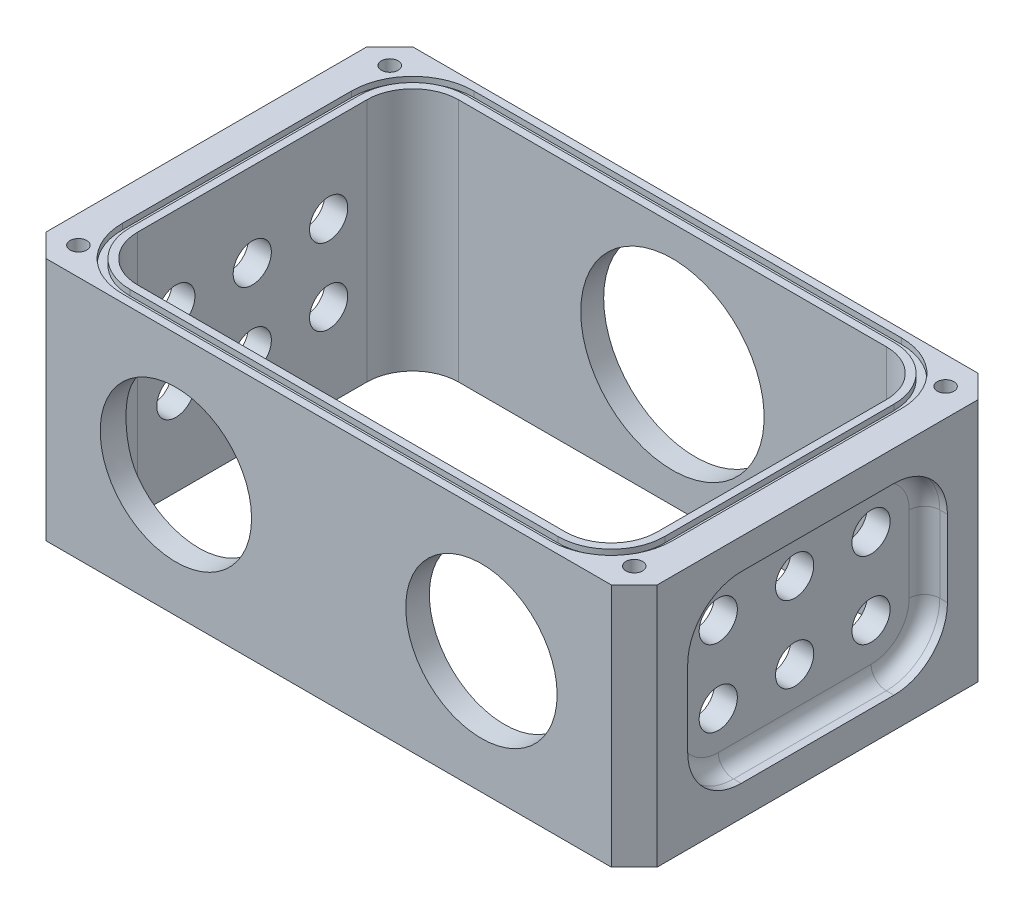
ISO-10303-21;
HEADER;
FILE_DESCRIPTION(('STEP AP214'),'2;1');
FILE_NAME('part.step','',(''),(''),'','','');
FILE_SCHEMA(('AUTOMOTIVE_DESIGN { 1 0 10303 214 1 1 1 1 }'));
ENDSEC;
DATA;
#1=APPLICATION_CONTEXT('core data for automotive mechanical design processes');
#2=APPLICATION_PROTOCOL_DEFINITION('international standard','automotive_design',2000,#1);
#3=PRODUCT_CONTEXT('',#1,'mechanical');
#4=PRODUCT('Part','Part','',(#3));
#5=PRODUCT_RELATED_PRODUCT_CATEGORY('part','',(#4));
#6=PRODUCT_DEFINITION_FORMATION('','',#4);
#7=PRODUCT_DEFINITION_CONTEXT('part definition',#1,'design');
#8=PRODUCT_DEFINITION('design','',#6,#7);
#9=PRODUCT_DEFINITION_SHAPE('','',#8);
#10=(LENGTH_UNIT() NAMED_UNIT(*) SI_UNIT(.MILLI.,.METRE.));
#11=(NAMED_UNIT(*) PLANE_ANGLE_UNIT() SI_UNIT($,.RADIAN.));
#12=(NAMED_UNIT(*) SI_UNIT($,.STERADIAN.) SOLID_ANGLE_UNIT());
#13=UNCERTAINTY_MEASURE_WITH_UNIT(LENGTH_MEASURE(1.E-05),#10,'distance_accuracy_value','');
#14=(GEOMETRIC_REPRESENTATION_CONTEXT(3) GLOBAL_UNCERTAINTY_ASSIGNED_CONTEXT((#13)) GLOBAL_UNIT_ASSIGNED_CONTEXT((#10,
#11,#12)) REPRESENTATION_CONTEXT('',''));
#15=CARTESIAN_POINT('',(0.,0.,0.));
#16=DIRECTION('',(0.,0.,1.));
#17=DIRECTION('',(1.,0.,0.));
#18=AXIS2_PLACEMENT_3D('',#15,#16,#17);
#19=CARTESIAN_POINT('',(0.,-25.4,0.));
#20=DIRECTION('',(0.,-1.,0.));
#21=DIRECTION('',(0.,0.,-1.));
#22=AXIS2_PLACEMENT_3D('',#19,#20,#21);
#23=PLANE('',#22);
#24=CARTESIAN_POINT('',(57.7511539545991,-25.4,32.3511539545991));
#25=DIRECTION('',(0.,-1.,0.));
#26=DIRECTION('',(0.,0.,-1.));
#27=AXIS2_PLACEMENT_3D('',#24,#25,#26);
#28=CIRCLE('',#27,1.72719999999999);
#29=CARTESIAN_POINT('',(57.7511539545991,-25.4,30.6239539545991));
#30=VERTEX_POINT('',#29);
#31=EDGE_CURVE('E805',#30,#30,#28,.T.);
#32=ORIENTED_EDGE('',*,*,#31,.F.);
#33=EDGE_LOOP('',(#32));
#34=FACE_BOUND('',#33,.T.);
#35=CARTESIAN_POINT('',(57.7511539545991,-25.4,-32.3511539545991));
#36=DIRECTION('',(0.,-1.,0.));
#37=DIRECTION('',(0.,0.,-1.));
#38=AXIS2_PLACEMENT_3D('',#35,#36,#37);
#39=CIRCLE('',#38,1.72719999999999);
#40=CARTESIAN_POINT('',(57.7511539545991,-25.4,-34.078353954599));
#41=VERTEX_POINT('',#40);
#42=EDGE_CURVE('E811',#41,#41,#39,.T.);
#43=ORIENTED_EDGE('',*,*,#42,.F.);
#44=EDGE_LOOP('',(#43));
#45=FACE_BOUND('',#44,.T.);
#46=CARTESIAN_POINT('',(-57.7511539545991,-25.4,-32.3511539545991));
#47=DIRECTION('',(0.,-1.,0.));
#48=DIRECTION('',(0.,0.,-1.));
#49=AXIS2_PLACEMENT_3D('',#46,#47,#48);
#50=CIRCLE('',#49,1.72719999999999);
#51=CARTESIAN_POINT('',(-57.7511539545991,-25.4,-34.078353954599));
#52=VERTEX_POINT('',#51);
#53=EDGE_CURVE('E817',#52,#52,#50,.T.);
#54=ORIENTED_EDGE('',*,*,#53,.F.);
#55=EDGE_LOOP('',(#54));
#56=FACE_BOUND('',#55,.T.);
#57=CARTESIAN_POINT('',(-57.7511539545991,-25.4,32.3511539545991));
#58=DIRECTION('',(0.,-1.,0.));
#59=DIRECTION('',(0.,0.,-1.));
#60=AXIS2_PLACEMENT_3D('',#57,#58,#59);
#61=CIRCLE('',#60,1.72719999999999);
#62=CARTESIAN_POINT('',(-57.7511539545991,-25.4,30.6239539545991));
#63=VERTEX_POINT('',#62);
#64=EDGE_CURVE('E823',#63,#63,#61,.T.);
#65=ORIENTED_EDGE('',*,*,#64,.F.);
#66=EDGE_LOOP('',(#65));
#67=FACE_BOUND('',#66,.T.);
#68=DIRECTION('',(-1.,0.,0.));
#69=VECTOR('',#68,1.);
#70=CARTESIAN_POINT('',(-63.5,-25.4,-38.1));
#71=LINE('',#70,#69);
#72=CARTESIAN_POINT('',(58.7375,-25.4,-38.1));
#73=VERTEX_POINT('',#72);
#74=CARTESIAN_POINT('',(-58.7375,-25.4,-38.1));
#75=VERTEX_POINT('',#74);
#76=EDGE_CURVE('E1098',#73,#75,#71,.T.);
#77=ORIENTED_EDGE('',*,*,#76,.F.);
#78=DIRECTION('',(-0.707106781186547,0.,-0.707106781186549));
#79=VECTOR('',#78,1.);
#80=CARTESIAN_POINT('',(48.4187500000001,-25.4,-48.4187499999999));
#81=LINE('',#80,#79);
#82=CARTESIAN_POINT('',(63.5,-25.4,-33.3374999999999));
#83=VERTEX_POINT('',#82);
#84=EDGE_CURVE('E1116',#73,#83,#81,.F.);
#85=ORIENTED_EDGE('',*,*,#84,.T.);
#86=DIRECTION('',(0.,0.,-1.));
#87=VECTOR('',#86,1.);
#88=CARTESIAN_POINT('',(63.5,-25.4,38.1));
#89=LINE('',#88,#87);
#90=CARTESIAN_POINT('',(63.5,-25.4,33.3375));
#91=VERTEX_POINT('',#90);
#92=EDGE_CURVE('E1081',#91,#83,#89,.T.);
#93=ORIENTED_EDGE('',*,*,#92,.F.);
#94=DIRECTION('',(0.707106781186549,0.,-0.707106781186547));
#95=VECTOR('',#94,1.);
#96=CARTESIAN_POINT('',(48.4187499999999,-25.4,48.41875));
#97=LINE('',#96,#95);
#98=CARTESIAN_POINT('',(58.7375,-25.4,38.1));
#99=VERTEX_POINT('',#98);
#100=EDGE_CURVE('E1114',#91,#99,#97,.F.);
#101=ORIENTED_EDGE('',*,*,#100,.T.);
#102=DIRECTION('',(1.,0.,0.));
#103=VECTOR('',#102,1.);
#104=CARTESIAN_POINT('',(-63.5,-25.4,38.1));
#105=LINE('',#104,#103);
#106=CARTESIAN_POINT('',(-58.7375,-25.4,38.1));
#107=VERTEX_POINT('',#106);
#108=EDGE_CURVE('E1086',#107,#99,#105,.T.);
#109=ORIENTED_EDGE('',*,*,#108,.F.);
#110=DIRECTION('',(0.707106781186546,0.,0.707106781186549));
#111=VECTOR('',#110,1.);
#112=CARTESIAN_POINT('',(-48.4187500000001,-25.4,48.41875));
#113=LINE('',#112,#111);
#114=CARTESIAN_POINT('',(-63.5,-25.4,33.3375));
#115=VERTEX_POINT('',#114);
#116=EDGE_CURVE('E1110',#107,#115,#113,.F.);
#117=ORIENTED_EDGE('',*,*,#116,.T.);
#118=DIRECTION('',(0.,0.,1.));
#119=VECTOR('',#118,1.);
#120=CARTESIAN_POINT('',(-63.5,-25.4,38.1));
#121=LINE('',#120,#119);
#122=CARTESIAN_POINT('',(-63.5,-25.4,-33.3375));
#123=VERTEX_POINT('',#122);
#124=EDGE_CURVE('E1101',#123,#115,#121,.T.);
#125=ORIENTED_EDGE('',*,*,#124,.F.);
#126=DIRECTION('',(-0.707106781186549,0.,0.707106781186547));
#127=VECTOR('',#126,1.);
#128=CARTESIAN_POINT('',(-48.4187499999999,-25.4,-48.4187500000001));
#129=LINE('',#128,#127);
#130=EDGE_CURVE('E1112',#123,#75,#129,.F.);
#131=ORIENTED_EDGE('',*,*,#130,.T.);
#132=EDGE_LOOP('',(#77,#85,#93,#101,#109,#117,#125,#131));
#133=FACE_BOUND('',#132,.T.);
#134=DIRECTION('',(-1.,0.,0.));
#135=VECTOR('',#134,1.);
#136=CARTESIAN_POINT('',(44.45,-25.4,-36.5125));
#137=LINE('',#136,#135);
#138=CARTESIAN_POINT('',(44.45,-25.4,-36.5125));
#139=VERTEX_POINT('',#138);
#140=CARTESIAN_POINT('',(-44.45,-25.4,-36.5125));
#141=VERTEX_POINT('',#140);
#142=EDGE_CURVE('E627',#139,#141,#137,.T.);
#143=ORIENTED_EDGE('',*,*,#142,.T.);
#144=CARTESIAN_POINT('',(-44.45,-25.4,-23.8125));
#145=DIRECTION('',(0.,1.,0.));
#146=DIRECTION('',(0.,0.,1.));
#147=AXIS2_PLACEMENT_3D('',#144,#145,#146);
#148=CIRCLE('',#147,12.7);
#149=CARTESIAN_POINT('',(-57.15,-25.4,-23.8125));
#150=VERTEX_POINT('',#149);
#151=EDGE_CURVE('E57',#141,#150,#148,.T.);
#152=ORIENTED_EDGE('',*,*,#151,.T.);
#153=DIRECTION('',(0.,0.,1.));
#154=VECTOR('',#153,1.);
#155=CARTESIAN_POINT('',(-57.15,-25.4,-23.8125));
#156=LINE('',#155,#154);
#157=CARTESIAN_POINT('',(-57.15,-25.4,23.8125));
#158=VERTEX_POINT('',#157);
#159=EDGE_CURVE('E611',#150,#158,#156,.T.);
#160=ORIENTED_EDGE('',*,*,#159,.T.);
#161=CARTESIAN_POINT('',(-44.45,-25.4,23.8125));
#162=DIRECTION('',(0.,1.,0.));
#163=DIRECTION('',(0.,0.,1.));
#164=AXIS2_PLACEMENT_3D('',#161,#162,#163);
#165=CIRCLE('',#164,12.7);
#166=CARTESIAN_POINT('',(-44.45,-25.4,36.5125));
#167=VERTEX_POINT('',#166);
#168=EDGE_CURVE('E642',#158,#167,#165,.T.);
#169=ORIENTED_EDGE('',*,*,#168,.T.);
#170=DIRECTION('',(1.,0.,0.));
#171=VECTOR('',#170,1.);
#172=CARTESIAN_POINT('',(-44.45,-25.4,36.5125));
#173=LINE('',#172,#171);
#174=CARTESIAN_POINT('',(44.45,-25.4,36.5125));
#175=VERTEX_POINT('',#174);
#176=EDGE_CURVE('E639',#167,#175,#173,.T.);
#177=ORIENTED_EDGE('',*,*,#176,.T.);
#178=CARTESIAN_POINT('',(44.45,-25.4,23.8125));
#179=DIRECTION('',(0.,1.,0.));
#180=DIRECTION('',(0.,0.,1.));
#181=AXIS2_PLACEMENT_3D('',#178,#179,#180);
#182=CIRCLE('',#181,12.7);
#183=CARTESIAN_POINT('',(57.15,-25.4,23.8125));
#184=VERTEX_POINT('',#183);
#185=EDGE_CURVE('E636',#175,#184,#182,.T.);
#186=ORIENTED_EDGE('',*,*,#185,.T.);
#187=DIRECTION('',(0.,0.,-1.));
#188=VECTOR('',#187,1.);
#189=CARTESIAN_POINT('',(57.15,-25.4,23.8125));
#190=LINE('',#189,#188);
#191=CARTESIAN_POINT('',(57.15,-25.4,-23.8125));
#192=VERTEX_POINT('',#191);
#193=EDGE_CURVE('E633',#184,#192,#190,.T.);
#194=ORIENTED_EDGE('',*,*,#193,.T.);
#195=CARTESIAN_POINT('',(44.45,-25.4,-23.8125));
#196=DIRECTION('',(0.,1.,0.));
#197=DIRECTION('',(0.,0.,1.));
#198=AXIS2_PLACEMENT_3D('',#195,#196,#197);
#199=CIRCLE('',#198,12.7);
#200=EDGE_CURVE('E630',#192,#139,#199,.T.);
#201=ORIENTED_EDGE('',*,*,#200,.T.);
#202=EDGE_LOOP('',(#143,#152,#160,#169,#177,#186,#194,#201));
#203=FACE_BOUND('',#202,.T.);
#204=ADVANCED_FACE('F40',(#34,#45,#56,#67,#133,#203),#23,.T.);
#205=CARTESIAN_POINT('',(0.,25.4,0.));
#206=DIRECTION('',(0.,-1.,0.));
#207=DIRECTION('',(0.,0.,-1.));
#208=AXIS2_PLACEMENT_3D('',#205,#206,#207);
#209=PLANE('',#208);
#210=CARTESIAN_POINT('',(-44.45,25.4,-23.8125));
#211=DIRECTION('',(0.,1.,0.));
#212=DIRECTION('',(0.,0.,1.));
#213=AXIS2_PLACEMENT_3D('',#210,#211,#212);
#214=CIRCLE('',#213,9.525);
#215=CARTESIAN_POINT('',(-44.45,25.4,-33.3375));
#216=VERTEX_POINT('',#215);
#217=CARTESIAN_POINT('',(-53.975,25.4,-23.8125));
#218=VERTEX_POINT('',#217);
#219=EDGE_CURVE('E1053',#216,#218,#214,.T.);
#220=ORIENTED_EDGE('',*,*,#219,.F.);
#221=DIRECTION('',(-1.,0.,0.));
#222=VECTOR('',#221,1.);
#223=CARTESIAN_POINT('',(44.45,25.4,-33.3375));
#224=LINE('',#223,#222);
#225=CARTESIAN_POINT('',(44.45,25.4,-33.3375));
#226=VERTEX_POINT('',#225);
#227=EDGE_CURVE('E1056',#226,#216,#224,.T.);
#228=ORIENTED_EDGE('',*,*,#227,.F.);
#229=CARTESIAN_POINT('',(44.45,25.4,-23.8125));
#230=DIRECTION('',(0.,1.,0.));
#231=DIRECTION('',(0.,0.,1.));
#232=AXIS2_PLACEMENT_3D('',#229,#230,#231);
#233=CIRCLE('',#232,9.525);
#234=CARTESIAN_POINT('',(53.975,25.4,-23.8125));
#235=VERTEX_POINT('',#234);
#236=EDGE_CURVE('E1024',#235,#226,#233,.T.);
#237=ORIENTED_EDGE('',*,*,#236,.F.);
#238=DIRECTION('',(0.,0.,-1.));
#239=VECTOR('',#238,1.);
#240=CARTESIAN_POINT('',(53.975,25.4,23.8125));
#241=LINE('',#240,#239);
#242=CARTESIAN_POINT('',(53.975,25.4,23.8125));
#243=VERTEX_POINT('',#242);
#244=EDGE_CURVE('E1038',#243,#235,#241,.T.);
#245=ORIENTED_EDGE('',*,*,#244,.F.);
#246=CARTESIAN_POINT('',(44.45,25.4,23.8125));
#247=DIRECTION('',(0.,1.,0.));
#248=DIRECTION('',(0.,0.,-1.));
#249=AXIS2_PLACEMENT_3D('',#246,#247,#248);
#250=CIRCLE('',#249,9.525);
#251=CARTESIAN_POINT('',(44.45,25.4,33.3375));
#252=VERTEX_POINT('',#251);
#253=EDGE_CURVE('E1041',#252,#243,#250,.T.);
#254=ORIENTED_EDGE('',*,*,#253,.F.);
#255=DIRECTION('',(1.,0.,0.));
#256=VECTOR('',#255,1.);
#257=CARTESIAN_POINT('',(-44.45,25.4,33.3375));
#258=LINE('',#257,#256);
#259=CARTESIAN_POINT('',(-44.45,25.4,33.3375));
#260=VERTEX_POINT('',#259);
#261=EDGE_CURVE('E1044',#260,#252,#258,.T.);
#262=ORIENTED_EDGE('',*,*,#261,.F.);
#263=CARTESIAN_POINT('',(-44.45,25.4,23.8125));
#264=DIRECTION('',(0.,1.,0.));
#265=DIRECTION('',(0.,0.,1.));
#266=AXIS2_PLACEMENT_3D('',#263,#264,#265);
#267=CIRCLE('',#266,9.525);
#268=CARTESIAN_POINT('',(-53.975,25.4,23.8125));
#269=VERTEX_POINT('',#268);
#270=EDGE_CURVE('E1047',#269,#260,#267,.T.);
#271=ORIENTED_EDGE('',*,*,#270,.F.);
#272=DIRECTION('',(0.,0.,1.));
#273=VECTOR('',#272,1.);
#274=CARTESIAN_POINT('',(-53.975,25.4,-23.8125));
#275=LINE('',#274,#273);
#276=EDGE_CURVE('E1050',#218,#269,#275,.T.);
#277=ORIENTED_EDGE('',*,*,#276,.F.);
#278=EDGE_LOOP('',(#220,#228,#237,#245,#254,#262,#271,#277));
#279=FACE_BOUND('',#278,.T.);
#280=CARTESIAN_POINT('',(-44.45,25.4,-23.8125));
#281=DIRECTION('',(0.,1.,0.));
#282=DIRECTION('',(0.,0.,1.));
#283=AXIS2_PLACEMENT_3D('',#280,#281,#282);
#284=CIRCLE('',#283,11.1125);
#285=CARTESIAN_POINT('',(-44.45,25.4,-34.925));
#286=VERTEX_POINT('',#285);
#287=CARTESIAN_POINT('',(-55.5625,25.4,-23.8125));
#288=VERTEX_POINT('',#287);
#289=EDGE_CURVE('E649',#286,#288,#284,.T.);
#290=ORIENTED_EDGE('',*,*,#289,.T.);
#291=DIRECTION('',(0.,0.,1.));
#292=VECTOR('',#291,1.);
#293=CARTESIAN_POINT('',(-55.5625,25.4,-23.8125));
#294=LINE('',#293,#292);
#295=CARTESIAN_POINT('',(-55.5625,25.4,23.8125));
#296=VERTEX_POINT('',#295);
#297=EDGE_CURVE('E691',#288,#296,#294,.T.);
#298=ORIENTED_EDGE('',*,*,#297,.T.);
#299=CARTESIAN_POINT('',(-44.45,25.4,23.8125));
#300=DIRECTION('',(0.,1.,0.));
#301=DIRECTION('',(0.,0.,1.));
#302=AXIS2_PLACEMENT_3D('',#299,#300,#301);
#303=CIRCLE('',#302,11.1125);
#304=CARTESIAN_POINT('',(-44.45,25.4,34.925));
#305=VERTEX_POINT('',#304);
#306=EDGE_CURVE('E694',#296,#305,#303,.T.);
#307=ORIENTED_EDGE('',*,*,#306,.T.);
#308=DIRECTION('',(1.,0.,0.));
#309=VECTOR('',#308,1.);
#310=CARTESIAN_POINT('',(-44.45,25.4,34.925));
#311=LINE('',#310,#309);
#312=CARTESIAN_POINT('',(44.45,25.4,34.925));
#313=VERTEX_POINT('',#312);
#314=EDGE_CURVE('E697',#305,#313,#311,.T.);
#315=ORIENTED_EDGE('',*,*,#314,.T.);
#316=CARTESIAN_POINT('',(44.45,25.4,23.8125));
#317=DIRECTION('',(0.,1.,0.));
#318=DIRECTION('',(0.,0.,1.));
#319=AXIS2_PLACEMENT_3D('',#316,#317,#318);
#320=CIRCLE('',#319,11.1125);
#321=CARTESIAN_POINT('',(55.5625,25.4,23.8125));
#322=VERTEX_POINT('',#321);
#323=EDGE_CURVE('E700',#313,#322,#320,.T.);
#324=ORIENTED_EDGE('',*,*,#323,.T.);
#325=DIRECTION('',(0.,0.,-1.));
#326=VECTOR('',#325,1.);
#327=CARTESIAN_POINT('',(55.5625,25.4,23.8125));
#328=LINE('',#327,#326);
#329=CARTESIAN_POINT('',(55.5625,25.4,-23.8125));
#330=VERTEX_POINT('',#329);
#331=EDGE_CURVE('E703',#322,#330,#328,.T.);
#332=ORIENTED_EDGE('',*,*,#331,.T.);
#333=CARTESIAN_POINT('',(44.45,25.4,-23.8125));
#334=DIRECTION('',(0.,1.,0.));
#335=DIRECTION('',(0.,0.,1.));
#336=AXIS2_PLACEMENT_3D('',#333,#334,#335);
#337=CIRCLE('',#336,11.1125);
#338=CARTESIAN_POINT('',(44.45,25.4,-34.925));
#339=VERTEX_POINT('',#338);
#340=EDGE_CURVE('E706',#330,#339,#337,.T.);
#341=ORIENTED_EDGE('',*,*,#340,.T.);
#342=DIRECTION('',(-1.,0.,0.));
#343=VECTOR('',#342,1.);
#344=CARTESIAN_POINT('',(44.45,25.4,-34.925));
#345=LINE('',#344,#343);
#346=EDGE_CURVE('E667',#339,#286,#345,.T.);
#347=ORIENTED_EDGE('',*,*,#346,.T.);
#348=EDGE_LOOP('',(#290,#298,#307,#315,#324,#332,#341,#347));
#349=FACE_BOUND('',#348,.T.);
#350=ADVANCED_FACE('F1260',(#279,#349),#209,.F.);
#351=CARTESIAN_POINT('',(-63.5,25.4,-38.1));
#352=DIRECTION('',(0.,0.,1.));
#353=DIRECTION('',(1.,0.,0.));
#354=AXIS2_PLACEMENT_3D('',#351,#352,#353);
#355=PLANE('',#354);
#356=CARTESIAN_POINT('',(0.,0.,-38.1));
#357=DIRECTION('',(0.,0.,1.));
#358=DIRECTION('',(1.,0.,0.));
#359=AXIS2_PLACEMENT_3D('',#356,#357,#358);
#360=CIRCLE('',#359,22.0853);
#361=CARTESIAN_POINT('',(22.0853,0.,-38.1));
#362=VERTEX_POINT('',#361);
#363=EDGE_CURVE('E799',#362,#362,#360,.T.);
#364=ORIENTED_EDGE('',*,*,#363,.F.);
#365=EDGE_LOOP('',(#364));
#366=FACE_BOUND('',#365,.T.);
#367=CARTESIAN_POINT('',(0.,0.,-38.1));
#368=DIRECTION('',(0.,0.,-1.));
#369=DIRECTION('',(-1.,0.,0.));
#370=AXIS2_PLACEMENT_3D('',#367,#368,#369);
#371=CIRCLE('',#370,19.05);
#372=CARTESIAN_POINT('',(-19.05,0.,-38.1));
#373=VERTEX_POINT('',#372);
#374=EDGE_CURVE('E916',#373,#373,#371,.T.);
#375=ORIENTED_EDGE('',*,*,#374,.F.);
#376=EDGE_LOOP('',(#375));
#377=FACE_BOUND('',#376,.T.);
#378=ADVANCED_FACE('F1266',(#366,#377),#355,.F.);
#379=CARTESIAN_POINT('',(63.5,25.4,38.1));
#380=DIRECTION('',(-1.,0.,0.));
#381=DIRECTION('',(0.,0.,1.));
#382=AXIS2_PLACEMENT_3D('',#379,#380,#381);
#383=PLANE('',#382);
#384=DIRECTION('',(0.,1.,0.));
#385=VECTOR('',#384,1.);
#386=CARTESIAN_POINT('',(63.5,-7.93749999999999,26.9875));
#387=LINE('',#386,#385);
#388=CARTESIAN_POINT('',(63.5,-7.93749999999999,26.9875));
#389=VERTEX_POINT('',#388);
#390=CARTESIAN_POINT('',(63.5,7.9375,26.9875));
#391=VERTEX_POINT('',#390);
#392=EDGE_CURVE('E989',#389,#391,#387,.T.);
#393=ORIENTED_EDGE('',*,*,#392,.T.);
#394=CARTESIAN_POINT('',(63.5,7.9375,15.875));
#395=DIRECTION('',(-1.,0.,0.));
#396=DIRECTION('',(0.,0.,-1.));
#397=AXIS2_PLACEMENT_3D('',#394,#395,#396);
#398=CIRCLE('',#397,11.1125);
#399=CARTESIAN_POINT('',(63.5,19.05,15.875));
#400=VERTEX_POINT('',#399);
#401=EDGE_CURVE('E994',#391,#400,#398,.T.);
#402=ORIENTED_EDGE('',*,*,#401,.T.);
#403=DIRECTION('',(0.,0.,-1.));
#404=VECTOR('',#403,1.);
#405=CARTESIAN_POINT('',(63.5,19.05,-15.875));
#406=LINE('',#405,#404);
#407=CARTESIAN_POINT('',(63.5,19.05,-15.875));
#408=VERTEX_POINT('',#407);
#409=EDGE_CURVE('E957',#400,#408,#406,.T.);
#410=ORIENTED_EDGE('',*,*,#409,.T.);
#411=CARTESIAN_POINT('',(63.5,7.9375,-15.875));
#412=DIRECTION('',(-1.,0.,0.));
#413=DIRECTION('',(0.,0.,-1.));
#414=AXIS2_PLACEMENT_3D('',#411,#412,#413);
#415=CIRCLE('',#414,11.1125);
#416=CARTESIAN_POINT('',(63.5,7.9375,-26.9875));
#417=VERTEX_POINT('',#416);
#418=EDGE_CURVE('E964',#408,#417,#415,.T.);
#419=ORIENTED_EDGE('',*,*,#418,.T.);
#420=DIRECTION('',(0.,-1.,0.));
#421=VECTOR('',#420,1.);
#422=CARTESIAN_POINT('',(63.5,-7.93749999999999,-26.9875));
#423=LINE('',#422,#421);
#424=CARTESIAN_POINT('',(63.5,-7.93749999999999,-26.9875));
#425=VERTEX_POINT('',#424);
#426=EDGE_CURVE('E969',#417,#425,#423,.T.);
#427=ORIENTED_EDGE('',*,*,#426,.T.);
#428=CARTESIAN_POINT('',(63.5,-7.93749999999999,-15.875));
#429=DIRECTION('',(-1.,0.,0.));
#430=DIRECTION('',(0.,0.,-1.));
#431=AXIS2_PLACEMENT_3D('',#428,#429,#430);
#432=CIRCLE('',#431,11.1125);
#433=CARTESIAN_POINT('',(63.5,-19.05,-15.875));
#434=VERTEX_POINT('',#433);
#435=EDGE_CURVE('E974',#425,#434,#432,.T.);
#436=ORIENTED_EDGE('',*,*,#435,.T.);
#437=DIRECTION('',(0.,0.,1.));
#438=VECTOR('',#437,1.);
#439=CARTESIAN_POINT('',(63.5,-19.05,-15.875));
#440=LINE('',#439,#438);
#441=CARTESIAN_POINT('',(63.5,-19.05,15.875));
#442=VERTEX_POINT('',#441);
#443=EDGE_CURVE('E979',#434,#442,#440,.T.);
#444=ORIENTED_EDGE('',*,*,#443,.T.);
#445=CARTESIAN_POINT('',(63.5,-7.93749999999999,15.875));
#446=DIRECTION('',(-1.,0.,0.));
#447=DIRECTION('',(0.,0.,1.));
#448=AXIS2_PLACEMENT_3D('',#445,#446,#447);
#449=CIRCLE('',#448,11.1125);
#450=EDGE_CURVE('E984',#442,#389,#449,.T.);
#451=ORIENTED_EDGE('',*,*,#450,.T.);
#452=EDGE_LOOP('',(#393,#402,#410,#419,#427,#436,#444,#451));
#453=FACE_BOUND('',#452,.T.);
#454=ORIENTED_EDGE('',*,*,#92,.T.);
#455=DIRECTION('',(0.,1.,0.));
#456=VECTOR('',#455,1.);
#457=CARTESIAN_POINT('',(63.5,25.4,-33.3375));
#458=LINE('',#457,#456);
#459=CARTESIAN_POINT('',(63.5,25.4,-33.3374999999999));
#460=VERTEX_POINT('',#459);
#461=EDGE_CURVE('E1121',#83,#460,#458,.T.);
#462=ORIENTED_EDGE('',*,*,#461,.T.);
#463=DIRECTION('',(0.,0.,-1.));
#464=VECTOR('',#463,1.);
#465=CARTESIAN_POINT('',(63.5,25.4,38.1));
#466=LINE('',#465,#464);
#467=CARTESIAN_POINT('',(63.5,25.4,33.3375));
#468=VERTEX_POINT('',#467);
#469=EDGE_CURVE('E1082',#468,#460,#466,.T.);
#470=ORIENTED_EDGE('',*,*,#469,.F.);
#471=DIRECTION('',(0.,-1.,0.));
#472=VECTOR('',#471,1.);
#473=CARTESIAN_POINT('',(63.5,25.4,33.3375));
#474=LINE('',#473,#472);
#475=EDGE_CURVE('E1118',#468,#91,#474,.T.);
#476=ORIENTED_EDGE('',*,*,#475,.T.);
#477=EDGE_LOOP('',(#454,#462,#470,#476));
#478=FACE_BOUND('',#477,.T.);
#479=ADVANCED_FACE('F1557',(#453,#478),#383,.F.);
#480=CARTESIAN_POINT('',(0.,0.,-38.1));
#481=DIRECTION('',(0.,0.,1.));
#482=DIRECTION('',(1.,0.,0.));
#483=AXIS2_PLACEMENT_3D('',#480,#481,#482);
#484=CIRCLE('',#483,23.8633);
#485=CARTESIAN_POINT('',(23.8633,0.,-38.1));
#486=VERTEX_POINT('',#485);
#487=EDGE_CURVE('E795',#486,#486,#484,.T.);
#488=ORIENTED_EDGE('',*,*,#487,.T.);
#489=EDGE_LOOP('',(#488));
#490=FACE_BOUND('',#489,.T.);
#491=CARTESIAN_POINT('',(25.4,20.6375,-38.1));
#492=DIRECTION('',(0.,0.,-1.));
#493=DIRECTION('',(-1.,0.,0.));
#494=AXIS2_PLACEMENT_3D('',#491,#492,#493);
#495=CIRCLE('',#494,1.7272);
#496=CARTESIAN_POINT('',(23.6728,20.6375,-38.1));
#497=VERTEX_POINT('',#496);
#498=EDGE_CURVE('E853',#497,#497,#495,.T.);
#499=ORIENTED_EDGE('',*,*,#498,.F.);
#500=EDGE_LOOP('',(#499));
#501=FACE_BOUND('',#500,.T.);
#502=CARTESIAN_POINT('',(-25.4,20.6375,-38.1));
#503=DIRECTION('',(0.,0.,-1.));
#504=DIRECTION('',(-1.,0.,0.));
#505=AXIS2_PLACEMENT_3D('',#502,#503,#504);
#506=CIRCLE('',#505,1.7272);
#507=CARTESIAN_POINT('',(-27.1272,20.6375,-38.1));
#508=VERTEX_POINT('',#507);
#509=EDGE_CURVE('E859',#508,#508,#506,.T.);
#510=ORIENTED_EDGE('',*,*,#509,.F.);
#511=EDGE_LOOP('',(#510));
#512=FACE_BOUND('',#511,.T.);
#513=CARTESIAN_POINT('',(-25.4,-20.6375,-38.1));
#514=DIRECTION('',(0.,0.,-1.));
#515=DIRECTION('',(-1.,0.,0.));
#516=AXIS2_PLACEMENT_3D('',#513,#514,#515);
#517=CIRCLE('',#516,1.7272);
#518=CARTESIAN_POINT('',(-27.1272,-20.6375,-38.1));
#519=VERTEX_POINT('',#518);
#520=EDGE_CURVE('E865',#519,#519,#517,.T.);
#521=ORIENTED_EDGE('',*,*,#520,.F.);
#522=EDGE_LOOP('',(#521));
#523=FACE_BOUND('',#522,.T.);
#524=CARTESIAN_POINT('',(25.4,-20.6375,-38.1));
#525=DIRECTION('',(0.,0.,-1.));
#526=DIRECTION('',(-1.,0.,0.));
#527=AXIS2_PLACEMENT_3D('',#524,#525,#526);
#528=CIRCLE('',#527,1.7272);
#529=CARTESIAN_POINT('',(23.6728,-20.6375,-38.1));
#530=VERTEX_POINT('',#529);
#531=EDGE_CURVE('E871',#530,#530,#528,.T.);
#532=ORIENTED_EDGE('',*,*,#531,.F.);
#533=EDGE_LOOP('',(#532));
#534=FACE_BOUND('',#533,.T.);
#535=DIRECTION('',(-1.,0.,0.));
#536=VECTOR('',#535,1.);
#537=CARTESIAN_POINT('',(-63.5,25.4,-38.1));
#538=LINE('',#537,#536);
#539=CARTESIAN_POINT('',(58.7375,25.4,-38.1));
#540=VERTEX_POINT('',#539);
#541=CARTESIAN_POINT('',(-58.7375,25.4,-38.1));
#542=VERTEX_POINT('',#541);
#543=EDGE_CURVE('E1085',#540,#542,#538,.T.);
#544=ORIENTED_EDGE('',*,*,#543,.F.);
#545=DIRECTION('',(0.,-1.,0.));
#546=VECTOR('',#545,1.);
#547=CARTESIAN_POINT('',(58.7375,25.4,-38.1));
#548=LINE('',#547,#546);
#549=EDGE_CURVE('E1107',#540,#73,#548,.T.);
#550=ORIENTED_EDGE('',*,*,#549,.T.);
#551=ORIENTED_EDGE('',*,*,#76,.T.);
#552=DIRECTION('',(0.,1.,0.));
#553=VECTOR('',#552,1.);
#554=CARTESIAN_POINT('',(-58.7375,25.4,-38.1));
#555=LINE('',#554,#553);
#556=EDGE_CURVE('E1095',#75,#542,#555,.T.);
#557=ORIENTED_EDGE('',*,*,#556,.T.);
#558=EDGE_LOOP('',(#544,#550,#551,#557));
#559=FACE_BOUND('',#558,.T.);
#560=ADVANCED_FACE('F2367',(#490,#501,#512,#523,#534,#559),#355,.F.);
#561=CARTESIAN_POINT('',(-63.5,25.4,38.1));
#562=DIRECTION('',(1.,0.,0.));
#563=DIRECTION('',(0.,0.,-1.));
#564=AXIS2_PLACEMENT_3D('',#561,#562,#563);
#565=PLANE('',#564);
#566=DIRECTION('',(0.,0.,-1.));
#567=VECTOR('',#566,1.);
#568=CARTESIAN_POINT('',(-63.5,19.05,-15.875));
#569=LINE('',#568,#567);
#570=CARTESIAN_POINT('',(-63.5,19.05,15.875));
#571=VERTEX_POINT('',#570);
#572=CARTESIAN_POINT('',(-63.5,19.05,-15.875));
#573=VERTEX_POINT('',#572);
#574=EDGE_CURVE('E1000',#571,#573,#569,.T.);
#575=ORIENTED_EDGE('',*,*,#574,.F.);
#576=CARTESIAN_POINT('',(-63.5,7.9375,15.875));
#577=DIRECTION('',(-1.,0.,0.));
#578=DIRECTION('',(0.,0.,-1.));
#579=AXIS2_PLACEMENT_3D('',#576,#577,#578);
#580=CIRCLE('',#579,11.1125);
#581=CARTESIAN_POINT('',(-63.5,7.9375,26.9875));
#582=VERTEX_POINT('',#581);
#583=EDGE_CURVE('E997',#582,#571,#580,.T.);
#584=ORIENTED_EDGE('',*,*,#583,.F.);
#585=DIRECTION('',(0.,1.,0.));
#586=VECTOR('',#585,1.);
#587=CARTESIAN_POINT('',(-63.5,-7.93749999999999,26.9875));
#588=LINE('',#587,#586);
#589=CARTESIAN_POINT('',(-63.5,-7.93749999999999,26.9875));
#590=VERTEX_POINT('',#589);
#591=EDGE_CURVE('E1018',#590,#582,#588,.T.);
#592=ORIENTED_EDGE('',*,*,#591,.F.);
#593=CARTESIAN_POINT('',(-63.5,-7.93749999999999,15.875));
#594=DIRECTION('',(-1.,0.,0.));
#595=DIRECTION('',(0.,0.,1.));
#596=AXIS2_PLACEMENT_3D('',#593,#594,#595);
#597=CIRCLE('',#596,11.1125);
#598=CARTESIAN_POINT('',(-63.5,-19.05,15.875));
#599=VERTEX_POINT('',#598);
#600=EDGE_CURVE('E1015',#599,#590,#597,.T.);
#601=ORIENTED_EDGE('',*,*,#600,.F.);
#602=DIRECTION('',(0.,0.,1.));
#603=VECTOR('',#602,1.);
#604=CARTESIAN_POINT('',(-63.5,-19.05,-15.875));
#605=LINE('',#604,#603);
#606=CARTESIAN_POINT('',(-63.5,-19.05,-15.875));
#607=VERTEX_POINT('',#606);
#608=EDGE_CURVE('E1012',#607,#599,#605,.T.);
#609=ORIENTED_EDGE('',*,*,#608,.F.);
#610=CARTESIAN_POINT('',(-63.5,-7.93749999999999,-15.875));
#611=DIRECTION('',(-1.,0.,0.));
#612=DIRECTION('',(0.,0.,-1.));
#613=AXIS2_PLACEMENT_3D('',#610,#611,#612);
#614=CIRCLE('',#613,11.1125);
#615=CARTESIAN_POINT('',(-63.5,-7.93749999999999,-26.9875));
#616=VERTEX_POINT('',#615);
#617=EDGE_CURVE('E1009',#616,#607,#614,.T.);
#618=ORIENTED_EDGE('',*,*,#617,.F.);
#619=DIRECTION('',(0.,-1.,0.));
#620=VECTOR('',#619,1.);
#621=CARTESIAN_POINT('',(-63.5,-7.93749999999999,-26.9875));
#622=LINE('',#621,#620);
#623=CARTESIAN_POINT('',(-63.5,7.9375,-26.9875));
#624=VERTEX_POINT('',#623);
#625=EDGE_CURVE('E1006',#624,#616,#622,.T.);
#626=ORIENTED_EDGE('',*,*,#625,.F.);
#627=CARTESIAN_POINT('',(-63.5,7.9375,-15.875));
#628=DIRECTION('',(-1.,0.,0.));
#629=DIRECTION('',(0.,0.,-1.));
#630=AXIS2_PLACEMENT_3D('',#627,#628,#629);
#631=CIRCLE('',#630,11.1125);
#632=EDGE_CURVE('E1003',#573,#624,#631,.T.);
#633=ORIENTED_EDGE('',*,*,#632,.F.);
#634=EDGE_LOOP('',(#575,#584,#592,#601,#609,#618,#626,#633));
#635=FACE_BOUND('',#634,.T.);
#636=DIRECTION('',(0.,0.,1.));
#637=VECTOR('',#636,1.);
#638=CARTESIAN_POINT('',(-63.5,25.4,38.1));
#639=LINE('',#638,#637);
#640=CARTESIAN_POINT('',(-63.5,25.4,-33.3375));
#641=VERTEX_POINT('',#640);
#642=CARTESIAN_POINT('',(-63.5,25.4,33.3375));
#643=VERTEX_POINT('',#642);
#644=EDGE_CURVE('E1089',#641,#643,#639,.T.);
#645=ORIENTED_EDGE('',*,*,#644,.F.);
#646=DIRECTION('',(0.,-1.,0.));
#647=VECTOR('',#646,1.);
#648=CARTESIAN_POINT('',(-63.5,25.4,-33.3375));
#649=LINE('',#648,#647);
#650=EDGE_CURVE('E1138',#641,#123,#649,.T.);
#651=ORIENTED_EDGE('',*,*,#650,.T.);
#652=ORIENTED_EDGE('',*,*,#124,.T.);
#653=DIRECTION('',(0.,1.,0.));
#654=VECTOR('',#653,1.);
#655=CARTESIAN_POINT('',(-63.5,25.4,33.3375));
#656=LINE('',#655,#654);
#657=EDGE_CURVE('E1136',#115,#643,#656,.T.);
#658=ORIENTED_EDGE('',*,*,#657,.T.);
#659=EDGE_LOOP('',(#645,#651,#652,#658));
#660=FACE_BOUND('',#659,.T.);
#661=ADVANCED_FACE('F1452',(#635,#660),#565,.F.);
#662=CARTESIAN_POINT('',(-63.5,25.4,38.1));
#663=DIRECTION('',(0.,0.,-1.));
#664=DIRECTION('',(-1.,0.,0.));
#665=AXIS2_PLACEMENT_3D('',#662,#663,#664);
#666=PLANE('',#665);
#667=CARTESIAN_POINT('',(-31.75,0.,38.1));
#668=DIRECTION('',(0.,0.,1.));
#669=DIRECTION('',(1.,0.,0.));
#670=AXIS2_PLACEMENT_3D('',#667,#668,#669);
#671=CIRCLE('',#670,15.7299152);
#672=CARTESIAN_POINT('',(-16.0200848,0.,38.1));
#673=VERTEX_POINT('',#672);
#674=EDGE_CURVE('E921',#673,#673,#671,.T.);
#675=ORIENTED_EDGE('',*,*,#674,.F.);
#676=EDGE_LOOP('',(#675));
#677=FACE_BOUND('',#676,.T.);
#678=CARTESIAN_POINT('',(31.7499999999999,0.,38.1));
#679=DIRECTION('',(0.,0.,1.));
#680=DIRECTION('',(1.,0.,0.));
#681=AXIS2_PLACEMENT_3D('',#678,#679,#680);
#682=CIRCLE('',#681,15.7299152);
#683=CARTESIAN_POINT('',(47.4799151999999,0.,38.1));
#684=VERTEX_POINT('',#683);
#685=EDGE_CURVE('E927',#684,#684,#682,.T.);
#686=ORIENTED_EDGE('',*,*,#685,.F.);
#687=EDGE_LOOP('',(#686));
#688=FACE_BOUND('',#687,.T.);
#689=ORIENTED_EDGE('',*,*,#108,.T.);
#690=DIRECTION('',(0.,1.,0.));
#691=VECTOR('',#690,1.);
#692=CARTESIAN_POINT('',(58.7375,25.4,38.1));
#693=LINE('',#692,#691);
#694=CARTESIAN_POINT('',(58.7375,25.4,38.1));
#695=VERTEX_POINT('',#694);
#696=EDGE_CURVE('E1134',#99,#695,#693,.T.);
#697=ORIENTED_EDGE('',*,*,#696,.T.);
#698=DIRECTION('',(1.,0.,0.));
#699=VECTOR('',#698,1.);
#700=CARTESIAN_POINT('',(-63.5,25.4,38.1));
#701=LINE('',#700,#699);
#702=CARTESIAN_POINT('',(-58.7375,25.4,38.1));
#703=VERTEX_POINT('',#702);
#704=EDGE_CURVE('E1092',#703,#695,#701,.T.);
#705=ORIENTED_EDGE('',*,*,#704,.F.);
#706=DIRECTION('',(0.,-1.,0.));
#707=VECTOR('',#706,1.);
#708=CARTESIAN_POINT('',(-58.7375,25.4,38.1));
#709=LINE('',#708,#707);
#710=EDGE_CURVE('E1131',#703,#107,#709,.T.);
#711=ORIENTED_EDGE('',*,*,#710,.T.);
#712=EDGE_LOOP('',(#689,#697,#705,#711));
#713=FACE_BOUND('',#712,.T.);
#714=ADVANCED_FACE('F2759',(#677,#688,#713),#666,.F.);
#715=CARTESIAN_POINT('',(58.7375,25.4,-38.1));
#716=DIRECTION('',(-0.707106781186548,0.,0.707106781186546));
#717=DIRECTION('',(0.,-1.,0.));
#718=AXIS2_PLACEMENT_3D('',#715,#716,#717);
#719=PLANE('',#718);
#720=DIRECTION('',(0.707106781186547,0.,0.707106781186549));
#721=VECTOR('',#720,1.);
#722=CARTESIAN_POINT('',(58.7375,25.4,-38.1));
#723=LINE('',#722,#721);
#724=EDGE_CURVE('E1129',#460,#540,#723,.F.);
#725=ORIENTED_EDGE('',*,*,#724,.F.);
#726=ORIENTED_EDGE('',*,*,#461,.F.);
#727=ORIENTED_EDGE('',*,*,#84,.F.);
#728=ORIENTED_EDGE('',*,*,#549,.F.);
#729=EDGE_LOOP('',(#725,#726,#727,#728));
#730=FACE_BOUND('',#729,.T.);
#731=ADVANCED_FACE('F2764',(#730),#719,.F.);
#732=CARTESIAN_POINT('',(63.5,25.4,33.3375));
#733=DIRECTION('',(-0.707106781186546,0.,-0.707106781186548));
#734=DIRECTION('',(0.,-1.,0.));
#735=AXIS2_PLACEMENT_3D('',#732,#733,#734);
#736=PLANE('',#735);
#737=DIRECTION('',(-0.707106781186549,0.,0.707106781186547));
#738=VECTOR('',#737,1.);
#739=CARTESIAN_POINT('',(63.5,25.4,33.3375));
#740=LINE('',#739,#738);
#741=EDGE_CURVE('E1127',#695,#468,#740,.F.);
#742=ORIENTED_EDGE('',*,*,#741,.F.);
#743=ORIENTED_EDGE('',*,*,#696,.F.);
#744=ORIENTED_EDGE('',*,*,#100,.F.);
#745=ORIENTED_EDGE('',*,*,#475,.F.);
#746=EDGE_LOOP('',(#742,#743,#744,#745));
#747=FACE_BOUND('',#746,.T.);
#748=ADVANCED_FACE('F2779',(#747),#736,.F.);
#749=CARTESIAN_POINT('',(-63.5,25.4,-33.3375));
#750=DIRECTION('',(0.707106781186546,0.,0.707106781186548));
#751=DIRECTION('',(0.,-1.,0.));
#752=AXIS2_PLACEMENT_3D('',#749,#750,#751);
#753=PLANE('',#752);
#754=DIRECTION('',(0.707106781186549,0.,-0.707106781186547));
#755=VECTOR('',#754,1.);
#756=CARTESIAN_POINT('',(-63.5,25.4,-33.3375));
#757=LINE('',#756,#755);
#758=EDGE_CURVE('E1125',#542,#641,#757,.F.);
#759=ORIENTED_EDGE('',*,*,#758,.F.);
#760=ORIENTED_EDGE('',*,*,#556,.F.);
#761=ORIENTED_EDGE('',*,*,#130,.F.);
#762=ORIENTED_EDGE('',*,*,#650,.F.);
#763=EDGE_LOOP('',(#759,#760,#761,#762));
#764=FACE_BOUND('',#763,.T.);
#765=ADVANCED_FACE('F2786',(#764),#753,.F.);
#766=CARTESIAN_POINT('',(-58.7375,25.4,38.1));
#767=DIRECTION('',(0.707106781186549,0.,-0.707106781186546));
#768=DIRECTION('',(0.,-1.,0.));
#769=AXIS2_PLACEMENT_3D('',#766,#767,#768);
#770=PLANE('',#769);
#771=DIRECTION('',(-0.707106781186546,0.,-0.707106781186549));
#772=VECTOR('',#771,1.);
#773=CARTESIAN_POINT('',(-58.7375,25.4,38.1));
#774=LINE('',#773,#772);
#775=EDGE_CURVE('E1123',#643,#703,#774,.F.);
#776=ORIENTED_EDGE('',*,*,#775,.F.);
#777=ORIENTED_EDGE('',*,*,#657,.F.);
#778=ORIENTED_EDGE('',*,*,#116,.F.);
#779=ORIENTED_EDGE('',*,*,#710,.F.);
#780=EDGE_LOOP('',(#776,#777,#778,#779));
#781=FACE_BOUND('',#780,.T.);
#782=ADVANCED_FACE('F1243',(#781),#770,.F.);
#783=CARTESIAN_POINT('',(12.0924702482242,7.9375,15.875));
#784=DIRECTION('',(-1.,0.,0.));
#785=DIRECTION('',(0.,0.,1.));
#786=AXIS2_PLACEMENT_3D('',#783,#784,#785);
#787=CYLINDRICAL_SURFACE('',#786,11.1125);
#788=DIRECTION('',(-1.,0.,0.));
#789=VECTOR('',#788,1.);
#790=CARTESIAN_POINT('',(12.0924702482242,19.05,15.875));
#791=LINE('',#790,#789);
#792=CARTESIAN_POINT('',(-61.9125,19.05,15.875));
#793=VERTEX_POINT('',#792);
#794=EDGE_CURVE('E1021',#793,#571,#791,.T.);
#795=ORIENTED_EDGE('',*,*,#794,.F.);
#796=CARTESIAN_POINT('',(-61.9125,7.9375,15.875));
#797=DIRECTION('',(-1.,0.,0.));
#798=DIRECTION('',(0.,0.,1.));
#799=AXIS2_PLACEMENT_3D('',#796,#797,#798);
#800=CIRCLE('',#799,11.1125);
#801=CARTESIAN_POINT('',(-61.9125,7.9375,26.9875));
#802=VERTEX_POINT('',#801);
#803=EDGE_CURVE('E12',#793,#802,#800,.F.);
#804=ORIENTED_EDGE('',*,*,#803,.T.);
#805=DIRECTION('',(-1.,0.,0.));
#806=VECTOR('',#805,1.);
#807=CARTESIAN_POINT('',(12.0924702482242,7.9375,26.9875));
#808=LINE('',#807,#806);
#809=EDGE_CURVE('E1022',#802,#582,#808,.T.);
#810=ORIENTED_EDGE('',*,*,#809,.T.);
#811=ORIENTED_EDGE('',*,*,#583,.T.);
#812=EDGE_LOOP('',(#795,#804,#810,#811));
#813=FACE_BOUND('',#812,.T.);
#814=ADVANCED_FACE('F1217',(#813),#787,.F.);
#815=CARTESIAN_POINT('',(12.0924702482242,-7.93749999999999,26.9875));
#816=DIRECTION('',(0.,0.,1.));
#817=DIRECTION('',(1.,0.,0.));
#818=AXIS2_PLACEMENT_3D('',#815,#816,#817);
#819=PLANE('',#818);
#820=ORIENTED_EDGE('',*,*,#809,.F.);
#821=DIRECTION('',(0.,-1.,0.));
#822=VECTOR('',#821,1.);
#823=CARTESIAN_POINT('',(-61.9125,-7.93749999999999,26.9875));
#824=LINE('',#823,#822);
#825=CARTESIAN_POINT('',(-61.9125,-7.93749999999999,26.9875));
#826=VERTEX_POINT('',#825);
#827=EDGE_CURVE('E1377',#802,#826,#824,.T.);
#828=ORIENTED_EDGE('',*,*,#827,.T.);
#829=DIRECTION('',(-1.,0.,0.));
#830=VECTOR('',#829,1.);
#831=CARTESIAN_POINT('',(12.0924702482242,-7.93749999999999,26.9875));
#832=LINE('',#831,#830);
#833=EDGE_CURVE('E1025',#826,#590,#832,.T.);
#834=ORIENTED_EDGE('',*,*,#833,.T.);
#835=ORIENTED_EDGE('',*,*,#591,.T.);
#836=EDGE_LOOP('',(#820,#828,#834,#835));
#837=FACE_BOUND('',#836,.T.);
#838=ADVANCED_FACE('F1213',(#837),#819,.F.);
#839=CARTESIAN_POINT('',(12.0924702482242,-7.93749999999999,15.875));
#840=DIRECTION('',(-1.,0.,0.));
#841=DIRECTION('',(0.,0.,1.));
#842=AXIS2_PLACEMENT_3D('',#839,#840,#841);
#843=CYLINDRICAL_SURFACE('',#842,11.1125);
#844=ORIENTED_EDGE('',*,*,#833,.F.);
#845=CARTESIAN_POINT('',(-61.9125,-7.93749999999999,15.875));
#846=DIRECTION('',(-1.,0.,0.));
#847=DIRECTION('',(0.,0.,1.));
#848=AXIS2_PLACEMENT_3D('',#845,#846,#847);
#849=CIRCLE('',#848,11.1125);
#850=CARTESIAN_POINT('',(-61.9125,-19.05,15.875));
#851=VERTEX_POINT('',#850);
#852=EDGE_CURVE('E1375',#826,#851,#849,.F.);
#853=ORIENTED_EDGE('',*,*,#852,.T.);
#854=DIRECTION('',(-1.,0.,0.));
#855=VECTOR('',#854,1.);
#856=CARTESIAN_POINT('',(12.0924702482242,-19.05,15.875));
#857=LINE('',#856,#855);
#858=EDGE_CURVE('E1027',#851,#599,#857,.T.);
#859=ORIENTED_EDGE('',*,*,#858,.T.);
#860=ORIENTED_EDGE('',*,*,#600,.T.);
#861=EDGE_LOOP('',(#844,#853,#859,#860));
#862=FACE_BOUND('',#861,.T.);
#863=ADVANCED_FACE('F1216',(#862),#843,.F.);
#864=CARTESIAN_POINT('',(12.0924702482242,-19.05,-15.875));
#865=DIRECTION('',(0.,-1.,0.));
#866=DIRECTION('',(0.,0.,-1.));
#867=AXIS2_PLACEMENT_3D('',#864,#865,#866);
#868=PLANE('',#867);
#869=ORIENTED_EDGE('',*,*,#858,.F.);
#870=DIRECTION('',(0.,0.,-1.));
#871=VECTOR('',#870,1.);
#872=CARTESIAN_POINT('',(-61.9125,-19.05,-15.875));
#873=LINE('',#872,#871);
#874=CARTESIAN_POINT('',(-61.9125,-19.05,-15.875));
#875=VERTEX_POINT('',#874);
#876=EDGE_CURVE('E1373',#851,#875,#873,.T.);
#877=ORIENTED_EDGE('',*,*,#876,.T.);
#878=DIRECTION('',(-1.,0.,0.));
#879=VECTOR('',#878,1.);
#880=CARTESIAN_POINT('',(12.0924702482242,-19.05,-15.875));
#881=LINE('',#880,#879);
#882=EDGE_CURVE('E1029',#875,#607,#881,.T.);
#883=ORIENTED_EDGE('',*,*,#882,.T.);
#884=ORIENTED_EDGE('',*,*,#608,.T.);
#885=EDGE_LOOP('',(#869,#877,#883,#884));
#886=FACE_BOUND('',#885,.T.);
#887=ADVANCED_FACE('F1221',(#886),#868,.F.);
#888=CARTESIAN_POINT('',(12.0924702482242,-7.93749999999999,-15.875));
#889=DIRECTION('',(-1.,0.,0.));
#890=DIRECTION('',(0.,0.,1.));
#891=AXIS2_PLACEMENT_3D('',#888,#889,#890);
#892=CYLINDRICAL_SURFACE('',#891,11.1125);
#893=ORIENTED_EDGE('',*,*,#882,.F.);
#894=CARTESIAN_POINT('',(-61.9125,-7.93749999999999,-15.875));
#895=DIRECTION('',(-1.,0.,0.));
#896=DIRECTION('',(0.,0.,1.));
#897=AXIS2_PLACEMENT_3D('',#894,#895,#896);
#898=CIRCLE('',#897,11.1125);
#899=CARTESIAN_POINT('',(-61.9125,-7.93749999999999,-26.9875));
#900=VERTEX_POINT('',#899);
#901=EDGE_CURVE('E1371',#875,#900,#898,.F.);
#902=ORIENTED_EDGE('',*,*,#901,.T.);
#903=DIRECTION('',(-1.,0.,0.));
#904=VECTOR('',#903,1.);
#905=CARTESIAN_POINT('',(12.0924702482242,-7.93749999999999,-26.9875));
#906=LINE('',#905,#904);
#907=EDGE_CURVE('E1031',#900,#616,#906,.T.);
#908=ORIENTED_EDGE('',*,*,#907,.T.);
#909=ORIENTED_EDGE('',*,*,#617,.T.);
#910=EDGE_LOOP('',(#893,#902,#908,#909));
#911=FACE_BOUND('',#910,.T.);
#912=ADVANCED_FACE('F1225',(#911),#892,.F.);
#913=CARTESIAN_POINT('',(12.0924702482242,-7.93749999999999,-26.9875));
#914=DIRECTION('',(0.,0.,-1.));
#915=DIRECTION('',(-1.,0.,0.));
#916=AXIS2_PLACEMENT_3D('',#913,#914,#915);
#917=PLANE('',#916);
#918=ORIENTED_EDGE('',*,*,#907,.F.);
#919=DIRECTION('',(0.,1.,0.));
#920=VECTOR('',#919,1.);
#921=CARTESIAN_POINT('',(-61.9125,-7.93749999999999,-26.9875));
#922=LINE('',#921,#920);
#923=CARTESIAN_POINT('',(-61.9125,7.9375,-26.9875));
#924=VERTEX_POINT('',#923);
#925=EDGE_CURVE('E1369',#900,#924,#922,.T.);
#926=ORIENTED_EDGE('',*,*,#925,.T.);
#927=DIRECTION('',(-1.,0.,0.));
#928=VECTOR('',#927,1.);
#929=CARTESIAN_POINT('',(12.0924702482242,7.9375,-26.9875));
#930=LINE('',#929,#928);
#931=EDGE_CURVE('E1033',#924,#624,#930,.T.);
#932=ORIENTED_EDGE('',*,*,#931,.T.);
#933=ORIENTED_EDGE('',*,*,#625,.T.);
#934=EDGE_LOOP('',(#918,#926,#932,#933));
#935=FACE_BOUND('',#934,.T.);
#936=ADVANCED_FACE('F1229',(#935),#917,.F.);
#937=CARTESIAN_POINT('',(12.0924702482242,7.9375,-15.875));
#938=DIRECTION('',(-1.,0.,0.));
#939=DIRECTION('',(0.,0.,1.));
#940=AXIS2_PLACEMENT_3D('',#937,#938,#939);
#941=CYLINDRICAL_SURFACE('',#940,11.1125);
#942=ORIENTED_EDGE('',*,*,#931,.F.);
#943=CARTESIAN_POINT('',(-61.9125,7.9375,-15.875));
#944=DIRECTION('',(-1.,0.,0.));
#945=DIRECTION('',(0.,0.,1.));
#946=AXIS2_PLACEMENT_3D('',#943,#944,#945);
#947=CIRCLE('',#946,11.1125);
#948=CARTESIAN_POINT('',(-61.9125,19.05,-15.875));
#949=VERTEX_POINT('',#948);
#950=EDGE_CURVE('E1367',#924,#949,#947,.F.);
#951=ORIENTED_EDGE('',*,*,#950,.T.);
#952=DIRECTION('',(-1.,0.,0.));
#953=VECTOR('',#952,1.);
#954=CARTESIAN_POINT('',(12.0924702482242,19.05,-15.875));
#955=LINE('',#954,#953);
#956=EDGE_CURVE('E1035',#949,#573,#955,.T.);
#957=ORIENTED_EDGE('',*,*,#956,.T.);
#958=ORIENTED_EDGE('',*,*,#632,.T.);
#959=EDGE_LOOP('',(#942,#951,#957,#958));
#960=FACE_BOUND('',#959,.T.);
#961=ADVANCED_FACE('F1233',(#960),#941,.F.);
#962=CARTESIAN_POINT('',(12.0924702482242,19.05,-15.875));
#963=DIRECTION('',(0.,1.,0.));
#964=DIRECTION('',(0.,0.,1.));
#965=AXIS2_PLACEMENT_3D('',#962,#963,#964);
#966=PLANE('',#965);
#967=ORIENTED_EDGE('',*,*,#956,.F.);
#968=DIRECTION('',(0.,0.,1.));
#969=VECTOR('',#968,1.);
#970=CARTESIAN_POINT('',(-61.9125,19.05,-15.875));
#971=LINE('',#970,#969);
#972=EDGE_CURVE('E1347',#949,#793,#971,.T.);
#973=ORIENTED_EDGE('',*,*,#972,.T.);
#974=ORIENTED_EDGE('',*,*,#794,.T.);
#975=ORIENTED_EDGE('',*,*,#574,.T.);
#976=EDGE_LOOP('',(#967,#973,#974,#975));
#977=FACE_BOUND('',#976,.T.);
#978=ADVANCED_FACE('F1211',(#977),#966,.F.);
#979=CARTESIAN_POINT('',(-58.7375,-152.280881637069,-23.8125));
#980=DIRECTION('',(-1.,0.,0.));
#981=DIRECTION('',(0.,0.,1.));
#982=AXIS2_PLACEMENT_3D('',#979,#980,#981);
#983=PLANE('',#982);
#984=CARTESIAN_POINT('',(-58.7375,7.9375,15.875));
#985=DIRECTION('',(-1.,0.,0.));
#986=DIRECTION('',(0.,0.,1.));
#987=AXIS2_PLACEMENT_3D('',#984,#985,#986);
#988=CIRCLE('',#987,7.9375);
#989=CARTESIAN_POINT('',(-58.7375,7.9375,23.8125));
#990=VERTEX_POINT('',#989);
#991=CARTESIAN_POINT('',(-58.7375,15.875,15.875));
#992=VERTEX_POINT('',#991);
#993=EDGE_CURVE('E1350',#990,#992,#988,.T.);
#994=ORIENTED_EDGE('',*,*,#993,.T.);
#995=DIRECTION('',(0.,0.,1.));
#996=VECTOR('',#995,1.);
#997=CARTESIAN_POINT('',(-58.7375,15.875,-23.8125));
#998=LINE('',#997,#996);
#999=CARTESIAN_POINT('',(-58.7375,15.875,-15.875));
#1000=VERTEX_POINT('',#999);
#1001=EDGE_CURVE('E1364',#992,#1000,#998,.F.);
#1002=ORIENTED_EDGE('',*,*,#1001,.T.);
#1003=CARTESIAN_POINT('',(-58.7375,7.9375,-15.875));
#1004=DIRECTION('',(-1.,0.,0.));
#1005=DIRECTION('',(0.,0.,1.));
#1006=AXIS2_PLACEMENT_3D('',#1003,#1004,#1005);
#1007=CIRCLE('',#1006,7.9375);
#1008=CARTESIAN_POINT('',(-58.7375,7.9375,-23.8125));
#1009=VERTEX_POINT('',#1008);
#1010=EDGE_CURVE('E1362',#1000,#1009,#1007,.T.);
#1011=ORIENTED_EDGE('',*,*,#1010,.T.);
#1012=DIRECTION('',(0.,1.,0.));
#1013=VECTOR('',#1012,1.);
#1014=CARTESIAN_POINT('',(-58.7375,-152.280881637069,-23.8125));
#1015=LINE('',#1014,#1013);
#1016=CARTESIAN_POINT('',(-58.7375,-7.93749999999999,-23.8125));
#1017=VERTEX_POINT('',#1016);
#1018=EDGE_CURVE('E1360',#1009,#1017,#1015,.F.);
#1019=ORIENTED_EDGE('',*,*,#1018,.T.);
#1020=CARTESIAN_POINT('',(-58.7375,-7.93749999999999,-15.875));
#1021=DIRECTION('',(-1.,0.,0.));
#1022=DIRECTION('',(0.,0.,1.));
#1023=AXIS2_PLACEMENT_3D('',#1020,#1021,#1022);
#1024=CIRCLE('',#1023,7.9375);
#1025=CARTESIAN_POINT('',(-58.7375,-15.875,-15.875));
#1026=VERTEX_POINT('',#1025);
#1027=EDGE_CURVE('E1358',#1017,#1026,#1024,.T.);
#1028=ORIENTED_EDGE('',*,*,#1027,.T.);
#1029=DIRECTION('',(0.,0.,-1.));
#1030=VECTOR('',#1029,1.);
#1031=CARTESIAN_POINT('',(-58.7375,-15.875,-23.8125));
#1032=LINE('',#1031,#1030);
#1033=CARTESIAN_POINT('',(-58.7375,-15.875,15.875));
#1034=VERTEX_POINT('',#1033);
#1035=EDGE_CURVE('E1356',#1026,#1034,#1032,.F.);
#1036=ORIENTED_EDGE('',*,*,#1035,.T.);
#1037=CARTESIAN_POINT('',(-58.7375,-7.93749999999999,15.875));
#1038=DIRECTION('',(-1.,0.,0.));
#1039=DIRECTION('',(0.,0.,1.));
#1040=AXIS2_PLACEMENT_3D('',#1037,#1038,#1039);
#1041=CIRCLE('',#1040,7.9375);
#1042=CARTESIAN_POINT('',(-58.7375,-7.93749999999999,23.8125));
#1043=VERTEX_POINT('',#1042);
#1044=EDGE_CURVE('E1354',#1034,#1043,#1041,.T.);
#1045=ORIENTED_EDGE('',*,*,#1044,.T.);
#1046=DIRECTION('',(0.,-1.,0.));
#1047=VECTOR('',#1046,1.);
#1048=CARTESIAN_POINT('',(-58.7375,-152.280881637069,23.8125));
#1049=LINE('',#1048,#1047);
#1050=EDGE_CURVE('E1352',#1043,#990,#1049,.F.);
#1051=ORIENTED_EDGE('',*,*,#1050,.T.);
#1052=EDGE_LOOP('',(#994,#1002,#1011,#1019,#1028,#1036,#1045,#1051));
#1053=FACE_BOUND('',#1052,.T.);
#1054=CARTESIAN_POINT('',(-58.7375,-7.93749999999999,-15.875));
#1055=DIRECTION('',(-1.,0.,0.));
#1056=DIRECTION('',(0.,0.,1.));
#1057=AXIS2_PLACEMENT_3D('',#1054,#1055,#1056);
#1058=CIRCLE('',#1057,3.96875);
#1059=CARTESIAN_POINT('',(-58.7375,-7.93749999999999,-11.90625));
#1060=VERTEX_POINT('',#1059);
#1061=EDGE_CURVE('E909',#1060,#1060,#1058,.T.);
#1062=ORIENTED_EDGE('',*,*,#1061,.F.);
#1063=EDGE_LOOP('',(#1062));
#1064=FACE_BOUND('',#1063,.T.);
#1065=CARTESIAN_POINT('',(-58.7375,-7.93749999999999,0.));
#1066=DIRECTION('',(-1.,0.,0.));
#1067=DIRECTION('',(0.,0.,1.));
#1068=AXIS2_PLACEMENT_3D('',#1065,#1066,#1067);
#1069=CIRCLE('',#1068,3.96875);
#1070=CARTESIAN_POINT('',(-58.7375,-7.93749999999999,3.96875));
#1071=VERTEX_POINT('',#1070);
#1072=EDGE_CURVE('E906',#1071,#1071,#1069,.T.);
#1073=ORIENTED_EDGE('',*,*,#1072,.F.);
#1074=EDGE_LOOP('',(#1073));
#1075=FACE_BOUND('',#1074,.T.);
#1076=CARTESIAN_POINT('',(-58.7375,-7.93749999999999,15.875));
#1077=DIRECTION('',(-1.,0.,0.));
#1078=DIRECTION('',(0.,0.,1.));
#1079=AXIS2_PLACEMENT_3D('',#1076,#1077,#1078);
#1080=CIRCLE('',#1079,3.96875);
#1081=CARTESIAN_POINT('',(-58.7375,-7.93749999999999,19.84375));
#1082=VERTEX_POINT('',#1081);
#1083=EDGE_CURVE('E903',#1082,#1082,#1080,.T.);
#1084=ORIENTED_EDGE('',*,*,#1083,.F.);
#1085=EDGE_LOOP('',(#1084));
#1086=FACE_BOUND('',#1085,.T.);
#1087=CARTESIAN_POINT('',(-58.7375,7.9375,15.875));
#1088=DIRECTION('',(-1.,0.,0.));
#1089=DIRECTION('',(0.,0.,1.));
#1090=AXIS2_PLACEMENT_3D('',#1087,#1088,#1089);
#1091=CIRCLE('',#1090,3.96875);
#1092=CARTESIAN_POINT('',(-58.7375,7.9375,19.84375));
#1093=VERTEX_POINT('',#1092);
#1094=EDGE_CURVE('E900',#1093,#1093,#1091,.T.);
#1095=ORIENTED_EDGE('',*,*,#1094,.F.);
#1096=EDGE_LOOP('',(#1095));
#1097=FACE_BOUND('',#1096,.T.);
#1098=CARTESIAN_POINT('',(-58.7375,7.9375,0.));
#1099=DIRECTION('',(-1.,0.,0.));
#1100=DIRECTION('',(0.,0.,1.));
#1101=AXIS2_PLACEMENT_3D('',#1098,#1099,#1100);
#1102=CIRCLE('',#1101,3.96875);
#1103=CARTESIAN_POINT('',(-58.7375,7.9375,3.96875));
#1104=VERTEX_POINT('',#1103);
#1105=EDGE_CURVE('E896',#1104,#1104,#1102,.T.);
#1106=ORIENTED_EDGE('',*,*,#1105,.F.);
#1107=EDGE_LOOP('',(#1106));
#1108=FACE_BOUND('',#1107,.T.);
#1109=CARTESIAN_POINT('',(-58.7375,7.9375,-15.875));
#1110=DIRECTION('',(-1.,0.,0.));
#1111=DIRECTION('',(0.,0.,1.));
#1112=AXIS2_PLACEMENT_3D('',#1109,#1110,#1111);
#1113=CIRCLE('',#1112,3.96875);
#1114=CARTESIAN_POINT('',(-58.7375,7.9375,-11.90625));
#1115=VERTEX_POINT('',#1114);
#1116=EDGE_CURVE('E899',#1115,#1115,#1113,.T.);
#1117=ORIENTED_EDGE('',*,*,#1116,.F.);
#1118=EDGE_LOOP('',(#1117));
#1119=FACE_BOUND('',#1118,.T.);
#1120=ADVANCED_FACE('F1207',(#1053,#1064,#1075,#1086,#1097,#1108,#1119),#983,.T.);
#1121=CARTESIAN_POINT('',(-12.0924702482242,7.9375,15.875));
#1122=DIRECTION('',(1.,0.,0.));
#1123=DIRECTION('',(0.,0.,1.));
#1124=AXIS2_PLACEMENT_3D('',#1121,#1122,#1123);
#1125=CYLINDRICAL_SURFACE('',#1124,11.1125);
#1126=DIRECTION('',(1.,0.,0.));
#1127=VECTOR('',#1126,1.);
#1128=CARTESIAN_POINT('',(-12.0924702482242,7.9375,26.9875));
#1129=LINE('',#1128,#1127);
#1130=CARTESIAN_POINT('',(61.9125,7.9375,26.9875));
#1131=VERTEX_POINT('',#1130);
#1132=EDGE_CURVE('E992',#1131,#391,#1129,.T.);
#1133=ORIENTED_EDGE('',*,*,#1132,.F.);
#1134=CARTESIAN_POINT('',(61.9125,7.9375,15.875));
#1135=DIRECTION('',(1.,0.,0.));
#1136=DIRECTION('',(0.,0.,-1.));
#1137=AXIS2_PLACEMENT_3D('',#1134,#1135,#1136);
#1138=CIRCLE('',#1137,11.1125);
#1139=CARTESIAN_POINT('',(61.9125,19.05,15.875));
#1140=VERTEX_POINT('',#1139);
#1141=EDGE_CURVE('E1343',#1131,#1140,#1138,.F.);
#1142=ORIENTED_EDGE('',*,*,#1141,.T.);
#1143=DIRECTION('',(1.,0.,0.));
#1144=VECTOR('',#1143,1.);
#1145=CARTESIAN_POINT('',(-12.0924702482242,19.05,15.875));
#1146=LINE('',#1145,#1144);
#1147=EDGE_CURVE('E960',#1140,#400,#1146,.T.);
#1148=ORIENTED_EDGE('',*,*,#1147,.T.);
#1149=ORIENTED_EDGE('',*,*,#401,.F.);
#1150=EDGE_LOOP('',(#1133,#1142,#1148,#1149));
#1151=FACE_BOUND('',#1150,.T.);
#1152=ADVANCED_FACE('F1203',(#1151),#1125,.F.);
#1153=CARTESIAN_POINT('',(-12.0924702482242,-7.93749999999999,26.9875));
#1154=DIRECTION('',(0.,0.,1.));
#1155=DIRECTION('',(-1.,0.,0.));
#1156=AXIS2_PLACEMENT_3D('',#1153,#1154,#1155);
#1157=PLANE('',#1156);
#1158=DIRECTION('',(1.,0.,0.));
#1159=VECTOR('',#1158,1.);
#1160=CARTESIAN_POINT('',(-12.0924702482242,-7.93749999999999,26.9875));
#1161=LINE('',#1160,#1159);
#1162=CARTESIAN_POINT('',(61.9125,-7.93749999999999,26.9875));
#1163=VERTEX_POINT('',#1162);
#1164=EDGE_CURVE('E987',#1163,#389,#1161,.T.);
#1165=ORIENTED_EDGE('',*,*,#1164,.F.);
#1166=DIRECTION('',(0.,-1.,0.));
#1167=VECTOR('',#1166,1.);
#1168=CARTESIAN_POINT('',(61.9125,-7.93749999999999,26.9875));
#1169=LINE('',#1168,#1167);
#1170=EDGE_CURVE('E1341',#1163,#1131,#1169,.F.);
#1171=ORIENTED_EDGE('',*,*,#1170,.T.);
#1172=ORIENTED_EDGE('',*,*,#1132,.T.);
#1173=ORIENTED_EDGE('',*,*,#392,.F.);
#1174=EDGE_LOOP('',(#1165,#1171,#1172,#1173));
#1175=FACE_BOUND('',#1174,.T.);
#1176=ADVANCED_FACE('F1199',(#1175),#1157,.F.);
#1177=CARTESIAN_POINT('',(-12.0924702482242,-7.93749999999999,15.875));
#1178=DIRECTION('',(1.,0.,0.));
#1179=DIRECTION('',(0.,0.,1.));
#1180=AXIS2_PLACEMENT_3D('',#1177,#1178,#1179);
#1181=CYLINDRICAL_SURFACE('',#1180,11.1125);
#1182=DIRECTION('',(1.,0.,0.));
#1183=VECTOR('',#1182,1.);
#1184=CARTESIAN_POINT('',(-12.0924702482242,-19.05,15.875));
#1185=LINE('',#1184,#1183);
#1186=CARTESIAN_POINT('',(61.9125,-19.05,15.875));
#1187=VERTEX_POINT('',#1186);
#1188=EDGE_CURVE('E982',#1187,#442,#1185,.T.);
#1189=ORIENTED_EDGE('',*,*,#1188,.F.);
#1190=CARTESIAN_POINT('',(61.9125,-7.93749999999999,15.875));
#1191=DIRECTION('',(1.,0.,0.));
#1192=DIRECTION('',(0.,0.,-1.));
#1193=AXIS2_PLACEMENT_3D('',#1190,#1191,#1192);
#1194=CIRCLE('',#1193,11.1125);
#1195=EDGE_CURVE('E1339',#1187,#1163,#1194,.F.);
#1196=ORIENTED_EDGE('',*,*,#1195,.T.);
#1197=ORIENTED_EDGE('',*,*,#1164,.T.);
#1198=ORIENTED_EDGE('',*,*,#450,.F.);
#1199=EDGE_LOOP('',(#1189,#1196,#1197,#1198));
#1200=FACE_BOUND('',#1199,.T.);
#1201=ADVANCED_FACE('F1195',(#1200),#1181,.F.);
#1202=CARTESIAN_POINT('',(-12.0924702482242,-19.05,-15.875));
#1203=DIRECTION('',(0.,-1.,0.));
#1204=DIRECTION('',(0.,0.,-1.));
#1205=AXIS2_PLACEMENT_3D('',#1202,#1203,#1204);
#1206=PLANE('',#1205);
#1207=DIRECTION('',(1.,0.,0.));
#1208=VECTOR('',#1207,1.);
#1209=CARTESIAN_POINT('',(-12.0924702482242,-19.05,-15.875));
#1210=LINE('',#1209,#1208);
#1211=CARTESIAN_POINT('',(61.9125,-19.05,-15.875));
#1212=VERTEX_POINT('',#1211);
#1213=EDGE_CURVE('E977',#1212,#434,#1210,.T.);
#1214=ORIENTED_EDGE('',*,*,#1213,.F.);
#1215=DIRECTION('',(0.,0.,-1.));
#1216=VECTOR('',#1215,1.);
#1217=CARTESIAN_POINT('',(61.9125,-19.05,-15.875));
#1218=LINE('',#1217,#1216);
#1219=EDGE_CURVE('E1337',#1212,#1187,#1218,.F.);
#1220=ORIENTED_EDGE('',*,*,#1219,.T.);
#1221=ORIENTED_EDGE('',*,*,#1188,.T.);
#1222=ORIENTED_EDGE('',*,*,#443,.F.);
#1223=EDGE_LOOP('',(#1214,#1220,#1221,#1222));
#1224=FACE_BOUND('',#1223,.T.);
#1225=ADVANCED_FACE('F1191',(#1224),#1206,.F.);
#1226=CARTESIAN_POINT('',(-12.0924702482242,-7.93749999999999,-15.875));
#1227=DIRECTION('',(1.,0.,0.));
#1228=DIRECTION('',(0.,0.,1.));
#1229=AXIS2_PLACEMENT_3D('',#1226,#1227,#1228);
#1230=CYLINDRICAL_SURFACE('',#1229,11.1125);
#1231=DIRECTION('',(1.,0.,0.));
#1232=VECTOR('',#1231,1.);
#1233=CARTESIAN_POINT('',(-12.0924702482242,-7.93749999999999,-26.9875));
#1234=LINE('',#1233,#1232);
#1235=CARTESIAN_POINT('',(61.9125,-7.93749999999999,-26.9875));
#1236=VERTEX_POINT('',#1235);
#1237=EDGE_CURVE('E972',#1236,#425,#1234,.T.);
#1238=ORIENTED_EDGE('',*,*,#1237,.F.);
#1239=CARTESIAN_POINT('',(61.9125,-7.93749999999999,-15.875));
#1240=DIRECTION('',(1.,0.,0.));
#1241=DIRECTION('',(0.,0.,-1.));
#1242=AXIS2_PLACEMENT_3D('',#1239,#1240,#1241);
#1243=CIRCLE('',#1242,11.1125);
#1244=EDGE_CURVE('E1335',#1236,#1212,#1243,.F.);
#1245=ORIENTED_EDGE('',*,*,#1244,.T.);
#1246=ORIENTED_EDGE('',*,*,#1213,.T.);
#1247=ORIENTED_EDGE('',*,*,#435,.F.);
#1248=EDGE_LOOP('',(#1238,#1245,#1246,#1247));
#1249=FACE_BOUND('',#1248,.T.);
#1250=ADVANCED_FACE('F1187',(#1249),#1230,.F.);
#1251=CARTESIAN_POINT('',(-12.0924702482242,-7.93749999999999,-26.9875));
#1252=DIRECTION('',(0.,0.,-1.));
#1253=DIRECTION('',(1.,0.,0.));
#1254=AXIS2_PLACEMENT_3D('',#1251,#1252,#1253);
#1255=PLANE('',#1254);
#1256=DIRECTION('',(1.,0.,0.));
#1257=VECTOR('',#1256,1.);
#1258=CARTESIAN_POINT('',(-12.0924702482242,7.9375,-26.9875));
#1259=LINE('',#1258,#1257);
#1260=CARTESIAN_POINT('',(61.9125,7.9375,-26.9875));
#1261=VERTEX_POINT('',#1260);
#1262=EDGE_CURVE('E967',#1261,#417,#1259,.T.);
#1263=ORIENTED_EDGE('',*,*,#1262,.F.);
#1264=DIRECTION('',(0.,1.,0.));
#1265=VECTOR('',#1264,1.);
#1266=CARTESIAN_POINT('',(61.9125,-7.93749999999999,-26.9875));
#1267=LINE('',#1266,#1265);
#1268=EDGE_CURVE('E1332',#1261,#1236,#1267,.F.);
#1269=ORIENTED_EDGE('',*,*,#1268,.T.);
#1270=ORIENTED_EDGE('',*,*,#1237,.T.);
#1271=ORIENTED_EDGE('',*,*,#426,.F.);
#1272=EDGE_LOOP('',(#1263,#1269,#1270,#1271));
#1273=FACE_BOUND('',#1272,.T.);
#1274=ADVANCED_FACE('F1183',(#1273),#1255,.F.);
#1275=CARTESIAN_POINT('',(-12.0924702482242,7.9375,-15.875));
#1276=DIRECTION('',(1.,0.,0.));
#1277=DIRECTION('',(0.,0.,1.));
#1278=AXIS2_PLACEMENT_3D('',#1275,#1276,#1277);
#1279=CYLINDRICAL_SURFACE('',#1278,11.1125);
#1280=DIRECTION('',(1.,0.,0.));
#1281=VECTOR('',#1280,1.);
#1282=CARTESIAN_POINT('',(-12.0924702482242,19.05,-15.875));
#1283=LINE('',#1282,#1281);
#1284=CARTESIAN_POINT('',(61.9125,19.05,-15.875));
#1285=VERTEX_POINT('',#1284);
#1286=EDGE_CURVE('E962',#1285,#408,#1283,.T.);
#1287=ORIENTED_EDGE('',*,*,#1286,.F.);
#1288=CARTESIAN_POINT('',(61.9125,7.9375,-15.875));
#1289=DIRECTION('',(1.,0.,0.));
#1290=DIRECTION('',(0.,0.,-1.));
#1291=AXIS2_PLACEMENT_3D('',#1288,#1289,#1290);
#1292=CIRCLE('',#1291,11.1125);
#1293=EDGE_CURVE('E49',#1285,#1261,#1292,.F.);
#1294=ORIENTED_EDGE('',*,*,#1293,.T.);
#1295=ORIENTED_EDGE('',*,*,#1262,.T.);
#1296=ORIENTED_EDGE('',*,*,#418,.F.);
#1297=EDGE_LOOP('',(#1287,#1294,#1295,#1296));
#1298=FACE_BOUND('',#1297,.T.);
#1299=ADVANCED_FACE('F1179',(#1298),#1279,.F.);
#1300=CARTESIAN_POINT('',(-12.0924702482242,19.05,-15.875));
#1301=DIRECTION('',(0.,1.,0.));
#1302=DIRECTION('',(0.,0.,1.));
#1303=AXIS2_PLACEMENT_3D('',#1300,#1301,#1302);
#1304=PLANE('',#1303);
#1305=ORIENTED_EDGE('',*,*,#1147,.F.);
#1306=DIRECTION('',(0.,0.,1.));
#1307=VECTOR('',#1306,1.);
#1308=CARTESIAN_POINT('',(61.9125,19.05,-15.875));
#1309=LINE('',#1308,#1307);
#1310=EDGE_CURVE('E1345',#1140,#1285,#1309,.F.);
#1311=ORIENTED_EDGE('',*,*,#1310,.T.);
#1312=ORIENTED_EDGE('',*,*,#1286,.T.);
#1313=ORIENTED_EDGE('',*,*,#409,.F.);
#1314=EDGE_LOOP('',(#1305,#1311,#1312,#1313));
#1315=FACE_BOUND('',#1314,.T.);
#1316=ADVANCED_FACE('F1175',(#1315),#1304,.F.);
#1317=CARTESIAN_POINT('',(58.7375,-152.280881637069,-23.8125));
#1318=DIRECTION('',(1.,0.,0.));
#1319=DIRECTION('',(0.,0.,1.));
#1320=AXIS2_PLACEMENT_3D('',#1317,#1318,#1319);
#1321=PLANE('',#1320);
#1322=CARTESIAN_POINT('',(58.7375,-7.93749999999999,-15.875));
#1323=DIRECTION('',(1.,0.,0.));
#1324=DIRECTION('',(0.,0.,-1.));
#1325=AXIS2_PLACEMENT_3D('',#1322,#1323,#1324);
#1326=CIRCLE('',#1325,7.9375);
#1327=CARTESIAN_POINT('',(58.7375,-15.875,-15.875));
#1328=VERTEX_POINT('',#1327);
#1329=CARTESIAN_POINT('',(58.7375,-7.93749999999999,-23.8125));
#1330=VERTEX_POINT('',#1329);
#1331=EDGE_CURVE('E1328',#1328,#1330,#1326,.T.);
#1332=ORIENTED_EDGE('',*,*,#1331,.T.);
#1333=DIRECTION('',(0.,1.,0.));
#1334=VECTOR('',#1333,1.);
#1335=CARTESIAN_POINT('',(58.7375,-152.280881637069,-23.8125));
#1336=LINE('',#1335,#1334);
#1337=CARTESIAN_POINT('',(58.7375,7.9375,-23.8125));
#1338=VERTEX_POINT('',#1337);
#1339=EDGE_CURVE('E1330',#1330,#1338,#1336,.T.);
#1340=ORIENTED_EDGE('',*,*,#1339,.T.);
#1341=CARTESIAN_POINT('',(58.7375,7.9375,-15.875));
#1342=DIRECTION('',(1.,0.,0.));
#1343=DIRECTION('',(0.,0.,-1.));
#1344=AXIS2_PLACEMENT_3D('',#1341,#1342,#1343);
#1345=CIRCLE('',#1344,7.9375);
#1346=CARTESIAN_POINT('',(58.7375,15.875,-15.875));
#1347=VERTEX_POINT('',#1346);
#1348=EDGE_CURVE('E1310',#1338,#1347,#1345,.T.);
#1349=ORIENTED_EDGE('',*,*,#1348,.T.);
#1350=DIRECTION('',(0.,0.,1.));
#1351=VECTOR('',#1350,1.);
#1352=CARTESIAN_POINT('',(58.7375,15.875,-23.8125));
#1353=LINE('',#1352,#1351);
#1354=CARTESIAN_POINT('',(58.7375,15.875,15.875));
#1355=VERTEX_POINT('',#1354);
#1356=EDGE_CURVE('E1311',#1347,#1355,#1353,.T.);
#1357=ORIENTED_EDGE('',*,*,#1356,.T.);
#1358=CARTESIAN_POINT('',(58.7375,7.9375,15.875));
#1359=DIRECTION('',(1.,0.,0.));
#1360=DIRECTION('',(0.,0.,-1.));
#1361=AXIS2_PLACEMENT_3D('',#1358,#1359,#1360);
#1362=CIRCLE('',#1361,7.9375);
#1363=CARTESIAN_POINT('',(58.7375,7.9375,23.8125));
#1364=VERTEX_POINT('',#1363);
#1365=EDGE_CURVE('E1316',#1355,#1364,#1362,.T.);
#1366=ORIENTED_EDGE('',*,*,#1365,.T.);
#1367=DIRECTION('',(0.,-1.,0.));
#1368=VECTOR('',#1367,1.);
#1369=CARTESIAN_POINT('',(58.7375,-152.280881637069,23.8125));
#1370=LINE('',#1369,#1368);
#1371=CARTESIAN_POINT('',(58.7375,-7.93749999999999,23.8125));
#1372=VERTEX_POINT('',#1371);
#1373=EDGE_CURVE('E1322',#1364,#1372,#1370,.T.);
#1374=ORIENTED_EDGE('',*,*,#1373,.T.);
#1375=CARTESIAN_POINT('',(58.7375,-7.93749999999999,15.875));
#1376=DIRECTION('',(1.,0.,0.));
#1377=DIRECTION('',(0.,0.,-1.));
#1378=AXIS2_PLACEMENT_3D('',#1375,#1376,#1377);
#1379=CIRCLE('',#1378,7.9375);
#1380=CARTESIAN_POINT('',(58.7375,-15.875,15.875));
#1381=VERTEX_POINT('',#1380);
#1382=EDGE_CURVE('E1324',#1372,#1381,#1379,.T.);
#1383=ORIENTED_EDGE('',*,*,#1382,.T.);
#1384=DIRECTION('',(0.,0.,-1.));
#1385=VECTOR('',#1384,1.);
#1386=CARTESIAN_POINT('',(58.7375,-15.875,-23.8125));
#1387=LINE('',#1386,#1385);
#1388=EDGE_CURVE('E1326',#1381,#1328,#1387,.T.);
#1389=ORIENTED_EDGE('',*,*,#1388,.T.);
#1390=EDGE_LOOP('',(#1332,#1340,#1349,#1357,#1366,#1374,#1383,#1389));
#1391=FACE_BOUND('',#1390,.T.);
#1392=CARTESIAN_POINT('',(58.7375,-7.93749999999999,-15.875));
#1393=DIRECTION('',(-1.,0.,0.));
#1394=DIRECTION('',(0.,0.,1.));
#1395=AXIS2_PLACEMENT_3D('',#1392,#1393,#1394);
#1396=CIRCLE('',#1395,3.96875);
#1397=CARTESIAN_POINT('',(58.7375,-7.93749999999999,-11.90625));
#1398=VERTEX_POINT('',#1397);
#1399=EDGE_CURVE('E877',#1398,#1398,#1396,.T.);
#1400=ORIENTED_EDGE('',*,*,#1399,.T.);
#1401=EDGE_LOOP('',(#1400));
#1402=FACE_BOUND('',#1401,.T.);
#1403=CARTESIAN_POINT('',(58.7375,-7.93749999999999,0.));
#1404=DIRECTION('',(-1.,0.,0.));
#1405=DIRECTION('',(0.,0.,1.));
#1406=AXIS2_PLACEMENT_3D('',#1403,#1404,#1405);
#1407=CIRCLE('',#1406,3.96875);
#1408=CARTESIAN_POINT('',(58.7375,-7.93749999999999,3.96875));
#1409=VERTEX_POINT('',#1408);
#1410=EDGE_CURVE('E888',#1409,#1409,#1407,.T.);
#1411=ORIENTED_EDGE('',*,*,#1410,.T.);
#1412=EDGE_LOOP('',(#1411));
#1413=FACE_BOUND('',#1412,.T.);
#1414=CARTESIAN_POINT('',(58.7375,-7.93749999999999,15.875));
#1415=DIRECTION('',(-1.,0.,0.));
#1416=DIRECTION('',(0.,0.,1.));
#1417=AXIS2_PLACEMENT_3D('',#1414,#1415,#1416);
#1418=CIRCLE('',#1417,3.96875);
#1419=CARTESIAN_POINT('',(58.7375,-7.93749999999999,19.84375));
#1420=VERTEX_POINT('',#1419);
#1421=EDGE_CURVE('E885',#1420,#1420,#1418,.T.);
#1422=ORIENTED_EDGE('',*,*,#1421,.T.);
#1423=EDGE_LOOP('',(#1422));
#1424=FACE_BOUND('',#1423,.T.);
#1425=CARTESIAN_POINT('',(58.7375,7.9375,15.875));
#1426=DIRECTION('',(-1.,0.,0.));
#1427=DIRECTION('',(0.,0.,1.));
#1428=AXIS2_PLACEMENT_3D('',#1425,#1426,#1427);
#1429=CIRCLE('',#1428,3.96875);
#1430=CARTESIAN_POINT('',(58.7375,7.9375,19.84375));
#1431=VERTEX_POINT('',#1430);
#1432=EDGE_CURVE('E882',#1431,#1431,#1429,.T.);
#1433=ORIENTED_EDGE('',*,*,#1432,.T.);
#1434=EDGE_LOOP('',(#1433));
#1435=FACE_BOUND('',#1434,.T.);
#1436=CARTESIAN_POINT('',(58.7375,7.9375,0.));
#1437=DIRECTION('',(-1.,0.,0.));
#1438=DIRECTION('',(0.,0.,1.));
#1439=AXIS2_PLACEMENT_3D('',#1436,#1437,#1438);
#1440=CIRCLE('',#1439,3.96875);
#1441=CARTESIAN_POINT('',(58.7375,7.9375,3.96875));
#1442=VERTEX_POINT('',#1441);
#1443=EDGE_CURVE('E878',#1442,#1442,#1440,.T.);
#1444=ORIENTED_EDGE('',*,*,#1443,.T.);
#1445=EDGE_LOOP('',(#1444));
#1446=FACE_BOUND('',#1445,.T.);
#1447=CARTESIAN_POINT('',(58.7375,7.9375,-15.875));
#1448=DIRECTION('',(-1.,0.,0.));
#1449=DIRECTION('',(0.,0.,1.));
#1450=AXIS2_PLACEMENT_3D('',#1447,#1448,#1449);
#1451=CIRCLE('',#1450,3.96875);
#1452=CARTESIAN_POINT('',(58.7375,7.9375,-11.90625));
#1453=VERTEX_POINT('',#1452);
#1454=EDGE_CURVE('E881',#1453,#1453,#1451,.T.);
#1455=ORIENTED_EDGE('',*,*,#1454,.T.);
#1456=EDGE_LOOP('',(#1455));
#1457=FACE_BOUND('',#1456,.T.);
#1458=ADVANCED_FACE('F1171',(#1391,#1402,#1413,#1424,#1435,#1446,#1457),#1321,.T.);
#1459=CARTESIAN_POINT('',(-53.975,-152.280881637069,-23.8125));
#1460=DIRECTION('',(-1.,0.,0.));
#1461=DIRECTION('',(0.,0.,1.));
#1462=AXIS2_PLACEMENT_3D('',#1459,#1460,#1461);
#1463=PLANE('',#1462);
#1464=CARTESIAN_POINT('',(-53.975,-7.93749999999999,-15.875));
#1465=DIRECTION('',(-1.,0.,0.));
#1466=DIRECTION('',(0.,0.,1.));
#1467=AXIS2_PLACEMENT_3D('',#1464,#1465,#1466);
#1468=CIRCLE('',#1467,3.96875);
#1469=CARTESIAN_POINT('',(-53.975,-7.93749999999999,-11.90625));
#1470=VERTEX_POINT('',#1469);
#1471=EDGE_CURVE('E920',#1470,#1470,#1468,.T.);
#1472=ORIENTED_EDGE('',*,*,#1471,.T.);
#1473=EDGE_LOOP('',(#1472));
#1474=FACE_BOUND('',#1473,.T.);
#1475=CARTESIAN_POINT('',(-53.975,-7.93749999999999,0.));
#1476=DIRECTION('',(-1.,0.,0.));
#1477=DIRECTION('',(0.,0.,1.));
#1478=AXIS2_PLACEMENT_3D('',#1475,#1476,#1477);
#1479=CIRCLE('',#1478,3.96875);
#1480=CARTESIAN_POINT('',(-53.975,-7.93749999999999,3.96875));
#1481=VERTEX_POINT('',#1480);
#1482=EDGE_CURVE('E1686',#1481,#1481,#1479,.T.);
#1483=ORIENTED_EDGE('',*,*,#1482,.T.);
#1484=EDGE_LOOP('',(#1483));
#1485=FACE_BOUND('',#1484,.T.);
#1486=CARTESIAN_POINT('',(-53.975,-7.93749999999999,15.875));
#1487=DIRECTION('',(-1.,0.,0.));
#1488=DIRECTION('',(0.,0.,1.));
#1489=AXIS2_PLACEMENT_3D('',#1486,#1487,#1488);
#1490=CIRCLE('',#1489,3.96875);
#1491=CARTESIAN_POINT('',(-53.975,-7.93749999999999,19.84375));
#1492=VERTEX_POINT('',#1491);
#1493=EDGE_CURVE('E1684',#1492,#1492,#1490,.T.);
#1494=ORIENTED_EDGE('',*,*,#1493,.T.);
#1495=EDGE_LOOP('',(#1494));
#1496=FACE_BOUND('',#1495,.T.);
#1497=CARTESIAN_POINT('',(-53.975,7.9375,15.875));
#1498=DIRECTION('',(-1.,0.,0.));
#1499=DIRECTION('',(0.,0.,1.));
#1500=AXIS2_PLACEMENT_3D('',#1497,#1498,#1499);
#1501=CIRCLE('',#1500,3.96875);
#1502=CARTESIAN_POINT('',(-53.975,7.9375,19.84375));
#1503=VERTEX_POINT('',#1502);
#1504=EDGE_CURVE('E1681',#1503,#1503,#1501,.T.);
#1505=ORIENTED_EDGE('',*,*,#1504,.T.);
#1506=EDGE_LOOP('',(#1505));
#1507=FACE_BOUND('',#1506,.T.);
#1508=CARTESIAN_POINT('',(-53.975,7.9375,0.));
#1509=DIRECTION('',(-1.,0.,0.));
#1510=DIRECTION('',(0.,0.,1.));
#1511=AXIS2_PLACEMENT_3D('',#1508,#1509,#1510);
#1512=CIRCLE('',#1511,3.96875);
#1513=CARTESIAN_POINT('',(-53.975,7.9375,3.96875));
#1514=VERTEX_POINT('',#1513);
#1515=EDGE_CURVE('E1678',#1514,#1514,#1512,.T.);
#1516=ORIENTED_EDGE('',*,*,#1515,.T.);
#1517=EDGE_LOOP('',(#1516));
#1518=FACE_BOUND('',#1517,.T.);
#1519=CARTESIAN_POINT('',(-53.975,7.9375,-15.875));
#1520=DIRECTION('',(-1.,0.,0.));
#1521=DIRECTION('',(0.,0.,1.));
#1522=AXIS2_PLACEMENT_3D('',#1519,#1520,#1521);
#1523=CIRCLE('',#1522,3.96875);
#1524=CARTESIAN_POINT('',(-53.975,7.9375,-11.90625));
#1525=VERTEX_POINT('',#1524);
#1526=EDGE_CURVE('E915',#1525,#1525,#1523,.T.);
#1527=ORIENTED_EDGE('',*,*,#1526,.T.);
#1528=EDGE_LOOP('',(#1527));
#1529=FACE_BOUND('',#1528,.T.);
#1530=DIRECTION('',(0.,1.,0.));
#1531=VECTOR('',#1530,1.);
#1532=CARTESIAN_POINT('',(-53.975,-152.280881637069,-23.8125));
#1533=LINE('',#1532,#1531);
#1534=CARTESIAN_POINT('',(-53.975,-25.4,-23.8125));
#1535=VERTEX_POINT('',#1534);
#1536=EDGE_CURVE('E1077',#1535,#218,#1533,.T.);
#1537=ORIENTED_EDGE('',*,*,#1536,.T.);
#1538=ORIENTED_EDGE('',*,*,#276,.T.);
#1539=DIRECTION('',(0.,1.,0.));
#1540=VECTOR('',#1539,1.);
#1541=CARTESIAN_POINT('',(-53.975,-152.280881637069,23.8125));
#1542=LINE('',#1541,#1540);
#1543=CARTESIAN_POINT('',(-53.975,-25.4,23.8125));
#1544=VERTEX_POINT('',#1543);
#1545=EDGE_CURVE('E1075',#1544,#269,#1542,.T.);
#1546=ORIENTED_EDGE('',*,*,#1545,.F.);
#1547=DIRECTION('',(0.,0.,1.));
#1548=VECTOR('',#1547,1.);
#1549=CARTESIAN_POINT('',(-53.975,-25.4,-23.8125));
#1550=LINE('',#1549,#1548);
#1551=EDGE_CURVE('E942',#1535,#1544,#1550,.T.);
#1552=ORIENTED_EDGE('',*,*,#1551,.F.);
#1553=EDGE_LOOP('',(#1537,#1538,#1546,#1552));
#1554=FACE_BOUND('',#1553,.T.);
#1555=ADVANCED_FACE('F1174',(#1474,#1485,#1496,#1507,#1518,#1529,#1554),#1463,.F.);
#1556=CARTESIAN_POINT('',(-44.45,-152.280881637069,23.8125));
#1557=DIRECTION('',(0.,1.,0.));
#1558=DIRECTION('',(0.,0.,1.));
#1559=AXIS2_PLACEMENT_3D('',#1556,#1557,#1558);
#1560=CYLINDRICAL_SURFACE('',#1559,9.525);
#1561=DIRECTION('',(0.,1.,0.));
#1562=VECTOR('',#1561,1.);
#1563=CARTESIAN_POINT('',(-44.45,-152.280881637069,33.3375));
#1564=LINE('',#1563,#1562);
#1565=CARTESIAN_POINT('',(-44.45,9.03739627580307,33.3375));
#1566=VERTEX_POINT('',#1565);
#1567=EDGE_CURVE('E1074',#1566,#260,#1564,.T.);
#1568=ORIENTED_EDGE('',*,*,#1567,.F.);
#1569=CARTESIAN_POINT('',(-44.4498,9.0376773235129,33.3374999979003));
#1570=CARTESIAN_POINT('',(-44.5669544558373,8.87305289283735,33.3374980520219));
#1571=CARTESIAN_POINT('',(-44.680832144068,8.70614140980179,33.3353439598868));
#1572=CARTESIAN_POINT('',(-44.9018715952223,8.36804516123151,33.3274189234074));
#1573=CARTESIAN_POINT('',(-45.009034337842,8.19686102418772,33.3216485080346));
#1574=CARTESIAN_POINT('',(-45.3200833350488,7.67756675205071,33.2999546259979));
#1575=CARTESIAN_POINT('',(-45.5137264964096,7.32343888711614,33.2796462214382));
#1576=CARTESIAN_POINT('',(-45.8727997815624,6.60119955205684,33.2323780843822));
#1577=CARTESIAN_POINT('',(-46.0381992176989,6.23307339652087,33.2054111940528));
#1578=CARTESIAN_POINT('',(-46.3398850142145,5.48514804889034,33.1493893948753));
#1579=CARTESIAN_POINT('',(-46.4761655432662,5.10534653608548,33.120334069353));
#1580=CARTESIAN_POINT('',(-46.7247516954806,4.31781737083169,33.0628083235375));
#1581=CARTESIAN_POINT('',(-46.8356012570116,3.90962233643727,33.0344321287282));
#1582=CARTESIAN_POINT('',(-47.0239743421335,3.08525549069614,32.9836402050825));
#1583=CARTESIAN_POINT('',(-47.1014991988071,2.6690839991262,32.9612242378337));
#1584=CARTESIAN_POINT('',(-47.2226381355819,1.83193745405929,32.9252443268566));
#1585=CARTESIAN_POINT('',(-47.2662917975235,1.41096859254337,32.9116700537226));
#1586=CARTESIAN_POINT('',(-47.3195052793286,0.566671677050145,32.8950298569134));
#1587=CARTESIAN_POINT('',(-47.3290654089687,0.143343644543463,32.8919638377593));
#1588=CARTESIAN_POINT('',(-47.3138941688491,-0.709407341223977,32.8967614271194));
#1589=CARTESIAN_POINT('',(-47.2886123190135,-1.1388195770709,32.9048004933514));
#1590=CARTESIAN_POINT('',(-47.2029802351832,-1.99382848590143,32.9310916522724));
#1591=CARTESIAN_POINT('',(-47.1426279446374,-2.41942493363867,32.949344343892));
#1592=CARTESIAN_POINT('',(-46.9872280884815,-3.26424586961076,32.993709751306));
#1593=CARTESIAN_POINT('',(-46.8921452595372,-3.68346342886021,33.0198304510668));
#1594=CARTESIAN_POINT('',(-46.6679018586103,-4.51236109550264,33.0764028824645));
#1595=CARTESIAN_POINT('',(-46.5387436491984,-4.92204186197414,33.1068543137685));
#1596=CARTESIAN_POINT('',(-46.2739309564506,-5.65498307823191,33.1620253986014));
#1597=CARTESIAN_POINT('',(-46.1438499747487,-5.98026827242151,33.186768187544));
#1598=CARTESIAN_POINT('',(-45.8619448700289,-6.62139943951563,33.233351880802));
#1599=CARTESIAN_POINT('',(-45.710126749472,-6.93724798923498,33.2551935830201));
#1600=CARTESIAN_POINT('',(-45.3854815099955,-7.55770119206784,33.2928559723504));
#1601=CARTESIAN_POINT('',(-45.2126907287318,-7.8623241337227,33.3086868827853));
#1602=CARTESIAN_POINT('',(-44.9380866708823,-8.3101348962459,33.3254284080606));
#1603=CARTESIAN_POINT('',(-44.8439432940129,-8.45793944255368,33.3298417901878));
#1604=CARTESIAN_POINT('',(-44.6506215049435,-8.7502969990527,33.3358775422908));
#1605=CARTESIAN_POINT('',(-44.5514425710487,-8.89484967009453,33.3374996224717));
#1606=CARTESIAN_POINT('',(-44.4498,-9.03767732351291,33.3374999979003));
#1607=B_SPLINE_CURVE_WITH_KNOTS('',3,(#1569,#1570,#1571,#1572,#1573,#1574,#1575,#1576,#1577,
#1578,#1579,#1580,#1581,#1582,#1583,#1584,#1585,#1586,#1587,#1588,#1589,#1590,#1591,#1592,#1593,
#1594,#1595,#1596,#1597,#1598,#1599,#1600,#1601,#1602,#1603,#1604,#1605,#1606),.UNSPECIFIED.,
.F.,.F.,(4,2,2,2,2,2,2,2,2,2,2,2,2,2,2,2,2,2,4),(0.,0.60605065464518,1.21201268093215,
2.42292456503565,3.63514388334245,4.84760573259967,6.11798006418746,7.38830357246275,
8.65714033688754,9.92596557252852,11.2150688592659,12.5042477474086,13.794739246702,
15.085141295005,16.1379802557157,17.1905290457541,18.2412795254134,18.7670579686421,
19.2928909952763),.UNSPECIFIED.);
#1608=CARTESIAN_POINT('',(-44.45,-9.03739627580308,33.3375));
#1609=VERTEX_POINT('',#1608);
#1610=EDGE_CURVE('E1150',#1566,#1609,#1607,.T.);
#1611=ORIENTED_EDGE('',*,*,#1610,.T.);
#1612=CARTESIAN_POINT('',(-44.45,-25.4,33.3375));
#1613=VERTEX_POINT('',#1612);
#1614=EDGE_CURVE('E1071',#1613,#1609,#1564,.T.);
#1615=ORIENTED_EDGE('',*,*,#1614,.F.);
#1616=CARTESIAN_POINT('',(-44.45,-25.4,23.8125));
#1617=DIRECTION('',(0.,1.,0.));
#1618=DIRECTION('',(0.,0.,1.));
#1619=AXIS2_PLACEMENT_3D('',#1616,#1617,#1618);
#1620=CIRCLE('',#1619,9.52500000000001);
#1621=EDGE_CURVE('E945',#1544,#1613,#1620,.T.);
#1622=ORIENTED_EDGE('',*,*,#1621,.F.);
#1623=ORIENTED_EDGE('',*,*,#1545,.T.);
#1624=ORIENTED_EDGE('',*,*,#270,.T.);
#1625=EDGE_LOOP('',(#1568,#1611,#1615,#1622,#1623,#1624));
#1626=FACE_BOUND('',#1625,.T.);
#1627=ADVANCED_FACE('F1298',(#1626),#1560,.F.);
#1628=CARTESIAN_POINT('',(-44.45,-152.280881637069,33.3375));
#1629=DIRECTION('',(0.,0.,1.));
#1630=DIRECTION('',(1.,0.,0.));
#1631=AXIS2_PLACEMENT_3D('',#1628,#1629,#1630);
#1632=PLANE('',#1631);
#1633=ORIENTED_EDGE('',*,*,#1614,.T.);
#1634=CARTESIAN_POINT('',(-31.75,0.,33.3375));
#1635=DIRECTION('',(0.,0.,1.));
#1636=DIRECTION('',(1.,0.,0.));
#1637=AXIS2_PLACEMENT_3D('',#1634,#1635,#1636);
#1638=CIRCLE('',#1637,15.5873195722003);
#1639=EDGE_CURVE('E924',#1609,#1566,#1638,.T.);
#1640=ORIENTED_EDGE('',*,*,#1639,.T.);
#1641=ORIENTED_EDGE('',*,*,#1567,.T.);
#1642=ORIENTED_EDGE('',*,*,#261,.T.);
#1643=DIRECTION('',(0.,1.,0.));
#1644=VECTOR('',#1643,1.);
#1645=CARTESIAN_POINT('',(44.45,-152.280881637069,33.3375));
#1646=LINE('',#1645,#1644);
#1647=CARTESIAN_POINT('',(44.45,9.03739627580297,33.3375));
#1648=VERTEX_POINT('',#1647);
#1649=EDGE_CURVE('E1070',#1648,#252,#1646,.T.);
#1650=ORIENTED_EDGE('',*,*,#1649,.F.);
#1651=CARTESIAN_POINT('',(31.7499999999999,0.,33.3375));
#1652=DIRECTION('',(0.,0.,1.));
#1653=DIRECTION('',(1.,0.,0.));
#1654=AXIS2_PLACEMENT_3D('',#1651,#1652,#1653);
#1655=CIRCLE('',#1654,15.5873195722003);
#1656=CARTESIAN_POINT('',(44.45,-9.03739627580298,33.3375));
#1657=VERTEX_POINT('',#1656);
#1658=EDGE_CURVE('E930',#1648,#1657,#1655,.T.);
#1659=ORIENTED_EDGE('',*,*,#1658,.T.);
#1660=CARTESIAN_POINT('',(44.45,-25.4,33.3375));
#1661=VERTEX_POINT('',#1660);
#1662=EDGE_CURVE('E1067',#1661,#1657,#1646,.T.);
#1663=ORIENTED_EDGE('',*,*,#1662,.F.);
#1664=DIRECTION('',(1.,0.,0.));
#1665=VECTOR('',#1664,1.);
#1666=CARTESIAN_POINT('',(-44.45,-25.4,33.3375));
#1667=LINE('',#1666,#1665);
#1668=EDGE_CURVE('E948',#1613,#1661,#1667,.T.);
#1669=ORIENTED_EDGE('',*,*,#1668,.F.);
#1670=EDGE_LOOP('',(#1633,#1640,#1641,#1642,#1650,#1659,#1663,#1669));
#1671=FACE_BOUND('',#1670,.T.);
#1672=ADVANCED_FACE('F1255',(#1671),#1632,.F.);
#1673=CARTESIAN_POINT('',(44.45,-152.280881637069,23.8125));
#1674=DIRECTION('',(0.,1.,0.));
#1675=DIRECTION('',(0.,0.,1.));
#1676=AXIS2_PLACEMENT_3D('',#1673,#1674,#1675);
#1677=CYLINDRICAL_SURFACE('',#1676,9.525);
#1678=ORIENTED_EDGE('',*,*,#1662,.T.);
#1679=CARTESIAN_POINT('',(44.4498,-9.03767732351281,33.3374999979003));
#1680=CARTESIAN_POINT('',(44.5669544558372,-8.87305289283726,33.3374980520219));
#1681=CARTESIAN_POINT('',(44.680832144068,-8.70614140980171,33.3353439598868));
#1682=CARTESIAN_POINT('',(44.9018715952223,-8.36804516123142,33.3274189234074));
#1683=CARTESIAN_POINT('',(45.0090343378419,-8.19686102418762,33.3216485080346));
#1684=CARTESIAN_POINT('',(45.3200833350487,-7.67756675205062,33.2999546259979));
#1685=CARTESIAN_POINT('',(45.5137264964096,-7.32343888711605,33.2796462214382));
#1686=CARTESIAN_POINT('',(45.8727997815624,-6.60119955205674,33.2323780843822));
#1687=CARTESIAN_POINT('',(46.0381992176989,-6.23307339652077,33.2054111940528));
#1688=CARTESIAN_POINT('',(46.3398850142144,-5.48514804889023,33.1493893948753));
#1689=CARTESIAN_POINT('',(46.4761655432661,-5.10534653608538,33.1203340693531));
#1690=CARTESIAN_POINT('',(46.7247516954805,-4.31781737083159,33.0628083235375));
#1691=CARTESIAN_POINT('',(46.8356012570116,-3.90962233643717,33.0344321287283));
#1692=CARTESIAN_POINT('',(47.0239743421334,-3.08525549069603,32.9836402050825));
#1693=CARTESIAN_POINT('',(47.1014991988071,-2.66908399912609,32.9612242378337));
#1694=CARTESIAN_POINT('',(47.2226381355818,-1.83193745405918,32.9252443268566));
#1695=CARTESIAN_POINT('',(47.2662917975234,-1.41096859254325,32.9116700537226));
#1696=CARTESIAN_POINT('',(47.3195052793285,-0.566671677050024,32.8950298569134));
#1697=CARTESIAN_POINT('',(47.3290654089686,-0.143343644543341,32.8919638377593));
#1698=CARTESIAN_POINT('',(47.313894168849,0.709407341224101,32.8967614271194));
#1699=CARTESIAN_POINT('',(47.2886123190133,1.13881957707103,32.9048004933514));
#1700=CARTESIAN_POINT('',(47.2029802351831,1.99382848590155,32.9310916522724));
#1701=CARTESIAN_POINT('',(47.1426279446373,2.41942493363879,32.9493443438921));
#1702=CARTESIAN_POINT('',(46.9872280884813,3.26424586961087,32.993709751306));
#1703=CARTESIAN_POINT('',(46.8921452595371,3.68346342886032,33.0198304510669));
#1704=CARTESIAN_POINT('',(46.6679018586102,4.51236109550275,33.0764028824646));
#1705=CARTESIAN_POINT('',(46.5387436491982,4.92204186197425,33.1068543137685));
#1706=CARTESIAN_POINT('',(46.2739309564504,5.654983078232,33.1620253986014));
#1707=CARTESIAN_POINT('',(46.1438499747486,5.98026827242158,33.186768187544));
#1708=CARTESIAN_POINT('',(45.8619448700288,6.62139943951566,33.233351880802));
#1709=CARTESIAN_POINT('',(45.7101267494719,6.93724798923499,33.2551935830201));
#1710=CARTESIAN_POINT('',(45.3854815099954,7.55770119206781,33.2928559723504));
#1711=CARTESIAN_POINT('',(45.2126907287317,7.86232413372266,33.3086868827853));
#1712=CARTESIAN_POINT('',(44.9380866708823,8.31013489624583,33.3254284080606));
#1713=CARTESIAN_POINT('',(44.8439432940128,8.45793944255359,33.3298417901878));
#1714=CARTESIAN_POINT('',(44.6506215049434,8.75029699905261,33.3358775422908));
#1715=CARTESIAN_POINT('',(44.5514425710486,8.89484967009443,33.3374996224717));
#1716=CARTESIAN_POINT('',(44.4498,9.03767732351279,33.3374999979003));
#1717=B_SPLINE_CURVE_WITH_KNOTS('',3,(#1679,#1680,#1681,#1682,#1683,#1684,#1685,#1686,#1687,
#1688,#1689,#1690,#1691,#1692,#1693,#1694,#1695,#1696,#1697,#1698,#1699,#1700,#1701,#1702,#1703,
#1704,#1705,#1706,#1707,#1708,#1709,#1710,#1711,#1712,#1713,#1714,#1715,#1716),.UNSPECIFIED.,
.F.,.F.,(4,2,2,2,2,2,2,2,2,2,2,2,2,2,2,2,2,2,4),(0.,0.606050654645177,1.21201268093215,
2.42292456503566,3.63514388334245,4.84760573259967,6.11798006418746,7.38830357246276,
8.65714033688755,9.92596557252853,11.2150688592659,12.5042477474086,13.794739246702,
15.085141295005,16.1379802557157,17.1905290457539,18.2412795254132,18.7670579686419,
19.2928909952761),.UNSPECIFIED.);
#1718=EDGE_CURVE('E1141',#1657,#1648,#1717,.T.);
#1719=ORIENTED_EDGE('',*,*,#1718,.T.);
#1720=ORIENTED_EDGE('',*,*,#1649,.T.);
#1721=ORIENTED_EDGE('',*,*,#253,.T.);
#1722=DIRECTION('',(0.,1.,0.));
#1723=VECTOR('',#1722,1.);
#1724=CARTESIAN_POINT('',(53.975,-152.280881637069,23.8125));
#1725=LINE('',#1724,#1723);
#1726=CARTESIAN_POINT('',(53.975,-25.4,23.8125));
#1727=VERTEX_POINT('',#1726);
#1728=EDGE_CURVE('E1065',#1727,#243,#1725,.T.);
#1729=ORIENTED_EDGE('',*,*,#1728,.F.);
#1730=CARTESIAN_POINT('',(44.45,-25.4,23.8125));
#1731=DIRECTION('',(0.,1.,0.));
#1732=DIRECTION('',(0.,0.,1.));
#1733=AXIS2_PLACEMENT_3D('',#1730,#1731,#1732);
#1734=CIRCLE('',#1733,9.525);
#1735=EDGE_CURVE('E951',#1661,#1727,#1734,.T.);
#1736=ORIENTED_EDGE('',*,*,#1735,.F.);
#1737=EDGE_LOOP('',(#1678,#1719,#1720,#1721,#1729,#1736));
#1738=FACE_BOUND('',#1737,.T.);
#1739=ADVANCED_FACE('F1158',(#1738),#1677,.F.);
#1740=CARTESIAN_POINT('',(53.975,-152.280881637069,23.8125));
#1741=DIRECTION('',(1.,0.,0.));
#1742=DIRECTION('',(0.,0.,-1.));
#1743=AXIS2_PLACEMENT_3D('',#1740,#1741,#1742);
#1744=PLANE('',#1743);
#1745=CARTESIAN_POINT('',(53.975,-7.93749999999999,-15.875));
#1746=DIRECTION('',(1.,0.,0.));
#1747=DIRECTION('',(0.,0.,-1.));
#1748=AXIS2_PLACEMENT_3D('',#1745,#1746,#1747);
#1749=CIRCLE('',#1748,3.96875);
#1750=CARTESIAN_POINT('',(53.975,-7.93749999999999,-19.84375));
#1751=VERTEX_POINT('',#1750);
#1752=EDGE_CURVE('E912',#1751,#1751,#1749,.F.);
#1753=ORIENTED_EDGE('',*,*,#1752,.F.);
#1754=EDGE_LOOP('',(#1753));
#1755=FACE_BOUND('',#1754,.T.);
#1756=CARTESIAN_POINT('',(53.975,-7.93749999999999,0.));
#1757=DIRECTION('',(1.,0.,0.));
#1758=DIRECTION('',(0.,0.,-1.));
#1759=AXIS2_PLACEMENT_3D('',#1756,#1757,#1758);
#1760=CIRCLE('',#1759,3.96875);
#1761=CARTESIAN_POINT('',(53.975,-7.93749999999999,-3.96875));
#1762=VERTEX_POINT('',#1761);
#1763=EDGE_CURVE('E1617',#1762,#1762,#1760,.F.);
#1764=ORIENTED_EDGE('',*,*,#1763,.F.);
#1765=EDGE_LOOP('',(#1764));
#1766=FACE_BOUND('',#1765,.T.);
#1767=CARTESIAN_POINT('',(53.975,-7.93749999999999,15.875));
#1768=DIRECTION('',(1.,0.,0.));
#1769=DIRECTION('',(0.,0.,-1.));
#1770=AXIS2_PLACEMENT_3D('',#1767,#1768,#1769);
#1771=CIRCLE('',#1770,3.96875);
#1772=CARTESIAN_POINT('',(53.975,-7.93749999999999,11.90625));
#1773=VERTEX_POINT('',#1772);
#1774=EDGE_CURVE('E1615',#1773,#1773,#1771,.F.);
#1775=ORIENTED_EDGE('',*,*,#1774,.F.);
#1776=EDGE_LOOP('',(#1775));
#1777=FACE_BOUND('',#1776,.T.);
#1778=CARTESIAN_POINT('',(53.975,7.9375,15.875));
#1779=DIRECTION('',(1.,0.,0.));
#1780=DIRECTION('',(0.,0.,-1.));
#1781=AXIS2_PLACEMENT_3D('',#1778,#1779,#1780);
#1782=CIRCLE('',#1781,3.96875);
#1783=CARTESIAN_POINT('',(53.975,7.9375,11.90625));
#1784=VERTEX_POINT('',#1783);
#1785=EDGE_CURVE('E1608',#1784,#1784,#1782,.F.);
#1786=ORIENTED_EDGE('',*,*,#1785,.F.);
#1787=EDGE_LOOP('',(#1786));
#1788=FACE_BOUND('',#1787,.T.);
#1789=CARTESIAN_POINT('',(53.975,7.9375,0.));
#1790=DIRECTION('',(1.,0.,0.));
#1791=DIRECTION('',(0.,0.,-1.));
#1792=AXIS2_PLACEMENT_3D('',#1789,#1790,#1791);
#1793=CIRCLE('',#1792,3.96875);
#1794=CARTESIAN_POINT('',(53.975,7.9375,-3.96875));
#1795=VERTEX_POINT('',#1794);
#1796=EDGE_CURVE('E1605',#1795,#1795,#1793,.F.);
#1797=ORIENTED_EDGE('',*,*,#1796,.F.);
#1798=EDGE_LOOP('',(#1797));
#1799=FACE_BOUND('',#1798,.T.);
#1800=CARTESIAN_POINT('',(53.975,7.9375,-15.875));
#1801=DIRECTION('',(1.,0.,0.));
#1802=DIRECTION('',(0.,0.,-1.));
#1803=AXIS2_PLACEMENT_3D('',#1800,#1801,#1802);
#1804=CIRCLE('',#1803,3.96875);
#1805=CARTESIAN_POINT('',(53.975,7.9375,-19.84375));
#1806=VERTEX_POINT('',#1805);
#1807=EDGE_CURVE('E895',#1806,#1806,#1804,.F.);
#1808=ORIENTED_EDGE('',*,*,#1807,.F.);
#1809=EDGE_LOOP('',(#1808));
#1810=FACE_BOUND('',#1809,.T.);
#1811=ORIENTED_EDGE('',*,*,#1728,.T.);
#1812=ORIENTED_EDGE('',*,*,#244,.T.);
#1813=DIRECTION('',(0.,1.,0.));
#1814=VECTOR('',#1813,1.);
#1815=CARTESIAN_POINT('',(53.975,-152.280881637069,-23.8125));
#1816=LINE('',#1815,#1814);
#1817=CARTESIAN_POINT('',(53.975,-25.4,-23.8125));
#1818=VERTEX_POINT('',#1817);
#1819=EDGE_CURVE('E1061',#1818,#235,#1816,.T.);
#1820=ORIENTED_EDGE('',*,*,#1819,.F.);
#1821=DIRECTION('',(0.,0.,-1.));
#1822=VECTOR('',#1821,1.);
#1823=CARTESIAN_POINT('',(53.975,-25.4,23.8125));
#1824=LINE('',#1823,#1822);
#1825=EDGE_CURVE('E954',#1727,#1818,#1824,.T.);
#1826=ORIENTED_EDGE('',*,*,#1825,.F.);
#1827=EDGE_LOOP('',(#1811,#1812,#1820,#1826));
#1828=FACE_BOUND('',#1827,.T.);
#1829=ADVANCED_FACE('F1248',(#1755,#1766,#1777,#1788,#1799,#1810,#1828),#1744,.F.);
#1830=CARTESIAN_POINT('',(44.45,-152.280881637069,-23.8125));
#1831=DIRECTION('',(0.,1.,0.));
#1832=DIRECTION('',(0.,0.,1.));
#1833=AXIS2_PLACEMENT_3D('',#1830,#1831,#1832);
#1834=CYLINDRICAL_SURFACE('',#1833,9.525);
#1835=ORIENTED_EDGE('',*,*,#1819,.T.);
#1836=ORIENTED_EDGE('',*,*,#236,.T.);
#1837=DIRECTION('',(0.,1.,0.));
#1838=VECTOR('',#1837,1.);
#1839=CARTESIAN_POINT('',(44.45,-152.280881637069,-33.3375));
#1840=LINE('',#1839,#1838);
#1841=CARTESIAN_POINT('',(44.45,-25.4,-33.3375));
#1842=VERTEX_POINT('',#1841);
#1843=EDGE_CURVE('E1064',#1842,#226,#1840,.T.);
#1844=ORIENTED_EDGE('',*,*,#1843,.F.);
#1845=CARTESIAN_POINT('',(44.45,-25.4,-23.8125));
#1846=DIRECTION('',(0.,1.,0.));
#1847=DIRECTION('',(0.,0.,1.));
#1848=AXIS2_PLACEMENT_3D('',#1845,#1846,#1847);
#1849=CIRCLE('',#1848,9.52500000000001);
#1850=EDGE_CURVE('E933',#1818,#1842,#1849,.T.);
#1851=ORIENTED_EDGE('',*,*,#1850,.F.);
#1852=EDGE_LOOP('',(#1835,#1836,#1844,#1851));
#1853=FACE_BOUND('',#1852,.T.);
#1854=ADVANCED_FACE('F1245',(#1853),#1834,.F.);
#1855=CARTESIAN_POINT('',(44.45,-152.280881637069,-33.3375));
#1856=DIRECTION('',(0.,0.,-1.));
#1857=DIRECTION('',(-1.,0.,0.));
#1858=AXIS2_PLACEMENT_3D('',#1855,#1856,#1857);
#1859=PLANE('',#1858);
#1860=CARTESIAN_POINT('',(0.,0.,-33.3375));
#1861=DIRECTION('',(0.,0.,-1.));
#1862=DIRECTION('',(-1.,0.,0.));
#1863=AXIS2_PLACEMENT_3D('',#1860,#1861,#1862);
#1864=CIRCLE('',#1863,19.05);
#1865=CARTESIAN_POINT('',(-19.05,0.,-33.3375));
#1866=VERTEX_POINT('',#1865);
#1867=EDGE_CURVE('E919',#1866,#1866,#1864,.T.);
#1868=ORIENTED_EDGE('',*,*,#1867,.T.);
#1869=EDGE_LOOP('',(#1868));
#1870=FACE_BOUND('',#1869,.T.);
#1871=ORIENTED_EDGE('',*,*,#1843,.T.);
#1872=ORIENTED_EDGE('',*,*,#227,.T.);
#1873=DIRECTION('',(0.,1.,0.));
#1874=VECTOR('',#1873,1.);
#1875=CARTESIAN_POINT('',(-44.45,-152.280881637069,-33.3375));
#1876=LINE('',#1875,#1874);
#1877=CARTESIAN_POINT('',(-44.45,-25.4,-33.3375));
#1878=VERTEX_POINT('',#1877);
#1879=EDGE_CURVE('E1040',#1878,#216,#1876,.T.);
#1880=ORIENTED_EDGE('',*,*,#1879,.F.);
#1881=DIRECTION('',(-1.,0.,0.));
#1882=VECTOR('',#1881,1.);
#1883=CARTESIAN_POINT('',(44.45,-25.4,-33.3375));
#1884=LINE('',#1883,#1882);
#1885=EDGE_CURVE('E936',#1842,#1878,#1884,.T.);
#1886=ORIENTED_EDGE('',*,*,#1885,.F.);
#1887=EDGE_LOOP('',(#1871,#1872,#1880,#1886));
#1888=FACE_BOUND('',#1887,.T.);
#1889=ADVANCED_FACE('F1247',(#1870,#1888),#1859,.F.);
#1890=CARTESIAN_POINT('',(-44.45,-152.280881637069,-23.8125));
#1891=DIRECTION('',(0.,1.,0.));
#1892=DIRECTION('',(0.,0.,1.));
#1893=AXIS2_PLACEMENT_3D('',#1890,#1891,#1892);
#1894=CYLINDRICAL_SURFACE('',#1893,9.525);
#1895=ORIENTED_EDGE('',*,*,#1879,.T.);
#1896=ORIENTED_EDGE('',*,*,#219,.T.);
#1897=ORIENTED_EDGE('',*,*,#1536,.F.);
#1898=CARTESIAN_POINT('',(-44.45,-25.4,-23.8125));
#1899=DIRECTION('',(0.,1.,0.));
#1900=DIRECTION('',(0.,0.,1.));
#1901=AXIS2_PLACEMENT_3D('',#1898,#1899,#1900);
#1902=CIRCLE('',#1901,9.52500000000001);
#1903=EDGE_CURVE('E939',#1878,#1535,#1902,.T.);
#1904=ORIENTED_EDGE('',*,*,#1903,.F.);
#1905=EDGE_LOOP('',(#1895,#1896,#1897,#1904));
#1906=FACE_BOUND('',#1905,.T.);
#1907=ADVANCED_FACE('F1278',(#1906),#1894,.F.);
#1908=DIRECTION('',(0.,0.,1.));
#1909=VECTOR('',#1908,1.);
#1910=CARTESIAN_POINT('',(-57.15,25.4,-23.8125));
#1911=LINE('',#1910,#1909);
#1912=CARTESIAN_POINT('',(-57.15,25.4,-23.8125));
#1913=VERTEX_POINT('',#1912);
#1914=CARTESIAN_POINT('',(-57.15,25.4,23.8125));
#1915=VERTEX_POINT('',#1914);
#1916=EDGE_CURVE('E755',#1913,#1915,#1911,.T.);
#1917=ORIENTED_EDGE('',*,*,#1916,.F.);
#1918=CARTESIAN_POINT('',(-44.45,25.4,-23.8125));
#1919=DIRECTION('',(0.,1.,0.));
#1920=DIRECTION('',(0.,0.,1.));
#1921=AXIS2_PLACEMENT_3D('',#1918,#1919,#1920);
#1922=CIRCLE('',#1921,12.7);
#1923=CARTESIAN_POINT('',(-44.45,25.4,-36.5125));
#1924=VERTEX_POINT('',#1923);
#1925=EDGE_CURVE('E713',#1924,#1913,#1922,.T.);
#1926=ORIENTED_EDGE('',*,*,#1925,.F.);
#1927=DIRECTION('',(-1.,0.,0.));
#1928=VECTOR('',#1927,1.);
#1929=CARTESIAN_POINT('',(44.45,25.4,-36.5125));
#1930=LINE('',#1929,#1928);
#1931=CARTESIAN_POINT('',(44.45,25.4,-36.5125));
#1932=VERTEX_POINT('',#1931);
#1933=EDGE_CURVE('E732',#1932,#1924,#1930,.T.);
#1934=ORIENTED_EDGE('',*,*,#1933,.F.);
#1935=CARTESIAN_POINT('',(44.45,25.4,-23.8125));
#1936=DIRECTION('',(0.,1.,0.));
#1937=DIRECTION('',(0.,0.,1.));
#1938=AXIS2_PLACEMENT_3D('',#1935,#1936,#1937);
#1939=CIRCLE('',#1938,12.7);
#1940=CARTESIAN_POINT('',(57.15,25.4,-23.8125));
#1941=VERTEX_POINT('',#1940);
#1942=EDGE_CURVE('E770',#1941,#1932,#1939,.T.);
#1943=ORIENTED_EDGE('',*,*,#1942,.F.);
#1944=DIRECTION('',(0.,0.,-1.));
#1945=VECTOR('',#1944,1.);
#1946=CARTESIAN_POINT('',(57.15,25.4,23.8125));
#1947=LINE('',#1946,#1945);
#1948=CARTESIAN_POINT('',(57.15,25.4,23.8125));
#1949=VERTEX_POINT('',#1948);
#1950=EDGE_CURVE('E767',#1949,#1941,#1947,.T.);
#1951=ORIENTED_EDGE('',*,*,#1950,.F.);
#1952=CARTESIAN_POINT('',(44.45,25.4,23.8125));
#1953=DIRECTION('',(0.,1.,0.));
#1954=DIRECTION('',(0.,0.,1.));
#1955=AXIS2_PLACEMENT_3D('',#1952,#1953,#1954);
#1956=CIRCLE('',#1955,12.7);
#1957=CARTESIAN_POINT('',(44.45,25.4,36.5125));
#1958=VERTEX_POINT('',#1957);
#1959=EDGE_CURVE('E764',#1958,#1949,#1956,.T.);
#1960=ORIENTED_EDGE('',*,*,#1959,.F.);
#1961=DIRECTION('',(1.,0.,0.));
#1962=VECTOR('',#1961,1.);
#1963=CARTESIAN_POINT('',(-44.45,25.4,36.5125));
#1964=LINE('',#1963,#1962);
#1965=CARTESIAN_POINT('',(-44.45,25.4,36.5125));
#1966=VERTEX_POINT('',#1965);
#1967=EDGE_CURVE('E761',#1966,#1958,#1964,.T.);
#1968=ORIENTED_EDGE('',*,*,#1967,.F.);
#1969=CARTESIAN_POINT('',(-44.45,25.4,23.8125));
#1970=DIRECTION('',(0.,1.,0.));
#1971=DIRECTION('',(0.,0.,1.));
#1972=AXIS2_PLACEMENT_3D('',#1969,#1970,#1971);
#1973=CIRCLE('',#1972,12.7);
#1974=EDGE_CURVE('E758',#1915,#1966,#1973,.T.);
#1975=ORIENTED_EDGE('',*,*,#1974,.F.);
#1976=EDGE_LOOP('',(#1917,#1926,#1934,#1943,#1951,#1960,#1968,#1975));
#1977=FACE_BOUND('',#1976,.T.);
#1978=CARTESIAN_POINT('',(57.7511539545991,25.4,32.3511539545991));
#1979=DIRECTION('',(0.,1.,0.));
#1980=DIRECTION('',(0.,0.,1.));
#1981=AXIS2_PLACEMENT_3D('',#1978,#1979,#1980);
#1982=CIRCLE('',#1981,1.72719999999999);
#1983=CARTESIAN_POINT('',(57.7511539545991,25.4,34.078353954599));
#1984=VERTEX_POINT('',#1983);
#1985=EDGE_CURVE('E829',#1984,#1984,#1982,.T.);
#1986=ORIENTED_EDGE('',*,*,#1985,.F.);
#1987=EDGE_LOOP('',(#1986));
#1988=FACE_BOUND('',#1987,.T.);
#1989=CARTESIAN_POINT('',(57.7511539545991,25.4,-32.3511539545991));
#1990=DIRECTION('',(0.,1.,0.));
#1991=DIRECTION('',(0.,0.,1.));
#1992=AXIS2_PLACEMENT_3D('',#1989,#1990,#1991);
#1993=CIRCLE('',#1992,1.72719999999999);
#1994=CARTESIAN_POINT('',(57.7511539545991,25.4,-30.6239539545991));
#1995=VERTEX_POINT('',#1994);
#1996=EDGE_CURVE('E835',#1995,#1995,#1993,.T.);
#1997=ORIENTED_EDGE('',*,*,#1996,.F.);
#1998=EDGE_LOOP('',(#1997));
#1999=FACE_BOUND('',#1998,.T.);
#2000=CARTESIAN_POINT('',(-57.7511539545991,25.4,-32.3511539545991));
#2001=DIRECTION('',(0.,1.,0.));
#2002=DIRECTION('',(0.,0.,1.));
#2003=AXIS2_PLACEMENT_3D('',#2000,#2001,#2002);
#2004=CIRCLE('',#2003,1.72719999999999);
#2005=CARTESIAN_POINT('',(-57.7511539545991,25.4,-30.6239539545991));
#2006=VERTEX_POINT('',#2005);
#2007=EDGE_CURVE('E841',#2006,#2006,#2004,.T.);
#2008=ORIENTED_EDGE('',*,*,#2007,.F.);
#2009=EDGE_LOOP('',(#2008));
#2010=FACE_BOUND('',#2009,.T.);
#2011=ORIENTED_EDGE('',*,*,#469,.T.);
#2012=ORIENTED_EDGE('',*,*,#724,.T.);
#2013=ORIENTED_EDGE('',*,*,#543,.T.);
#2014=ORIENTED_EDGE('',*,*,#758,.T.);
#2015=ORIENTED_EDGE('',*,*,#644,.T.);
#2016=ORIENTED_EDGE('',*,*,#775,.T.);
#2017=ORIENTED_EDGE('',*,*,#704,.T.);
#2018=ORIENTED_EDGE('',*,*,#741,.T.);
#2019=EDGE_LOOP('',(#2011,#2012,#2013,#2014,#2015,#2016,#2017,#2018));
#2020=FACE_BOUND('',#2019,.T.);
#2021=CARTESIAN_POINT('',(-57.7511539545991,25.4,32.3511539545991));
#2022=DIRECTION('',(0.,1.,0.));
#2023=DIRECTION('',(0.,0.,1.));
#2024=AXIS2_PLACEMENT_3D('',#2021,#2022,#2023);
#2025=CIRCLE('',#2024,1.72719999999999);
#2026=CARTESIAN_POINT('',(-57.7511539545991,25.4,34.078353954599));
#2027=VERTEX_POINT('',#2026);
#2028=EDGE_CURVE('E847',#2027,#2027,#2025,.T.);
#2029=ORIENTED_EDGE('',*,*,#2028,.F.);
#2030=EDGE_LOOP('',(#2029));
#2031=FACE_BOUND('',#2030,.T.);
#2032=ADVANCED_FACE('F1269',(#1977,#1988,#1999,#2010,#2020,#2031),#209,.F.);
#2033=CARTESIAN_POINT('',(-44.45,-25.4,-23.8125));
#2034=DIRECTION('',(0.,1.,0.));
#2035=DIRECTION('',(0.,0.,1.));
#2036=AXIS2_PLACEMENT_3D('',#2033,#2034,#2035);
#2037=CIRCLE('',#2036,11.1125);
#2038=CARTESIAN_POINT('',(-44.45,-25.4,-34.925));
#2039=VERTEX_POINT('',#2038);
#2040=CARTESIAN_POINT('',(-55.5625,-25.4,-23.8125));
#2041=VERTEX_POINT('',#2040);
#2042=EDGE_CURVE('E580',#2039,#2041,#2037,.T.);
#2043=ORIENTED_EDGE('',*,*,#2042,.F.);
#2044=DIRECTION('',(-1.,0.,0.));
#2045=VECTOR('',#2044,1.);
#2046=CARTESIAN_POINT('',(44.45,-25.4,-34.925));
#2047=LINE('',#2046,#2045);
#2048=CARTESIAN_POINT('',(44.45,-25.4,-34.925));
#2049=VERTEX_POINT('',#2048);
#2050=EDGE_CURVE('E554',#2049,#2039,#2047,.T.);
#2051=ORIENTED_EDGE('',*,*,#2050,.F.);
#2052=CARTESIAN_POINT('',(44.45,-25.4,-23.8125));
#2053=DIRECTION('',(0.,1.,0.));
#2054=DIRECTION('',(0.,0.,1.));
#2055=AXIS2_PLACEMENT_3D('',#2052,#2053,#2054);
#2056=CIRCLE('',#2055,11.1125);
#2057=CARTESIAN_POINT('',(55.5625,-25.4,-23.8125));
#2058=VERTEX_POINT('',#2057);
#2059=EDGE_CURVE('E65',#2058,#2049,#2056,.T.);
#2060=ORIENTED_EDGE('',*,*,#2059,.F.);
#2061=DIRECTION('',(0.,0.,-1.));
#2062=VECTOR('',#2061,1.);
#2063=CARTESIAN_POINT('',(55.5625,-25.4,23.8125));
#2064=LINE('',#2063,#2062);
#2065=CARTESIAN_POINT('',(55.5625,-25.4,23.8125));
#2066=VERTEX_POINT('',#2065);
#2067=EDGE_CURVE('E584',#2066,#2058,#2064,.T.);
#2068=ORIENTED_EDGE('',*,*,#2067,.F.);
#2069=CARTESIAN_POINT('',(44.45,-25.4,23.8125));
#2070=DIRECTION('',(0.,1.,0.));
#2071=DIRECTION('',(0.,0.,1.));
#2072=AXIS2_PLACEMENT_3D('',#2069,#2070,#2071);
#2073=CIRCLE('',#2072,11.1125);
#2074=CARTESIAN_POINT('',(44.45,-25.4,34.925));
#2075=VERTEX_POINT('',#2074);
#2076=EDGE_CURVE('E587',#2075,#2066,#2073,.T.);
#2077=ORIENTED_EDGE('',*,*,#2076,.F.);
#2078=DIRECTION('',(1.,0.,0.));
#2079=VECTOR('',#2078,1.);
#2080=CARTESIAN_POINT('',(-44.45,-25.4,34.925));
#2081=LINE('',#2080,#2079);
#2082=CARTESIAN_POINT('',(-44.45,-25.4,34.925));
#2083=VERTEX_POINT('',#2082);
#2084=EDGE_CURVE('E590',#2083,#2075,#2081,.T.);
#2085=ORIENTED_EDGE('',*,*,#2084,.F.);
#2086=CARTESIAN_POINT('',(-44.45,-25.4,23.8125));
#2087=DIRECTION('',(0.,1.,0.));
#2088=DIRECTION('',(0.,0.,1.));
#2089=AXIS2_PLACEMENT_3D('',#2086,#2087,#2088);
#2090=CIRCLE('',#2089,11.1125);
#2091=CARTESIAN_POINT('',(-55.5625,-25.4,23.8125));
#2092=VERTEX_POINT('',#2091);
#2093=EDGE_CURVE('E567',#2092,#2083,#2090,.T.);
#2094=ORIENTED_EDGE('',*,*,#2093,.F.);
#2095=DIRECTION('',(0.,0.,1.));
#2096=VECTOR('',#2095,1.);
#2097=CARTESIAN_POINT('',(-55.5625,-25.4,-23.8125));
#2098=LINE('',#2097,#2096);
#2099=EDGE_CURVE('E564',#2041,#2092,#2098,.T.);
#2100=ORIENTED_EDGE('',*,*,#2099,.F.);
#2101=EDGE_LOOP('',(#2043,#2051,#2060,#2068,#2077,#2085,#2094,#2100));
#2102=FACE_BOUND('',#2101,.T.);
#2103=ORIENTED_EDGE('',*,*,#1850,.T.);
#2104=ORIENTED_EDGE('',*,*,#1885,.T.);
#2105=ORIENTED_EDGE('',*,*,#1903,.T.);
#2106=ORIENTED_EDGE('',*,*,#1551,.T.);
#2107=ORIENTED_EDGE('',*,*,#1621,.T.);
#2108=ORIENTED_EDGE('',*,*,#1668,.T.);
#2109=ORIENTED_EDGE('',*,*,#1735,.T.);
#2110=ORIENTED_EDGE('',*,*,#1825,.T.);
#2111=EDGE_LOOP('',(#2103,#2104,#2105,#2106,#2107,#2108,#2109,#2110));
#2112=FACE_BOUND('',#2111,.T.);
#2113=ADVANCED_FACE('F1167',(#2102,#2112),#23,.T.);
#2114=CARTESIAN_POINT('',(31.7499999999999,0.,38.1));
#2115=DIRECTION('',(0.,0.,1.));
#2116=DIRECTION('',(1.,0.,0.));
#2117=AXIS2_PLACEMENT_3D('',#2114,#2115,#2116);
#2118=CONICAL_SURFACE('',#2117,15.7299152,0.0299323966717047);
#2119=ORIENTED_EDGE('',*,*,#685,.T.);
#2120=EDGE_LOOP('',(#2119));
#2121=FACE_BOUND('',#2120,.T.);
#2122=ORIENTED_EDGE('',*,*,#1718,.F.);
#2123=ORIENTED_EDGE('',*,*,#1658,.F.);
#2124=EDGE_LOOP('',(#2122,#2123));
#2125=FACE_BOUND('',#2124,.T.);
#2126=ADVANCED_FACE('F1162',(#2121,#2125),#2118,.F.);
#2127=CARTESIAN_POINT('',(-31.75,0.,38.1));
#2128=DIRECTION('',(0.,0.,1.));
#2129=DIRECTION('',(1.,0.,0.));
#2130=AXIS2_PLACEMENT_3D('',#2127,#2128,#2129);
#2131=CONICAL_SURFACE('',#2130,15.7299152,0.029932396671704);
#2132=ORIENTED_EDGE('',*,*,#674,.T.);
#2133=EDGE_LOOP('',(#2132));
#2134=FACE_BOUND('',#2133,.T.);
#2135=ORIENTED_EDGE('',*,*,#1610,.F.);
#2136=ORIENTED_EDGE('',*,*,#1639,.F.);
#2137=EDGE_LOOP('',(#2135,#2136));
#2138=FACE_BOUND('',#2137,.T.);
#2139=ADVANCED_FACE('F1166',(#2134,#2138),#2131,.F.);
#2140=CARTESIAN_POINT('',(0.,0.,-10.16));
#2141=DIRECTION('',(0.,0.,-1.));
#2142=DIRECTION('',(-1.,0.,0.));
#2143=AXIS2_PLACEMENT_3D('',#2140,#2141,#2142);
#2144=CYLINDRICAL_SURFACE('',#2143,19.05);
#2145=ORIENTED_EDGE('',*,*,#374,.T.);
#2146=EDGE_LOOP('',(#2145));
#2147=FACE_BOUND('',#2146,.T.);
#2148=ORIENTED_EDGE('',*,*,#1867,.F.);
#2149=EDGE_LOOP('',(#2148));
#2150=FACE_BOUND('',#2149,.T.);
#2151=ADVANCED_FACE('F1662',(#2147,#2150),#2144,.F.);
#2152=CARTESIAN_POINT('',(-33.3375,7.9375,-15.875));
#2153=DIRECTION('',(-1.,0.,0.));
#2154=DIRECTION('',(0.,0.,1.));
#2155=AXIS2_PLACEMENT_3D('',#2152,#2153,#2154);
#2156=CYLINDRICAL_SURFACE('',#2155,3.96875);
#2157=ORIENTED_EDGE('',*,*,#1116,.T.);
#2158=EDGE_LOOP('',(#2157));
#2159=FACE_BOUND('',#2158,.T.);
#2160=ORIENTED_EDGE('',*,*,#1526,.F.);
#2161=EDGE_LOOP('',(#2160));
#2162=FACE_BOUND('',#2161,.T.);
#2163=ADVANCED_FACE('F1645',(#2159,#2162),#2156,.F.);
#2164=CARTESIAN_POINT('',(-33.3375,7.9375,0.));
#2165=DIRECTION('',(-1.,0.,0.));
#2166=DIRECTION('',(0.,0.,1.));
#2167=AXIS2_PLACEMENT_3D('',#2164,#2165,#2166);
#2168=CYLINDRICAL_SURFACE('',#2167,3.96875);
#2169=ORIENTED_EDGE('',*,*,#1105,.T.);
#2170=EDGE_LOOP('',(#2169));
#2171=FACE_BOUND('',#2170,.T.);
#2172=ORIENTED_EDGE('',*,*,#1515,.F.);
#2173=EDGE_LOOP('',(#2172));
#2174=FACE_BOUND('',#2173,.T.);
#2175=ADVANCED_FACE('F1641',(#2171,#2174),#2168,.F.);
#2176=CARTESIAN_POINT('',(-33.3375,7.9375,15.875));
#2177=DIRECTION('',(-1.,0.,0.));
#2178=DIRECTION('',(0.,0.,1.));
#2179=AXIS2_PLACEMENT_3D('',#2176,#2177,#2178);
#2180=CYLINDRICAL_SURFACE('',#2179,3.96875);
#2181=ORIENTED_EDGE('',*,*,#1094,.T.);
#2182=EDGE_LOOP('',(#2181));
#2183=FACE_BOUND('',#2182,.T.);
#2184=ORIENTED_EDGE('',*,*,#1504,.F.);
#2185=EDGE_LOOP('',(#2184));
#2186=FACE_BOUND('',#2185,.T.);
#2187=ADVANCED_FACE('F1644',(#2183,#2186),#2180,.F.);
#2188=CARTESIAN_POINT('',(-33.3375,-7.93749999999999,15.875));
#2189=DIRECTION('',(-1.,0.,0.));
#2190=DIRECTION('',(0.,0.,1.));
#2191=AXIS2_PLACEMENT_3D('',#2188,#2189,#2190);
#2192=CYLINDRICAL_SURFACE('',#2191,3.96875);
#2193=ORIENTED_EDGE('',*,*,#1083,.T.);
#2194=EDGE_LOOP('',(#2193));
#2195=FACE_BOUND('',#2194,.T.);
#2196=ORIENTED_EDGE('',*,*,#1493,.F.);
#2197=EDGE_LOOP('',(#2196));
#2198=FACE_BOUND('',#2197,.T.);
#2199=ADVANCED_FACE('F1649',(#2195,#2198),#2192,.F.);
#2200=CARTESIAN_POINT('',(-33.3375,-7.93749999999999,0.));
#2201=DIRECTION('',(-1.,0.,0.));
#2202=DIRECTION('',(0.,0.,1.));
#2203=AXIS2_PLACEMENT_3D('',#2200,#2201,#2202);
#2204=CYLINDRICAL_SURFACE('',#2203,3.96875);
#2205=ORIENTED_EDGE('',*,*,#1072,.T.);
#2206=EDGE_LOOP('',(#2205));
#2207=FACE_BOUND('',#2206,.T.);
#2208=ORIENTED_EDGE('',*,*,#1482,.F.);
#2209=EDGE_LOOP('',(#2208));
#2210=FACE_BOUND('',#2209,.T.);
#2211=ADVANCED_FACE('F1653',(#2207,#2210),#2204,.F.);
#2212=CARTESIAN_POINT('',(-33.3375,-7.93749999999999,-15.875));
#2213=DIRECTION('',(-1.,0.,0.));
#2214=DIRECTION('',(0.,0.,1.));
#2215=AXIS2_PLACEMENT_3D('',#2212,#2213,#2214);
#2216=CYLINDRICAL_SURFACE('',#2215,3.96875);
#2217=ORIENTED_EDGE('',*,*,#1061,.T.);
#2218=EDGE_LOOP('',(#2217));
#2219=FACE_BOUND('',#2218,.T.);
#2220=ORIENTED_EDGE('',*,*,#1471,.F.);
#2221=EDGE_LOOP('',(#2220));
#2222=FACE_BOUND('',#2221,.T.);
#2223=ADVANCED_FACE('F1600',(#2219,#2222),#2216,.F.);
#2224=CARTESIAN_POINT('',(33.3375,7.9375,-15.875));
#2225=DIRECTION('',(1.,0.,0.));
#2226=DIRECTION('',(0.,0.,-1.));
#2227=AXIS2_PLACEMENT_3D('',#2224,#2225,#2226);
#2228=CYLINDRICAL_SURFACE('',#2227,3.96875);
#2229=ORIENTED_EDGE('',*,*,#1454,.F.);
#2230=EDGE_LOOP('',(#2229));
#2231=FACE_BOUND('',#2230,.T.);
#2232=ORIENTED_EDGE('',*,*,#1807,.T.);
#2233=EDGE_LOOP('',(#2232));
#2234=FACE_BOUND('',#2233,.T.);
#2235=ADVANCED_FACE('F1596',(#2231,#2234),#2228,.F.);
#2236=CARTESIAN_POINT('',(33.3375,7.9375,0.));
#2237=DIRECTION('',(1.,0.,0.));
#2238=DIRECTION('',(0.,0.,-1.));
#2239=AXIS2_PLACEMENT_3D('',#2236,#2237,#2238);
#2240=CYLINDRICAL_SURFACE('',#2239,3.96875);
#2241=ORIENTED_EDGE('',*,*,#1443,.F.);
#2242=EDGE_LOOP('',(#2241));
#2243=FACE_BOUND('',#2242,.T.);
#2244=ORIENTED_EDGE('',*,*,#1796,.T.);
#2245=EDGE_LOOP('',(#2244));
#2246=FACE_BOUND('',#2245,.T.);
#2247=ADVANCED_FACE('F1599',(#2243,#2246),#2240,.F.);
#2248=CARTESIAN_POINT('',(33.3375,7.9375,15.875));
#2249=DIRECTION('',(1.,0.,0.));
#2250=DIRECTION('',(0.,0.,-1.));
#2251=AXIS2_PLACEMENT_3D('',#2248,#2249,#2250);
#2252=CYLINDRICAL_SURFACE('',#2251,3.96875);
#2253=ORIENTED_EDGE('',*,*,#1432,.F.);
#2254=EDGE_LOOP('',(#2253));
#2255=FACE_BOUND('',#2254,.T.);
#2256=ORIENTED_EDGE('',*,*,#1785,.T.);
#2257=EDGE_LOOP('',(#2256));
#2258=FACE_BOUND('',#2257,.T.);
#2259=ADVANCED_FACE('F2185',(#2255,#2258),#2252,.F.);
#2260=CARTESIAN_POINT('',(33.3375,-7.93749999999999,15.875));
#2261=DIRECTION('',(1.,0.,0.));
#2262=DIRECTION('',(0.,0.,-1.));
#2263=AXIS2_PLACEMENT_3D('',#2260,#2261,#2262);
#2264=CYLINDRICAL_SURFACE('',#2263,3.96875);
#2265=ORIENTED_EDGE('',*,*,#1421,.F.);
#2266=EDGE_LOOP('',(#2265));
#2267=FACE_BOUND('',#2266,.T.);
#2268=ORIENTED_EDGE('',*,*,#1774,.T.);
#2269=EDGE_LOOP('',(#2268));
#2270=FACE_BOUND('',#2269,.T.);
#2271=ADVANCED_FACE('F1636',(#2267,#2270),#2264,.F.);
#2272=CARTESIAN_POINT('',(33.3375,-7.93749999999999,0.));
#2273=DIRECTION('',(1.,0.,0.));
#2274=DIRECTION('',(0.,0.,-1.));
#2275=AXIS2_PLACEMENT_3D('',#2272,#2273,#2274);
#2276=CYLINDRICAL_SURFACE('',#2275,3.96875);
#2277=ORIENTED_EDGE('',*,*,#1410,.F.);
#2278=EDGE_LOOP('',(#2277));
#2279=FACE_BOUND('',#2278,.T.);
#2280=ORIENTED_EDGE('',*,*,#1763,.T.);
#2281=EDGE_LOOP('',(#2280));
#2282=FACE_BOUND('',#2281,.T.);
#2283=ADVANCED_FACE('F1626',(#2279,#2282),#2276,.F.);
#2284=CARTESIAN_POINT('',(33.3375,-7.93749999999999,-15.875));
#2285=DIRECTION('',(1.,0.,0.));
#2286=DIRECTION('',(0.,0.,-1.));
#2287=AXIS2_PLACEMENT_3D('',#2284,#2285,#2286);
#2288=CYLINDRICAL_SURFACE('',#2287,3.96875);
#2289=ORIENTED_EDGE('',*,*,#1399,.F.);
#2290=EDGE_LOOP('',(#2289));
#2291=FACE_BOUND('',#2290,.T.);
#2292=ORIENTED_EDGE('',*,*,#1752,.T.);
#2293=EDGE_LOOP('',(#2292));
#2294=FACE_BOUND('',#2293,.T.);
#2295=ADVANCED_FACE('F1623',(#2291,#2294),#2288,.F.);
#2296=CARTESIAN_POINT('',(25.4,-20.6375,-35.3278064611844));
#2297=DIRECTION('',(0.,0.,-1.));
#2298=DIRECTION('',(-1.,0.,0.));
#2299=AXIS2_PLACEMENT_3D('',#2296,#2297,#2298);
#2300=CONICAL_SURFACE('',#2299,1.7272,1.02974425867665);
#2301=CARTESIAN_POINT('',(25.4,-20.6375,-34.29));
#2302=VERTEX_POINT('',#2301);
#2303=VERTEX_LOOP('',#2302);
#2304=FACE_BOUND('',#2303,.T.);
#2305=CARTESIAN_POINT('',(25.4,-20.6375,-35.3278064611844));
#2306=DIRECTION('',(0.,0.,-1.));
#2307=DIRECTION('',(-1.,0.,0.));
#2308=AXIS2_PLACEMENT_3D('',#2305,#2306,#2307);
#2309=CIRCLE('',#2308,1.7272);
#2310=CARTESIAN_POINT('',(23.6728,-20.6375,-35.3278064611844));
#2311=VERTEX_POINT('',#2310);
#2312=EDGE_CURVE('E874',#2311,#2311,#2309,.T.);
#2313=ORIENTED_EDGE('',*,*,#2312,.T.);
#2314=EDGE_LOOP('',(#2313));
#2315=FACE_BOUND('',#2314,.T.);
#2316=ADVANCED_FACE('F1625',(#2304,#2315),#2300,.F.);
#2317=CARTESIAN_POINT('',(25.4,-20.6375,-38.1));
#2318=DIRECTION('',(0.,0.,-1.));
#2319=DIRECTION('',(-1.,0.,0.));
#2320=AXIS2_PLACEMENT_3D('',#2317,#2318,#2319);
#2321=CYLINDRICAL_SURFACE('',#2320,1.7272);
#2322=ORIENTED_EDGE('',*,*,#2312,.F.);
#2323=EDGE_LOOP('',(#2322));
#2324=FACE_BOUND('',#2323,.T.);
#2325=ORIENTED_EDGE('',*,*,#531,.T.);
#2326=EDGE_LOOP('',(#2325));
#2327=FACE_BOUND('',#2326,.T.);
#2328=ADVANCED_FACE('F1633',(#2324,#2327),#2321,.F.);
#2329=CARTESIAN_POINT('',(-25.4,-20.6375,-35.3278064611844));
#2330=DIRECTION('',(0.,0.,-1.));
#2331=DIRECTION('',(-1.,0.,0.));
#2332=AXIS2_PLACEMENT_3D('',#2329,#2330,#2331);
#2333=CONICAL_SURFACE('',#2332,1.7272,1.02974425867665);
#2334=CARTESIAN_POINT('',(-25.4,-20.6375,-34.29));
#2335=VERTEX_POINT('',#2334);
#2336=VERTEX_LOOP('',#2335);
#2337=FACE_BOUND('',#2336,.T.);
#2338=CARTESIAN_POINT('',(-25.4,-20.6375,-35.3278064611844));
#2339=DIRECTION('',(0.,0.,-1.));
#2340=DIRECTION('',(-1.,0.,0.));
#2341=AXIS2_PLACEMENT_3D('',#2338,#2339,#2340);
#2342=CIRCLE('',#2341,1.7272);
#2343=CARTESIAN_POINT('',(-27.1272,-20.6375,-35.3278064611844));
#2344=VERTEX_POINT('',#2343);
#2345=EDGE_CURVE('E868',#2344,#2344,#2342,.T.);
#2346=ORIENTED_EDGE('',*,*,#2345,.T.);
#2347=EDGE_LOOP('',(#2346));
#2348=FACE_BOUND('',#2347,.T.);
#2349=ADVANCED_FACE('F2175',(#2337,#2348),#2333,.F.);
#2350=CARTESIAN_POINT('',(-25.4,-20.6375,-38.1));
#2351=DIRECTION('',(0.,0.,-1.));
#2352=DIRECTION('',(-1.,0.,0.));
#2353=AXIS2_PLACEMENT_3D('',#2350,#2351,#2352);
#2354=CYLINDRICAL_SURFACE('',#2353,1.7272);
#2355=ORIENTED_EDGE('',*,*,#2345,.F.);
#2356=EDGE_LOOP('',(#2355));
#2357=FACE_BOUND('',#2356,.T.);
#2358=ORIENTED_EDGE('',*,*,#520,.T.);
#2359=EDGE_LOOP('',(#2358));
#2360=FACE_BOUND('',#2359,.T.);
#2361=ADVANCED_FACE('F2171',(#2357,#2360),#2354,.F.);
#2362=CARTESIAN_POINT('',(-25.4,20.6375,-35.3278064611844));
#2363=DIRECTION('',(0.,0.,-1.));
#2364=DIRECTION('',(-1.,0.,0.));
#2365=AXIS2_PLACEMENT_3D('',#2362,#2363,#2364);
#2366=CONICAL_SURFACE('',#2365,1.7272,1.02974425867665);
#2367=CARTESIAN_POINT('',(-25.4,20.6375,-34.29));
#2368=VERTEX_POINT('',#2367);
#2369=VERTEX_LOOP('',#2368);
#2370=FACE_BOUND('',#2369,.T.);
#2371=CARTESIAN_POINT('',(-25.4,20.6375,-35.3278064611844));
#2372=DIRECTION('',(0.,0.,-1.));
#2373=DIRECTION('',(-1.,0.,0.));
#2374=AXIS2_PLACEMENT_3D('',#2371,#2372,#2373);
#2375=CIRCLE('',#2374,1.7272);
#2376=CARTESIAN_POINT('',(-27.1272,20.6375,-35.3278064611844));
#2377=VERTEX_POINT('',#2376);
#2378=EDGE_CURVE('E862',#2377,#2377,#2375,.T.);
#2379=ORIENTED_EDGE('',*,*,#2378,.T.);
#2380=EDGE_LOOP('',(#2379));
#2381=FACE_BOUND('',#2380,.T.);
#2382=ADVANCED_FACE('F2167',(#2370,#2381),#2366,.F.);
#2383=CARTESIAN_POINT('',(-25.4,20.6375,-38.1));
#2384=DIRECTION('',(0.,0.,-1.));
#2385=DIRECTION('',(-1.,0.,0.));
#2386=AXIS2_PLACEMENT_3D('',#2383,#2384,#2385);
#2387=CYLINDRICAL_SURFACE('',#2386,1.7272);
#2388=ORIENTED_EDGE('',*,*,#2378,.F.);
#2389=EDGE_LOOP('',(#2388));
#2390=FACE_BOUND('',#2389,.T.);
#2391=ORIENTED_EDGE('',*,*,#509,.T.);
#2392=EDGE_LOOP('',(#2391));
#2393=FACE_BOUND('',#2392,.T.);
#2394=ADVANCED_FACE('F2163',(#2390,#2393),#2387,.F.);
#2395=CARTESIAN_POINT('',(25.4,20.6375,-35.3278064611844));
#2396=DIRECTION('',(0.,0.,-1.));
#2397=DIRECTION('',(-1.,0.,0.));
#2398=AXIS2_PLACEMENT_3D('',#2395,#2396,#2397);
#2399=CONICAL_SURFACE('',#2398,1.7272,1.02974425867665);
#2400=CARTESIAN_POINT('',(25.4,20.6375,-34.29));
#2401=VERTEX_POINT('',#2400);
#2402=VERTEX_LOOP('',#2401);
#2403=FACE_BOUND('',#2402,.T.);
#2404=CARTESIAN_POINT('',(25.4,20.6375,-35.3278064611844));
#2405=DIRECTION('',(0.,0.,-1.));
#2406=DIRECTION('',(-1.,0.,0.));
#2407=AXIS2_PLACEMENT_3D('',#2404,#2405,#2406);
#2408=CIRCLE('',#2407,1.7272);
#2409=CARTESIAN_POINT('',(23.6728,20.6375,-35.3278064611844));
#2410=VERTEX_POINT('',#2409);
#2411=EDGE_CURVE('E856',#2410,#2410,#2408,.T.);
#2412=ORIENTED_EDGE('',*,*,#2411,.T.);
#2413=EDGE_LOOP('',(#2412));
#2414=FACE_BOUND('',#2413,.T.);
#2415=ADVANCED_FACE('F2159',(#2403,#2414),#2399,.F.);
#2416=CARTESIAN_POINT('',(25.4,20.6375,-38.1));
#2417=DIRECTION('',(0.,0.,-1.));
#2418=DIRECTION('',(-1.,0.,0.));
#2419=AXIS2_PLACEMENT_3D('',#2416,#2417,#2418);
#2420=CYLINDRICAL_SURFACE('',#2419,1.7272);
#2421=ORIENTED_EDGE('',*,*,#2411,.F.);
#2422=EDGE_LOOP('',(#2421));
#2423=FACE_BOUND('',#2422,.T.);
#2424=ORIENTED_EDGE('',*,*,#498,.T.);
#2425=EDGE_LOOP('',(#2424));
#2426=FACE_BOUND('',#2425,.T.);
#2427=ADVANCED_FACE('F2155',(#2423,#2426),#2420,.F.);
#2428=CARTESIAN_POINT('',(-57.7511539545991,13.7378064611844,32.3511539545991));
#2429=DIRECTION('',(0.,1.,0.));
#2430=DIRECTION('',(0.,0.,1.));
#2431=AXIS2_PLACEMENT_3D('',#2428,#2429,#2430);
#2432=CONICAL_SURFACE('',#2431,1.7272,1.02974425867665);
#2433=CARTESIAN_POINT('',(-57.7511539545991,12.7,32.3511539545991));
#2434=VERTEX_POINT('',#2433);
#2435=VERTEX_LOOP('',#2434);
#2436=FACE_BOUND('',#2435,.T.);
#2437=CARTESIAN_POINT('',(-57.7511539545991,13.7378064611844,32.3511539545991));
#2438=DIRECTION('',(0.,1.,0.));
#2439=DIRECTION('',(0.,0.,1.));
#2440=AXIS2_PLACEMENT_3D('',#2437,#2438,#2439);
#2441=CIRCLE('',#2440,1.7272);
#2442=CARTESIAN_POINT('',(-57.7511539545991,13.7378064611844,34.0783539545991));
#2443=VERTEX_POINT('',#2442);
#2444=EDGE_CURVE('E850',#2443,#2443,#2441,.T.);
#2445=ORIENTED_EDGE('',*,*,#2444,.T.);
#2446=EDGE_LOOP('',(#2445));
#2447=FACE_BOUND('',#2446,.T.);
#2448=ADVANCED_FACE('F2151',(#2436,#2447),#2432,.F.);
#2449=CARTESIAN_POINT('',(-57.7511539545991,25.4,32.3511539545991));
#2450=DIRECTION('',(0.,1.,0.));
#2451=DIRECTION('',(0.,0.,1.));
#2452=AXIS2_PLACEMENT_3D('',#2449,#2450,#2451);
#2453=CYLINDRICAL_SURFACE('',#2452,1.72719999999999);
#2454=ORIENTED_EDGE('',*,*,#2444,.F.);
#2455=EDGE_LOOP('',(#2454));
#2456=FACE_BOUND('',#2455,.T.);
#2457=ORIENTED_EDGE('',*,*,#2028,.T.);
#2458=EDGE_LOOP('',(#2457));
#2459=FACE_BOUND('',#2458,.T.);
#2460=ADVANCED_FACE('F2147',(#2456,#2459),#2453,.F.);
#2461=CARTESIAN_POINT('',(-57.7511539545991,13.7378064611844,-32.3511539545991));
#2462=DIRECTION('',(0.,1.,0.));
#2463=DIRECTION('',(0.,0.,1.));
#2464=AXIS2_PLACEMENT_3D('',#2461,#2462,#2463);
#2465=CONICAL_SURFACE('',#2464,1.7272,1.02974425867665);
#2466=CARTESIAN_POINT('',(-57.7511539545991,12.7,-32.3511539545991));
#2467=VERTEX_POINT('',#2466);
#2468=VERTEX_LOOP('',#2467);
#2469=FACE_BOUND('',#2468,.T.);
#2470=CARTESIAN_POINT('',(-57.7511539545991,13.7378064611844,-32.3511539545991));
#2471=DIRECTION('',(0.,1.,0.));
#2472=DIRECTION('',(0.,0.,1.));
#2473=AXIS2_PLACEMENT_3D('',#2470,#2471,#2472);
#2474=CIRCLE('',#2473,1.7272);
#2475=CARTESIAN_POINT('',(-57.7511539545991,13.7378064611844,-30.6239539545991));
#2476=VERTEX_POINT('',#2475);
#2477=EDGE_CURVE('E844',#2476,#2476,#2474,.T.);
#2478=ORIENTED_EDGE('',*,*,#2477,.T.);
#2479=EDGE_LOOP('',(#2478));
#2480=FACE_BOUND('',#2479,.T.);
#2481=ADVANCED_FACE('F2143',(#2469,#2480),#2465,.F.);
#2482=CARTESIAN_POINT('',(-57.7511539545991,25.4,-32.3511539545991));
#2483=DIRECTION('',(0.,1.,0.));
#2484=DIRECTION('',(0.,0.,1.));
#2485=AXIS2_PLACEMENT_3D('',#2482,#2483,#2484);
#2486=CYLINDRICAL_SURFACE('',#2485,1.72719999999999);
#2487=ORIENTED_EDGE('',*,*,#2477,.F.);
#2488=EDGE_LOOP('',(#2487));
#2489=FACE_BOUND('',#2488,.T.);
#2490=ORIENTED_EDGE('',*,*,#2007,.T.);
#2491=EDGE_LOOP('',(#2490));
#2492=FACE_BOUND('',#2491,.T.);
#2493=ADVANCED_FACE('F2139',(#2489,#2492),#2486,.F.);
#2494=CARTESIAN_POINT('',(57.7511539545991,13.7378064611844,-32.3511539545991));
#2495=DIRECTION('',(0.,1.,0.));
#2496=DIRECTION('',(0.,0.,1.));
#2497=AXIS2_PLACEMENT_3D('',#2494,#2495,#2496);
#2498=CONICAL_SURFACE('',#2497,1.7272,1.02974425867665);
#2499=CARTESIAN_POINT('',(57.7511539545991,12.7,-32.3511539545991));
#2500=VERTEX_POINT('',#2499);
#2501=VERTEX_LOOP('',#2500);
#2502=FACE_BOUND('',#2501,.T.);
#2503=CARTESIAN_POINT('',(57.7511539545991,13.7378064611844,-32.3511539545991));
#2504=DIRECTION('',(0.,1.,0.));
#2505=DIRECTION('',(0.,0.,1.));
#2506=AXIS2_PLACEMENT_3D('',#2503,#2504,#2505);
#2507=CIRCLE('',#2506,1.7272);
#2508=CARTESIAN_POINT('',(57.7511539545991,13.7378064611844,-30.6239539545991));
#2509=VERTEX_POINT('',#2508);
#2510=EDGE_CURVE('E838',#2509,#2509,#2507,.T.);
#2511=ORIENTED_EDGE('',*,*,#2510,.T.);
#2512=EDGE_LOOP('',(#2511));
#2513=FACE_BOUND('',#2512,.T.);
#2514=ADVANCED_FACE('F2135',(#2502,#2513),#2498,.F.);
#2515=CARTESIAN_POINT('',(57.7511539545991,25.4,-32.3511539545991));
#2516=DIRECTION('',(0.,1.,0.));
#2517=DIRECTION('',(0.,0.,1.));
#2518=AXIS2_PLACEMENT_3D('',#2515,#2516,#2517);
#2519=CYLINDRICAL_SURFACE('',#2518,1.72719999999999);
#2520=ORIENTED_EDGE('',*,*,#2510,.F.);
#2521=EDGE_LOOP('',(#2520));
#2522=FACE_BOUND('',#2521,.T.);
#2523=ORIENTED_EDGE('',*,*,#1996,.T.);
#2524=EDGE_LOOP('',(#2523));
#2525=FACE_BOUND('',#2524,.T.);
#2526=ADVANCED_FACE('F2131',(#2522,#2525),#2519,.F.);
#2527=CARTESIAN_POINT('',(57.7511539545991,13.7378064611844,32.3511539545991));
#2528=DIRECTION('',(0.,1.,0.));
#2529=DIRECTION('',(0.,0.,1.));
#2530=AXIS2_PLACEMENT_3D('',#2527,#2528,#2529);
#2531=CONICAL_SURFACE('',#2530,1.7272,1.02974425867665);
#2532=CARTESIAN_POINT('',(57.7511539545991,12.7,32.3511539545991));
#2533=VERTEX_POINT('',#2532);
#2534=VERTEX_LOOP('',#2533);
#2535=FACE_BOUND('',#2534,.T.);
#2536=CARTESIAN_POINT('',(57.7511539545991,13.7378064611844,32.3511539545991));
#2537=DIRECTION('',(0.,1.,0.));
#2538=DIRECTION('',(0.,0.,1.));
#2539=AXIS2_PLACEMENT_3D('',#2536,#2537,#2538);
#2540=CIRCLE('',#2539,1.7272);
#2541=CARTESIAN_POINT('',(57.7511539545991,13.7378064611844,34.0783539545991));
#2542=VERTEX_POINT('',#2541);
#2543=EDGE_CURVE('E832',#2542,#2542,#2540,.T.);
#2544=ORIENTED_EDGE('',*,*,#2543,.T.);
#2545=EDGE_LOOP('',(#2544));
#2546=FACE_BOUND('',#2545,.T.);
#2547=ADVANCED_FACE('F2127',(#2535,#2546),#2531,.F.);
#2548=CARTESIAN_POINT('',(57.7511539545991,25.4,32.3511539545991));
#2549=DIRECTION('',(0.,1.,0.));
#2550=DIRECTION('',(0.,0.,1.));
#2551=AXIS2_PLACEMENT_3D('',#2548,#2549,#2550);
#2552=CYLINDRICAL_SURFACE('',#2551,1.72719999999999);
#2553=ORIENTED_EDGE('',*,*,#2543,.F.);
#2554=EDGE_LOOP('',(#2553));
#2555=FACE_BOUND('',#2554,.T.);
#2556=ORIENTED_EDGE('',*,*,#1985,.T.);
#2557=EDGE_LOOP('',(#2556));
#2558=FACE_BOUND('',#2557,.T.);
#2559=ADVANCED_FACE('F2123',(#2555,#2558),#2552,.F.);
#2560=CARTESIAN_POINT('',(-57.7511539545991,-13.7378064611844,32.3511539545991));
#2561=DIRECTION('',(0.,-1.,0.));
#2562=DIRECTION('',(0.,0.,-1.));
#2563=AXIS2_PLACEMENT_3D('',#2560,#2561,#2562);
#2564=CONICAL_SURFACE('',#2563,1.7272,1.02974425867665);
#2565=CARTESIAN_POINT('',(-57.7511539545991,-12.7,32.3511539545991));
#2566=VERTEX_POINT('',#2565);
#2567=VERTEX_LOOP('',#2566);
#2568=FACE_BOUND('',#2567,.T.);
#2569=CARTESIAN_POINT('',(-57.7511539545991,-13.7378064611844,32.3511539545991));
#2570=DIRECTION('',(0.,-1.,0.));
#2571=DIRECTION('',(0.,0.,-1.));
#2572=AXIS2_PLACEMENT_3D('',#2569,#2570,#2571);
#2573=CIRCLE('',#2572,1.7272);
#2574=CARTESIAN_POINT('',(-57.7511539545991,-13.7378064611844,30.6239539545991));
#2575=VERTEX_POINT('',#2574);
#2576=EDGE_CURVE('E826',#2575,#2575,#2573,.T.);
#2577=ORIENTED_EDGE('',*,*,#2576,.T.);
#2578=EDGE_LOOP('',(#2577));
#2579=FACE_BOUND('',#2578,.T.);
#2580=ADVANCED_FACE('F2119',(#2568,#2579),#2564,.F.);
#2581=CARTESIAN_POINT('',(-57.7511539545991,-25.4,32.3511539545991));
#2582=DIRECTION('',(0.,-1.,0.));
#2583=DIRECTION('',(0.,0.,-1.));
#2584=AXIS2_PLACEMENT_3D('',#2581,#2582,#2583);
#2585=CYLINDRICAL_SURFACE('',#2584,1.72719999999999);
#2586=ORIENTED_EDGE('',*,*,#2576,.F.);
#2587=EDGE_LOOP('',(#2586));
#2588=FACE_BOUND('',#2587,.T.);
#2589=ORIENTED_EDGE('',*,*,#64,.T.);
#2590=EDGE_LOOP('',(#2589));
#2591=FACE_BOUND('',#2590,.T.);
#2592=ADVANCED_FACE('F2115',(#2588,#2591),#2585,.F.);
#2593=CARTESIAN_POINT('',(-57.7511539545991,-13.7378064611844,-32.3511539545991));
#2594=DIRECTION('',(0.,-1.,0.));
#2595=DIRECTION('',(0.,0.,-1.));
#2596=AXIS2_PLACEMENT_3D('',#2593,#2594,#2595);
#2597=CONICAL_SURFACE('',#2596,1.7272,1.02974425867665);
#2598=CARTESIAN_POINT('',(-57.7511539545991,-12.7,-32.3511539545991));
#2599=VERTEX_POINT('',#2598);
#2600=VERTEX_LOOP('',#2599);
#2601=FACE_BOUND('',#2600,.T.);
#2602=CARTESIAN_POINT('',(-57.7511539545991,-13.7378064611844,-32.3511539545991));
#2603=DIRECTION('',(0.,-1.,0.));
#2604=DIRECTION('',(0.,0.,-1.));
#2605=AXIS2_PLACEMENT_3D('',#2602,#2603,#2604);
#2606=CIRCLE('',#2605,1.7272);
#2607=CARTESIAN_POINT('',(-57.7511539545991,-13.7378064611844,-34.0783539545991));
#2608=VERTEX_POINT('',#2607);
#2609=EDGE_CURVE('E820',#2608,#2608,#2606,.T.);
#2610=ORIENTED_EDGE('',*,*,#2609,.T.);
#2611=EDGE_LOOP('',(#2610));
#2612=FACE_BOUND('',#2611,.T.);
#2613=ADVANCED_FACE('F2111',(#2601,#2612),#2597,.F.);
#2614=CARTESIAN_POINT('',(-57.7511539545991,-25.4,-32.3511539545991));
#2615=DIRECTION('',(0.,-1.,0.));
#2616=DIRECTION('',(0.,0.,-1.));
#2617=AXIS2_PLACEMENT_3D('',#2614,#2615,#2616);
#2618=CYLINDRICAL_SURFACE('',#2617,1.72719999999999);
#2619=ORIENTED_EDGE('',*,*,#2609,.F.);
#2620=EDGE_LOOP('',(#2619));
#2621=FACE_BOUND('',#2620,.T.);
#2622=ORIENTED_EDGE('',*,*,#53,.T.);
#2623=EDGE_LOOP('',(#2622));
#2624=FACE_BOUND('',#2623,.T.);
#2625=ADVANCED_FACE('F2107',(#2621,#2624),#2618,.F.);
#2626=CARTESIAN_POINT('',(57.7511539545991,-13.7378064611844,-32.3511539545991));
#2627=DIRECTION('',(0.,-1.,0.));
#2628=DIRECTION('',(0.,0.,-1.));
#2629=AXIS2_PLACEMENT_3D('',#2626,#2627,#2628);
#2630=CONICAL_SURFACE('',#2629,1.7272,1.02974425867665);
#2631=CARTESIAN_POINT('',(57.7511539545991,-12.7,-32.3511539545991));
#2632=VERTEX_POINT('',#2631);
#2633=VERTEX_LOOP('',#2632);
#2634=FACE_BOUND('',#2633,.T.);
#2635=CARTESIAN_POINT('',(57.7511539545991,-13.7378064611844,-32.3511539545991));
#2636=DIRECTION('',(0.,-1.,0.));
#2637=DIRECTION('',(0.,0.,-1.));
#2638=AXIS2_PLACEMENT_3D('',#2635,#2636,#2637);
#2639=CIRCLE('',#2638,1.7272);
#2640=CARTESIAN_POINT('',(57.7511539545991,-13.7378064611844,-34.0783539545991));
#2641=VERTEX_POINT('',#2640);
#2642=EDGE_CURVE('E814',#2641,#2641,#2639,.T.);
#2643=ORIENTED_EDGE('',*,*,#2642,.T.);
#2644=EDGE_LOOP('',(#2643));
#2645=FACE_BOUND('',#2644,.T.);
#2646=ADVANCED_FACE('F2103',(#2634,#2645),#2630,.F.);
#2647=CARTESIAN_POINT('',(57.7511539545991,-25.4,-32.3511539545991));
#2648=DIRECTION('',(0.,-1.,0.));
#2649=DIRECTION('',(0.,0.,-1.));
#2650=AXIS2_PLACEMENT_3D('',#2647,#2648,#2649);
#2651=CYLINDRICAL_SURFACE('',#2650,1.72719999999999);
#2652=ORIENTED_EDGE('',*,*,#2642,.F.);
#2653=EDGE_LOOP('',(#2652));
#2654=FACE_BOUND('',#2653,.T.);
#2655=ORIENTED_EDGE('',*,*,#42,.T.);
#2656=EDGE_LOOP('',(#2655));
#2657=FACE_BOUND('',#2656,.T.);
#2658=ADVANCED_FACE('F2099',(#2654,#2657),#2651,.F.);
#2659=CARTESIAN_POINT('',(57.7511539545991,-13.7378064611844,32.3511539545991));
#2660=DIRECTION('',(0.,-1.,0.));
#2661=DIRECTION('',(0.,0.,-1.));
#2662=AXIS2_PLACEMENT_3D('',#2659,#2660,#2661);
#2663=CONICAL_SURFACE('',#2662,1.7272,1.02974425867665);
#2664=CARTESIAN_POINT('',(57.7511539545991,-12.7,32.3511539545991));
#2665=VERTEX_POINT('',#2664);
#2666=VERTEX_LOOP('',#2665);
#2667=FACE_BOUND('',#2666,.T.);
#2668=CARTESIAN_POINT('',(57.7511539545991,-13.7378064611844,32.3511539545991));
#2669=DIRECTION('',(0.,-1.,0.));
#2670=DIRECTION('',(0.,0.,-1.));
#2671=AXIS2_PLACEMENT_3D('',#2668,#2669,#2670);
#2672=CIRCLE('',#2671,1.7272);
#2673=CARTESIAN_POINT('',(57.7511539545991,-13.7378064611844,30.6239539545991));
#2674=VERTEX_POINT('',#2673);
#2675=EDGE_CURVE('E808',#2674,#2674,#2672,.T.);
#2676=ORIENTED_EDGE('',*,*,#2675,.T.);
#2677=EDGE_LOOP('',(#2676));
#2678=FACE_BOUND('',#2677,.T.);
#2679=ADVANCED_FACE('F2095',(#2667,#2678),#2663,.F.);
#2680=CARTESIAN_POINT('',(57.7511539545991,-25.4,32.3511539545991));
#2681=DIRECTION('',(0.,-1.,0.));
#2682=DIRECTION('',(0.,0.,-1.));
#2683=AXIS2_PLACEMENT_3D('',#2680,#2681,#2682);
#2684=CYLINDRICAL_SURFACE('',#2683,1.72719999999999);
#2685=ORIENTED_EDGE('',*,*,#2675,.F.);
#2686=EDGE_LOOP('',(#2685));
#2687=FACE_BOUND('',#2686,.T.);
#2688=ORIENTED_EDGE('',*,*,#31,.T.);
#2689=EDGE_LOOP('',(#2688));
#2690=FACE_BOUND('',#2689,.T.);
#2691=ADVANCED_FACE('F2091',(#2687,#2690),#2684,.F.);
#2692=CARTESIAN_POINT('',(0.,0.,-36.909375));
#2693=DIRECTION('',(0.,0.,-1.));
#2694=DIRECTION('',(-1.,0.,0.));
#2695=AXIS2_PLACEMENT_3D('',#2692,#2693,#2694);
#2696=PLANE('',#2695);
#2697=CARTESIAN_POINT('',(0.,0.,-36.909375));
#2698=DIRECTION('',(0.,0.,1.));
#2699=DIRECTION('',(1.,0.,0.));
#2700=AXIS2_PLACEMENT_3D('',#2697,#2698,#2699);
#2701=CIRCLE('',#2700,22.0853);
#2702=CARTESIAN_POINT('',(22.0853,0.,-36.909375));
#2703=VERTEX_POINT('',#2702);
#2704=EDGE_CURVE('E802',#2703,#2703,#2701,.T.);
#2705=ORIENTED_EDGE('',*,*,#2704,.T.);
#2706=EDGE_LOOP('',(#2705));
#2707=FACE_BOUND('',#2706,.T.);
#2708=CARTESIAN_POINT('',(0.,0.,-36.909375));
#2709=DIRECTION('',(0.,0.,1.));
#2710=DIRECTION('',(1.,0.,0.));
#2711=AXIS2_PLACEMENT_3D('',#2708,#2709,#2710);
#2712=CIRCLE('',#2711,23.8633);
#2713=CARTESIAN_POINT('',(23.8633,0.,-36.909375));
#2714=VERTEX_POINT('',#2713);
#2715=EDGE_CURVE('E792',#2714,#2714,#2712,.T.);
#2716=ORIENTED_EDGE('',*,*,#2715,.F.);
#2717=EDGE_LOOP('',(#2716));
#2718=FACE_BOUND('',#2717,.T.);
#2719=ADVANCED_FACE('F2087',(#2707,#2718),#2696,.T.);
#2720=CARTESIAN_POINT('',(0.,0.,-38.1));
#2721=DIRECTION('',(0.,0.,1.));
#2722=DIRECTION('',(1.,0.,0.));
#2723=AXIS2_PLACEMENT_3D('',#2720,#2721,#2722);
#2724=CYLINDRICAL_SURFACE('',#2723,22.0853);
#2725=ORIENTED_EDGE('',*,*,#363,.T.);
#2726=EDGE_LOOP('',(#2725));
#2727=FACE_BOUND('',#2726,.T.);
#2728=ORIENTED_EDGE('',*,*,#2704,.F.);
#2729=EDGE_LOOP('',(#2728));
#2730=FACE_BOUND('',#2729,.T.);
#2731=ADVANCED_FACE('F1539',(#2727,#2730),#2724,.T.);
#2732=CARTESIAN_POINT('',(0.,0.,-38.1));
#2733=DIRECTION('',(0.,0.,1.));
#2734=DIRECTION('',(1.,0.,0.));
#2735=AXIS2_PLACEMENT_3D('',#2732,#2733,#2734);
#2736=CYLINDRICAL_SURFACE('',#2735,23.8633);
#2737=ORIENTED_EDGE('',*,*,#2715,.T.);
#2738=EDGE_LOOP('',(#2737));
#2739=FACE_BOUND('',#2738,.T.);
#2740=ORIENTED_EDGE('',*,*,#487,.F.);
#2741=EDGE_LOOP('',(#2740));
#2742=FACE_BOUND('',#2741,.T.);
#2743=ADVANCED_FACE('F1534',(#2739,#2742),#2736,.F.);
#2744=CARTESIAN_POINT('',(61.9125,-152.280881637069,23.8125));
#2745=DIRECTION('',(0.,-1.,0.));
#2746=DIRECTION('',(0.,0.,-1.));
#2747=AXIS2_PLACEMENT_3D('',#2744,#2745,#2746);
#2748=CYLINDRICAL_SURFACE('',#2747,3.175);
#2749=CARTESIAN_POINT('',(61.9125,7.9375,23.8125));
#2750=DIRECTION('',(0.,-1.,0.));
#2751=DIRECTION('',(0.,0.,-1.));
#2752=AXIS2_PLACEMENT_3D('',#2749,#2750,#2751);
#2753=CIRCLE('',#2752,3.175);
#2754=EDGE_CURVE('E1396',#1131,#1364,#2753,.T.);
#2755=ORIENTED_EDGE('',*,*,#2754,.F.);
#2756=ORIENTED_EDGE('',*,*,#1170,.F.);
#2757=CARTESIAN_POINT('',(61.9125,-7.93749999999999,23.8125));
#2758=DIRECTION('',(0.,1.,0.));
#2759=DIRECTION('',(0.,0.,1.));
#2760=AXIS2_PLACEMENT_3D('',#2757,#2758,#2759);
#2761=CIRCLE('',#2760,3.175);
#2762=EDGE_CURVE('E796',#1372,#1163,#2761,.T.);
#2763=ORIENTED_EDGE('',*,*,#2762,.F.);
#2764=ORIENTED_EDGE('',*,*,#1373,.F.);
#2765=EDGE_LOOP('',(#2755,#2756,#2763,#2764));
#2766=FACE_BOUND('',#2765,.T.);
#2767=ADVANCED_FACE('F1531',(#2766),#2748,.F.);
#2768=CARTESIAN_POINT('',(61.9125,-7.93749999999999,15.875));
#2769=DIRECTION('',(1.,0.,0.));
#2770=DIRECTION('',(0.,0.,-1.));
#2771=AXIS2_PLACEMENT_3D('',#2768,#2769,#2770);
#2772=TOROIDAL_SURFACE('',#2771,7.9375,3.175);
#2773=ORIENTED_EDGE('',*,*,#2762,.T.);
#2774=ORIENTED_EDGE('',*,*,#1195,.F.);
#2775=CARTESIAN_POINT('',(61.9125,-15.875,15.875));
#2776=DIRECTION('',(0.,0.,1.));
#2777=DIRECTION('',(1.,0.,0.));
#2778=AXIS2_PLACEMENT_3D('',#2775,#2776,#2777);
#2779=CIRCLE('',#2778,3.175);
#2780=EDGE_CURVE('E1393',#1381,#1187,#2779,.T.);
#2781=ORIENTED_EDGE('',*,*,#2780,.F.);
#2782=ORIENTED_EDGE('',*,*,#1382,.F.);
#2783=EDGE_LOOP('',(#2773,#2774,#2781,#2782));
#2784=FACE_BOUND('',#2783,.T.);
#2785=ADVANCED_FACE('F1528',(#2784),#2772,.F.);
#2786=CARTESIAN_POINT('',(61.9125,7.9375,15.875));
#2787=DIRECTION('',(1.,0.,0.));
#2788=DIRECTION('',(0.,0.,-1.));
#2789=AXIS2_PLACEMENT_3D('',#2786,#2787,#2788);
#2790=TOROIDAL_SURFACE('',#2789,7.9375,3.175);
#2791=ORIENTED_EDGE('',*,*,#2754,.T.);
#2792=ORIENTED_EDGE('',*,*,#1365,.F.);
#2793=CARTESIAN_POINT('',(61.9125,15.875,15.875));
#2794=DIRECTION('',(0.,0.,1.));
#2795=DIRECTION('',(1.,0.,0.));
#2796=AXIS2_PLACEMENT_3D('',#2793,#2794,#2795);
#2797=CIRCLE('',#2796,3.175);
#2798=EDGE_CURVE('E1390',#1140,#1355,#2797,.T.);
#2799=ORIENTED_EDGE('',*,*,#2798,.F.);
#2800=ORIENTED_EDGE('',*,*,#1141,.F.);
#2801=EDGE_LOOP('',(#2791,#2792,#2799,#2800));
#2802=FACE_BOUND('',#2801,.T.);
#2803=ADVANCED_FACE('F1524',(#2802),#2790,.F.);
#2804=CARTESIAN_POINT('',(61.9125,-15.875,-23.8125));
#2805=DIRECTION('',(0.,0.,-1.));
#2806=DIRECTION('',(-1.,0.,0.));
#2807=AXIS2_PLACEMENT_3D('',#2804,#2805,#2806);
#2808=CYLINDRICAL_SURFACE('',#2807,3.175);
#2809=ORIENTED_EDGE('',*,*,#2780,.T.);
#2810=ORIENTED_EDGE('',*,*,#1219,.F.);
#2811=CARTESIAN_POINT('',(61.9125,-15.875,-15.875));
#2812=DIRECTION('',(0.,0.,1.));
#2813=DIRECTION('',(1.,0.,0.));
#2814=AXIS2_PLACEMENT_3D('',#2811,#2812,#2813);
#2815=CIRCLE('',#2814,3.175);
#2816=EDGE_CURVE('E1387',#1328,#1212,#2815,.T.);
#2817=ORIENTED_EDGE('',*,*,#2816,.F.);
#2818=ORIENTED_EDGE('',*,*,#1388,.F.);
#2819=EDGE_LOOP('',(#2809,#2810,#2817,#2818));
#2820=FACE_BOUND('',#2819,.T.);
#2821=ADVANCED_FACE('F1520',(#2820),#2808,.F.);
#2822=CARTESIAN_POINT('',(61.9125,15.875,-23.8125));
#2823=DIRECTION('',(0.,0.,1.));
#2824=DIRECTION('',(1.,0.,0.));
#2825=AXIS2_PLACEMENT_3D('',#2822,#2823,#2824);
#2826=CYLINDRICAL_SURFACE('',#2825,3.175);
#2827=ORIENTED_EDGE('',*,*,#2798,.T.);
#2828=ORIENTED_EDGE('',*,*,#1356,.F.);
#2829=CARTESIAN_POINT('',(61.9125,15.875,-15.875));
#2830=DIRECTION('',(0.,0.,1.));
#2831=DIRECTION('',(1.,0.,0.));
#2832=AXIS2_PLACEMENT_3D('',#2829,#2830,#2831);
#2833=CIRCLE('',#2832,3.175);
#2834=EDGE_CURVE('E1384',#1285,#1347,#2833,.T.);
#2835=ORIENTED_EDGE('',*,*,#2834,.F.);
#2836=ORIENTED_EDGE('',*,*,#1310,.F.);
#2837=EDGE_LOOP('',(#2827,#2828,#2835,#2836));
#2838=FACE_BOUND('',#2837,.T.);
#2839=ADVANCED_FACE('F1516',(#2838),#2826,.F.);
#2840=CARTESIAN_POINT('',(61.9125,-7.93749999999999,-15.875));
#2841=DIRECTION('',(1.,0.,0.));
#2842=DIRECTION('',(0.,0.,-1.));
#2843=AXIS2_PLACEMENT_3D('',#2840,#2841,#2842);
#2844=TOROIDAL_SURFACE('',#2843,7.9375,3.175);
#2845=ORIENTED_EDGE('',*,*,#2816,.T.);
#2846=ORIENTED_EDGE('',*,*,#1244,.F.);
#2847=CARTESIAN_POINT('',(61.9125,-7.93749999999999,-23.8125));
#2848=DIRECTION('',(0.,-1.,0.));
#2849=DIRECTION('',(0.,0.,-1.));
#2850=AXIS2_PLACEMENT_3D('',#2847,#2848,#2849);
#2851=CIRCLE('',#2850,3.175);
#2852=EDGE_CURVE('E1382',#1330,#1236,#2851,.T.);
#2853=ORIENTED_EDGE('',*,*,#2852,.F.);
#2854=ORIENTED_EDGE('',*,*,#1331,.F.);
#2855=EDGE_LOOP('',(#2845,#2846,#2853,#2854));
#2856=FACE_BOUND('',#2855,.T.);
#2857=ADVANCED_FACE('F1507',(#2856),#2844,.F.);
#2858=CARTESIAN_POINT('',(61.9125,7.9375,-15.875));
#2859=DIRECTION('',(1.,0.,0.));
#2860=DIRECTION('',(0.,0.,-1.));
#2861=AXIS2_PLACEMENT_3D('',#2858,#2859,#2860);
#2862=TOROIDAL_SURFACE('',#2861,7.9375,3.175);
#2863=ORIENTED_EDGE('',*,*,#2834,.T.);
#2864=ORIENTED_EDGE('',*,*,#1348,.F.);
#2865=CARTESIAN_POINT('',(61.9125,7.9375,-23.8125));
#2866=DIRECTION('',(0.,1.,0.));
#2867=DIRECTION('',(0.,0.,1.));
#2868=AXIS2_PLACEMENT_3D('',#2865,#2866,#2867);
#2869=CIRCLE('',#2868,3.175);
#2870=EDGE_CURVE('E1380',#1261,#1338,#2869,.T.);
#2871=ORIENTED_EDGE('',*,*,#2870,.F.);
#2872=ORIENTED_EDGE('',*,*,#1293,.F.);
#2873=EDGE_LOOP('',(#2863,#2864,#2871,#2872));
#2874=FACE_BOUND('',#2873,.T.);
#2875=ADVANCED_FACE('F1501',(#2874),#2862,.F.);
#2876=CARTESIAN_POINT('',(61.9125,-152.280881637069,-23.8125));
#2877=DIRECTION('',(0.,1.,0.));
#2878=DIRECTION('',(0.,0.,1.));
#2879=AXIS2_PLACEMENT_3D('',#2876,#2877,#2878);
#2880=CYLINDRICAL_SURFACE('',#2879,3.175);
#2881=ORIENTED_EDGE('',*,*,#2852,.T.);
#2882=ORIENTED_EDGE('',*,*,#1268,.F.);
#2883=ORIENTED_EDGE('',*,*,#2870,.T.);
#2884=ORIENTED_EDGE('',*,*,#1339,.F.);
#2885=EDGE_LOOP('',(#2881,#2882,#2883,#2884));
#2886=FACE_BOUND('',#2885,.T.);
#2887=ADVANCED_FACE('F1497',(#2886),#2880,.F.);
#2888=CARTESIAN_POINT('',(-61.9125,-15.875,-15.875));
#2889=DIRECTION('',(0.,0.,-1.));
#2890=DIRECTION('',(-1.,0.,0.));
#2891=AXIS2_PLACEMENT_3D('',#2888,#2889,#2890);
#2892=CYLINDRICAL_SURFACE('',#2891,3.175);
#2893=CARTESIAN_POINT('',(-61.9125,-15.875,15.875));
#2894=DIRECTION('',(0.,0.,-1.));
#2895=DIRECTION('',(-1.,0.,0.));
#2896=AXIS2_PLACEMENT_3D('',#2893,#2894,#2895);
#2897=CIRCLE('',#2896,3.175);
#2898=EDGE_CURVE('E1415',#1034,#851,#2897,.T.);
#2899=ORIENTED_EDGE('',*,*,#2898,.F.);
#2900=ORIENTED_EDGE('',*,*,#1035,.F.);
#2901=CARTESIAN_POINT('',(-61.9125,-15.875,-15.875));
#2902=DIRECTION('',(0.,0.,1.));
#2903=DIRECTION('',(1.,0.,0.));
#2904=AXIS2_PLACEMENT_3D('',#2901,#2902,#2903);
#2905=CIRCLE('',#2904,3.175);
#2906=EDGE_CURVE('E44',#875,#1026,#2905,.T.);
#2907=ORIENTED_EDGE('',*,*,#2906,.F.);
#2908=ORIENTED_EDGE('',*,*,#876,.F.);
#2909=EDGE_LOOP('',(#2899,#2900,#2907,#2908));
#2910=FACE_BOUND('',#2909,.T.);
#2911=ADVANCED_FACE('F42',(#2910),#2892,.F.);
#2912=CARTESIAN_POINT('',(-61.9125,-7.93749999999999,-15.875));
#2913=DIRECTION('',(-1.,0.,0.));
#2914=DIRECTION('',(0.,0.,1.));
#2915=AXIS2_PLACEMENT_3D('',#2912,#2913,#2914);
#2916=TOROIDAL_SURFACE('',#2915,7.9375,3.175);
#2917=ORIENTED_EDGE('',*,*,#2906,.T.);
#2918=ORIENTED_EDGE('',*,*,#1027,.F.);
#2919=CARTESIAN_POINT('',(-61.9125,-7.93749999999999,-23.8125));
#2920=DIRECTION('',(0.,-1.,0.));
#2921=DIRECTION('',(0.,0.,-1.));
#2922=AXIS2_PLACEMENT_3D('',#2919,#2920,#2921);
#2923=CIRCLE('',#2922,3.175);
#2924=EDGE_CURVE('E1413',#900,#1017,#2923,.T.);
#2925=ORIENTED_EDGE('',*,*,#2924,.F.);
#2926=ORIENTED_EDGE('',*,*,#901,.F.);
#2927=EDGE_LOOP('',(#2917,#2918,#2925,#2926));
#2928=FACE_BOUND('',#2927,.T.);
#2929=ADVANCED_FACE('F1426',(#2928),#2916,.F.);
#2930=CARTESIAN_POINT('',(-61.9125,-7.93749999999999,15.875));
#2931=DIRECTION('',(-1.,0.,0.));
#2932=DIRECTION('',(0.,0.,1.));
#2933=AXIS2_PLACEMENT_3D('',#2930,#2931,#2932);
#2934=TOROIDAL_SURFACE('',#2933,7.9375,3.175);
#2935=ORIENTED_EDGE('',*,*,#2898,.T.);
#2936=ORIENTED_EDGE('',*,*,#852,.F.);
#2937=CARTESIAN_POINT('',(-61.9125,-7.93749999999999,23.8125));
#2938=DIRECTION('',(0.,-1.,0.));
#2939=DIRECTION('',(0.,0.,-1.));
#2940=AXIS2_PLACEMENT_3D('',#2937,#2938,#2939);
#2941=CIRCLE('',#2940,3.175);
#2942=EDGE_CURVE('E1410',#1043,#826,#2941,.T.);
#2943=ORIENTED_EDGE('',*,*,#2942,.F.);
#2944=ORIENTED_EDGE('',*,*,#1044,.F.);
#2945=EDGE_LOOP('',(#2935,#2936,#2943,#2944));
#2946=FACE_BOUND('',#2945,.T.);
#2947=ADVANCED_FACE('F1462',(#2946),#2934,.F.);
#2948=CARTESIAN_POINT('',(-61.9125,-7.93749999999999,-23.8125));
#2949=DIRECTION('',(0.,1.,0.));
#2950=DIRECTION('',(0.,0.,1.));
#2951=AXIS2_PLACEMENT_3D('',#2948,#2949,#2950);
#2952=CYLINDRICAL_SURFACE('',#2951,3.175);
#2953=ORIENTED_EDGE('',*,*,#2924,.T.);
#2954=ORIENTED_EDGE('',*,*,#1018,.F.);
#2955=CARTESIAN_POINT('',(-61.9125,7.9375,-23.8125));
#2956=DIRECTION('',(0.,-1.,0.));
#2957=DIRECTION('',(0.,0.,-1.));
#2958=AXIS2_PLACEMENT_3D('',#2955,#2956,#2957);
#2959=CIRCLE('',#2958,3.175);
#2960=EDGE_CURVE('E1407',#924,#1009,#2959,.T.);
#2961=ORIENTED_EDGE('',*,*,#2960,.F.);
#2962=ORIENTED_EDGE('',*,*,#925,.F.);
#2963=EDGE_LOOP('',(#2953,#2954,#2961,#2962));
#2964=FACE_BOUND('',#2963,.T.);
#2965=ADVANCED_FACE('F1437',(#2964),#2952,.F.);
#2966=CARTESIAN_POINT('',(-61.9125,-7.93749999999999,23.8125));
#2967=DIRECTION('',(0.,-1.,0.));
#2968=DIRECTION('',(0.,0.,-1.));
#2969=AXIS2_PLACEMENT_3D('',#2966,#2967,#2968);
#2970=CYLINDRICAL_SURFACE('',#2969,3.175);
#2971=ORIENTED_EDGE('',*,*,#2942,.T.);
#2972=ORIENTED_EDGE('',*,*,#827,.F.);
#2973=CARTESIAN_POINT('',(-61.9125,7.9375,23.8125));
#2974=DIRECTION('',(0.,-1.,0.));
#2975=DIRECTION('',(0.,0.,-1.));
#2976=AXIS2_PLACEMENT_3D('',#2973,#2974,#2975);
#2977=CIRCLE('',#2976,3.175);
#2978=EDGE_CURVE('E1404',#990,#802,#2977,.T.);
#2979=ORIENTED_EDGE('',*,*,#2978,.F.);
#2980=ORIENTED_EDGE('',*,*,#1050,.F.);
#2981=EDGE_LOOP('',(#2971,#2972,#2979,#2980));
#2982=FACE_BOUND('',#2981,.T.);
#2983=ADVANCED_FACE('F1466',(#2982),#2970,.F.);
#2984=CARTESIAN_POINT('',(-61.9125,7.9375,-15.875));
#2985=DIRECTION('',(-1.,0.,0.));
#2986=DIRECTION('',(0.,0.,1.));
#2987=AXIS2_PLACEMENT_3D('',#2984,#2985,#2986);
#2988=TOROIDAL_SURFACE('',#2987,7.9375,3.175);
#2989=ORIENTED_EDGE('',*,*,#2960,.T.);
#2990=ORIENTED_EDGE('',*,*,#1010,.F.);
#2991=CARTESIAN_POINT('',(-61.9125,15.875,-15.875));
#2992=DIRECTION('',(0.,0.,-1.));
#2993=DIRECTION('',(-1.,0.,0.));
#2994=AXIS2_PLACEMENT_3D('',#2991,#2992,#2993);
#2995=CIRCLE('',#2994,3.175);
#2996=EDGE_CURVE('E1402',#949,#1000,#2995,.T.);
#2997=ORIENTED_EDGE('',*,*,#2996,.F.);
#2998=ORIENTED_EDGE('',*,*,#950,.F.);
#2999=EDGE_LOOP('',(#2989,#2990,#2997,#2998));
#3000=FACE_BOUND('',#2999,.T.);
#3001=ADVANCED_FACE('F1441',(#3000),#2988,.F.);
#3002=CARTESIAN_POINT('',(-61.9125,7.9375,15.875));
#3003=DIRECTION('',(-1.,0.,0.));
#3004=DIRECTION('',(0.,0.,1.));
#3005=AXIS2_PLACEMENT_3D('',#3002,#3003,#3004);
#3006=TOROIDAL_SURFACE('',#3005,7.9375,3.175);
#3007=ORIENTED_EDGE('',*,*,#2978,.T.);
#3008=ORIENTED_EDGE('',*,*,#803,.F.);
#3009=CARTESIAN_POINT('',(-61.9125,15.875,15.875));
#3010=DIRECTION('',(0.,0.,1.));
#3011=DIRECTION('',(1.,0.,0.));
#3012=AXIS2_PLACEMENT_3D('',#3009,#3010,#3011);
#3013=CIRCLE('',#3012,3.175);
#3014=EDGE_CURVE('E777',#992,#793,#3013,.T.);
#3015=ORIENTED_EDGE('',*,*,#3014,.F.);
#3016=ORIENTED_EDGE('',*,*,#993,.F.);
#3017=EDGE_LOOP('',(#3007,#3008,#3015,#3016));
#3018=FACE_BOUND('',#3017,.T.);
#3019=ADVANCED_FACE('F1475',(#3018),#3006,.F.);
#3020=CARTESIAN_POINT('',(-61.9125,15.875,-15.875));
#3021=DIRECTION('',(0.,0.,1.));
#3022=DIRECTION('',(1.,0.,0.));
#3023=AXIS2_PLACEMENT_3D('',#3020,#3021,#3022);
#3024=CYLINDRICAL_SURFACE('',#3023,3.175);
#3025=ORIENTED_EDGE('',*,*,#2996,.T.);
#3026=ORIENTED_EDGE('',*,*,#1001,.F.);
#3027=ORIENTED_EDGE('',*,*,#3014,.T.);
#3028=ORIENTED_EDGE('',*,*,#972,.F.);
#3029=EDGE_LOOP('',(#3025,#3026,#3027,#3028));
#3030=FACE_BOUND('',#3029,.T.);
#3031=ADVANCED_FACE('F1473',(#3030),#3024,.F.);
#3032=CARTESIAN_POINT('',(-44.45,24.209375,-23.8125));
#3033=DIRECTION('',(0.,1.,0.));
#3034=DIRECTION('',(0.,0.,1.));
#3035=AXIS2_PLACEMENT_3D('',#3032,#3033,#3034);
#3036=CYLINDRICAL_SURFACE('',#3035,12.7);
#3037=ORIENTED_EDGE('',*,*,#1925,.T.);
#3038=DIRECTION('',(0.,1.,0.));
#3039=VECTOR('',#3038,1.);
#3040=CARTESIAN_POINT('',(-57.15,24.209375,-23.8125));
#3041=LINE('',#3040,#3039);
#3042=CARTESIAN_POINT('',(-57.15,24.209375,-23.8125));
#3043=VERTEX_POINT('',#3042);
#3044=EDGE_CURVE('E753',#3043,#1913,#3041,.T.);
#3045=ORIENTED_EDGE('',*,*,#3044,.F.);
#3046=CARTESIAN_POINT('',(-44.45,24.209375,-23.8125));
#3047=DIRECTION('',(0.,1.,0.));
#3048=DIRECTION('',(0.,0.,1.));
#3049=AXIS2_PLACEMENT_3D('',#3046,#3047,#3048);
#3050=CIRCLE('',#3049,12.7);
#3051=CARTESIAN_POINT('',(-44.45,24.209375,-36.5125));
#3052=VERTEX_POINT('',#3051);
#3053=EDGE_CURVE('E728',#3052,#3043,#3050,.T.);
#3054=ORIENTED_EDGE('',*,*,#3053,.F.);
#3055=DIRECTION('',(0.,1.,0.));
#3056=VECTOR('',#3055,1.);
#3057=CARTESIAN_POINT('',(-44.45,24.209375,-36.5125));
#3058=LINE('',#3057,#3056);
#3059=EDGE_CURVE('E775',#3052,#1924,#3058,.T.);
#3060=ORIENTED_EDGE('',*,*,#3059,.T.);
#3061=EDGE_LOOP('',(#3037,#3045,#3054,#3060));
#3062=FACE_BOUND('',#3061,.T.);
#3063=ADVANCED_FACE('F1483',(#3062),#3036,.F.);
#3064=CARTESIAN_POINT('',(44.45,24.209375,-36.5125));
#3065=DIRECTION('',(0.,0.,-1.));
#3066=DIRECTION('',(-1.,0.,0.));
#3067=AXIS2_PLACEMENT_3D('',#3064,#3065,#3066);
#3068=PLANE('',#3067);
#3069=ORIENTED_EDGE('',*,*,#1933,.T.);
#3070=ORIENTED_EDGE('',*,*,#3059,.F.);
#3071=DIRECTION('',(-1.,0.,0.));
#3072=VECTOR('',#3071,1.);
#3073=CARTESIAN_POINT('',(44.45,24.209375,-36.5125));
#3074=LINE('',#3073,#3072);
#3075=CARTESIAN_POINT('',(44.45,24.209375,-36.5125));
#3076=VERTEX_POINT('',#3075);
#3077=EDGE_CURVE('E750',#3076,#3052,#3074,.T.);
#3078=ORIENTED_EDGE('',*,*,#3077,.F.);
#3079=DIRECTION('',(0.,1.,0.));
#3080=VECTOR('',#3079,1.);
#3081=CARTESIAN_POINT('',(44.45,24.209375,-36.5125));
#3082=LINE('',#3081,#3080);
#3083=EDGE_CURVE('E778',#3076,#1932,#3082,.T.);
#3084=ORIENTED_EDGE('',*,*,#3083,.T.);
#3085=EDGE_LOOP('',(#3069,#3070,#3078,#3084));
#3086=FACE_BOUND('',#3085,.T.);
#3087=ADVANCED_FACE('F1745',(#3086),#3068,.F.);
#3088=CARTESIAN_POINT('',(44.45,24.209375,-23.8125));
#3089=DIRECTION('',(0.,1.,0.));
#3090=DIRECTION('',(0.,0.,1.));
#3091=AXIS2_PLACEMENT_3D('',#3088,#3089,#3090);
#3092=CYLINDRICAL_SURFACE('',#3091,12.7);
#3093=ORIENTED_EDGE('',*,*,#1942,.T.);
#3094=ORIENTED_EDGE('',*,*,#3083,.F.);
#3095=CARTESIAN_POINT('',(44.45,24.209375,-23.8125));
#3096=DIRECTION('',(0.,1.,0.));
#3097=DIRECTION('',(0.,0.,1.));
#3098=AXIS2_PLACEMENT_3D('',#3095,#3096,#3097);
#3099=CIRCLE('',#3098,12.7);
#3100=CARTESIAN_POINT('',(57.15,24.209375,-23.8125));
#3101=VERTEX_POINT('',#3100);
#3102=EDGE_CURVE('E747',#3101,#3076,#3099,.T.);
#3103=ORIENTED_EDGE('',*,*,#3102,.F.);
#3104=DIRECTION('',(0.,1.,0.));
#3105=VECTOR('',#3104,1.);
#3106=CARTESIAN_POINT('',(57.15,24.209375,-23.8125));
#3107=LINE('',#3106,#3105);
#3108=EDGE_CURVE('E780',#3101,#1941,#3107,.T.);
#3109=ORIENTED_EDGE('',*,*,#3108,.T.);
#3110=EDGE_LOOP('',(#3093,#3094,#3103,#3109));
#3111=FACE_BOUND('',#3110,.T.);
#3112=ADVANCED_FACE('F1755',(#3111),#3092,.F.);
#3113=CARTESIAN_POINT('',(57.15,24.209375,23.8125));
#3114=DIRECTION('',(1.,0.,0.));
#3115=DIRECTION('',(0.,0.,-1.));
#3116=AXIS2_PLACEMENT_3D('',#3113,#3114,#3115);
#3117=PLANE('',#3116);
#3118=ORIENTED_EDGE('',*,*,#1950,.T.);
#3119=ORIENTED_EDGE('',*,*,#3108,.F.);
#3120=DIRECTION('',(0.,0.,-1.));
#3121=VECTOR('',#3120,1.);
#3122=CARTESIAN_POINT('',(57.15,24.209375,23.8125));
#3123=LINE('',#3122,#3121);
#3124=CARTESIAN_POINT('',(57.15,24.209375,23.8125));
#3125=VERTEX_POINT('',#3124);
#3126=EDGE_CURVE('E744',#3125,#3101,#3123,.T.);
#3127=ORIENTED_EDGE('',*,*,#3126,.F.);
#3128=DIRECTION('',(0.,1.,0.));
#3129=VECTOR('',#3128,1.);
#3130=CARTESIAN_POINT('',(57.15,24.209375,23.8125));
#3131=LINE('',#3130,#3129);
#3132=EDGE_CURVE('E782',#3125,#1949,#3131,.T.);
#3133=ORIENTED_EDGE('',*,*,#3132,.T.);
#3134=EDGE_LOOP('',(#3118,#3119,#3127,#3133));
#3135=FACE_BOUND('',#3134,.T.);
#3136=ADVANCED_FACE('F1765',(#3135),#3117,.F.);
#3137=CARTESIAN_POINT('',(44.45,24.209375,23.8125));
#3138=DIRECTION('',(0.,1.,0.));
#3139=DIRECTION('',(0.,0.,1.));
#3140=AXIS2_PLACEMENT_3D('',#3137,#3138,#3139);
#3141=CYLINDRICAL_SURFACE('',#3140,12.7);
#3142=ORIENTED_EDGE('',*,*,#1959,.T.);
#3143=ORIENTED_EDGE('',*,*,#3132,.F.);
#3144=CARTESIAN_POINT('',(44.45,24.209375,23.8125));
#3145=DIRECTION('',(0.,1.,0.));
#3146=DIRECTION('',(0.,0.,1.));
#3147=AXIS2_PLACEMENT_3D('',#3144,#3145,#3146);
#3148=CIRCLE('',#3147,12.7);
#3149=CARTESIAN_POINT('',(44.45,24.209375,36.5125));
#3150=VERTEX_POINT('',#3149);
#3151=EDGE_CURVE('E741',#3150,#3125,#3148,.T.);
#3152=ORIENTED_EDGE('',*,*,#3151,.F.);
#3153=DIRECTION('',(0.,1.,0.));
#3154=VECTOR('',#3153,1.);
#3155=CARTESIAN_POINT('',(44.45,24.209375,36.5125));
#3156=LINE('',#3155,#3154);
#3157=EDGE_CURVE('E784',#3150,#1958,#3156,.T.);
#3158=ORIENTED_EDGE('',*,*,#3157,.T.);
#3159=EDGE_LOOP('',(#3142,#3143,#3152,#3158));
#3160=FACE_BOUND('',#3159,.T.);
#3161=ADVANCED_FACE('F1775',(#3160),#3141,.F.);
#3162=CARTESIAN_POINT('',(-44.45,24.209375,36.5125));
#3163=DIRECTION('',(0.,0.,1.));
#3164=DIRECTION('',(1.,0.,0.));
#3165=AXIS2_PLACEMENT_3D('',#3162,#3163,#3164);
#3166=PLANE('',#3165);
#3167=ORIENTED_EDGE('',*,*,#1967,.T.);
#3168=ORIENTED_EDGE('',*,*,#3157,.F.);
#3169=DIRECTION('',(1.,0.,0.));
#3170=VECTOR('',#3169,1.);
#3171=CARTESIAN_POINT('',(-44.45,24.209375,36.5125));
#3172=LINE('',#3171,#3170);
#3173=CARTESIAN_POINT('',(-44.45,24.209375,36.5125));
#3174=VERTEX_POINT('',#3173);
#3175=EDGE_CURVE('E738',#3174,#3150,#3172,.T.);
#3176=ORIENTED_EDGE('',*,*,#3175,.F.);
#3177=DIRECTION('',(0.,1.,0.));
#3178=VECTOR('',#3177,1.);
#3179=CARTESIAN_POINT('',(-44.45,24.209375,36.5125));
#3180=LINE('',#3179,#3178);
#3181=EDGE_CURVE('E786',#3174,#1966,#3180,.T.);
#3182=ORIENTED_EDGE('',*,*,#3181,.T.);
#3183=EDGE_LOOP('',(#3167,#3168,#3176,#3182));
#3184=FACE_BOUND('',#3183,.T.);
#3185=ADVANCED_FACE('F1785',(#3184),#3166,.F.);
#3186=CARTESIAN_POINT('',(-44.45,24.209375,23.8125));
#3187=DIRECTION('',(0.,1.,0.));
#3188=DIRECTION('',(0.,0.,1.));
#3189=AXIS2_PLACEMENT_3D('',#3186,#3187,#3188);
#3190=CYLINDRICAL_SURFACE('',#3189,12.7);
#3191=ORIENTED_EDGE('',*,*,#1974,.T.);
#3192=ORIENTED_EDGE('',*,*,#3181,.F.);
#3193=CARTESIAN_POINT('',(-44.45,24.209375,23.8125));
#3194=DIRECTION('',(0.,1.,0.));
#3195=DIRECTION('',(0.,0.,1.));
#3196=AXIS2_PLACEMENT_3D('',#3193,#3194,#3195);
#3197=CIRCLE('',#3196,12.7);
#3198=CARTESIAN_POINT('',(-57.15,24.209375,23.8125));
#3199=VERTEX_POINT('',#3198);
#3200=EDGE_CURVE('E735',#3199,#3174,#3197,.T.);
#3201=ORIENTED_EDGE('',*,*,#3200,.F.);
#3202=DIRECTION('',(0.,1.,0.));
#3203=VECTOR('',#3202,1.);
#3204=CARTESIAN_POINT('',(-57.15,24.209375,23.8125));
#3205=LINE('',#3204,#3203);
#3206=EDGE_CURVE('E788',#3199,#1915,#3205,.T.);
#3207=ORIENTED_EDGE('',*,*,#3206,.T.);
#3208=EDGE_LOOP('',(#3191,#3192,#3201,#3207));
#3209=FACE_BOUND('',#3208,.T.);
#3210=ADVANCED_FACE('F1795',(#3209),#3190,.F.);
#3211=CARTESIAN_POINT('',(-57.15,24.209375,-23.8125));
#3212=DIRECTION('',(-1.,0.,0.));
#3213=DIRECTION('',(0.,0.,1.));
#3214=AXIS2_PLACEMENT_3D('',#3211,#3212,#3213);
#3215=PLANE('',#3214);
#3216=ORIENTED_EDGE('',*,*,#1916,.T.);
#3217=ORIENTED_EDGE('',*,*,#3206,.F.);
#3218=DIRECTION('',(0.,0.,1.));
#3219=VECTOR('',#3218,1.);
#3220=CARTESIAN_POINT('',(-57.15,24.209375,-23.8125));
#3221=LINE('',#3220,#3219);
#3222=EDGE_CURVE('E731',#3043,#3199,#3221,.T.);
#3223=ORIENTED_EDGE('',*,*,#3222,.F.);
#3224=ORIENTED_EDGE('',*,*,#3044,.T.);
#3225=EDGE_LOOP('',(#3216,#3217,#3223,#3224));
#3226=FACE_BOUND('',#3225,.T.);
#3227=ADVANCED_FACE('F1805',(#3226),#3215,.F.);
#3228=CARTESIAN_POINT('',(-44.45,24.209375,-23.8125));
#3229=DIRECTION('',(0.,1.,0.));
#3230=DIRECTION('',(0.,0.,1.));
#3231=AXIS2_PLACEMENT_3D('',#3228,#3229,#3230);
#3232=PLANE('',#3231);
#3233=DIRECTION('',(-1.,0.,0.));
#3234=VECTOR('',#3233,1.);
#3235=CARTESIAN_POINT('',(44.45,24.209375,-34.925));
#3236=LINE('',#3235,#3234);
#3237=CARTESIAN_POINT('',(44.45,24.209375,-34.925));
#3238=VERTEX_POINT('',#3237);
#3239=CARTESIAN_POINT('',(-44.45,24.209375,-34.925));
#3240=VERTEX_POINT('',#3239);
#3241=EDGE_CURVE('E685',#3238,#3240,#3236,.T.);
#3242=ORIENTED_EDGE('',*,*,#3241,.F.);
#3243=CARTESIAN_POINT('',(44.45,24.209375,-23.8125));
#3244=DIRECTION('',(0.,1.,0.));
#3245=DIRECTION('',(0.,0.,1.));
#3246=AXIS2_PLACEMENT_3D('',#3243,#3244,#3245);
#3247=CIRCLE('',#3246,11.1125);
#3248=CARTESIAN_POINT('',(55.5625,24.209375,-23.8125));
#3249=VERTEX_POINT('',#3248);
#3250=EDGE_CURVE('E682',#3249,#3238,#3247,.T.);
#3251=ORIENTED_EDGE('',*,*,#3250,.F.);
#3252=DIRECTION('',(0.,0.,-1.));
#3253=VECTOR('',#3252,1.);
#3254=CARTESIAN_POINT('',(55.5625,24.209375,23.8125));
#3255=LINE('',#3254,#3253);
#3256=CARTESIAN_POINT('',(55.5625,24.209375,23.8125));
#3257=VERTEX_POINT('',#3256);
#3258=EDGE_CURVE('E679',#3257,#3249,#3255,.T.);
#3259=ORIENTED_EDGE('',*,*,#3258,.F.);
#3260=CARTESIAN_POINT('',(44.45,24.209375,23.8125));
#3261=DIRECTION('',(0.,1.,0.));
#3262=DIRECTION('',(0.,0.,1.));
#3263=AXIS2_PLACEMENT_3D('',#3260,#3261,#3262);
#3264=CIRCLE('',#3263,11.1125);
#3265=CARTESIAN_POINT('',(44.45,24.209375,34.925));
#3266=VERTEX_POINT('',#3265);
#3267=EDGE_CURVE('E676',#3266,#3257,#3264,.T.);
#3268=ORIENTED_EDGE('',*,*,#3267,.F.);
#3269=DIRECTION('',(1.,0.,0.));
#3270=VECTOR('',#3269,1.);
#3271=CARTESIAN_POINT('',(-44.45,24.209375,34.925));
#3272=LINE('',#3271,#3270);
#3273=CARTESIAN_POINT('',(-44.45,24.209375,34.925));
#3274=VERTEX_POINT('',#3273);
#3275=EDGE_CURVE('E673',#3274,#3266,#3272,.T.);
#3276=ORIENTED_EDGE('',*,*,#3275,.F.);
#3277=CARTESIAN_POINT('',(-44.45,24.209375,23.8125));
#3278=DIRECTION('',(0.,1.,0.));
#3279=DIRECTION('',(0.,0.,1.));
#3280=AXIS2_PLACEMENT_3D('',#3277,#3278,#3279);
#3281=CIRCLE('',#3280,11.1125);
#3282=CARTESIAN_POINT('',(-55.5625,24.209375,23.8125));
#3283=VERTEX_POINT('',#3282);
#3284=EDGE_CURVE('E670',#3283,#3274,#3281,.T.);
#3285=ORIENTED_EDGE('',*,*,#3284,.F.);
#3286=DIRECTION('',(0.,0.,1.));
#3287=VECTOR('',#3286,1.);
#3288=CARTESIAN_POINT('',(-55.5625,24.209375,-23.8125));
#3289=LINE('',#3288,#3287);
#3290=CARTESIAN_POINT('',(-55.5625,24.209375,-23.8125));
#3291=VERTEX_POINT('',#3290);
#3292=EDGE_CURVE('E666',#3291,#3283,#3289,.T.);
#3293=ORIENTED_EDGE('',*,*,#3292,.F.);
#3294=CARTESIAN_POINT('',(-44.45,24.209375,-23.8125));
#3295=DIRECTION('',(0.,1.,0.));
#3296=DIRECTION('',(0.,0.,1.));
#3297=AXIS2_PLACEMENT_3D('',#3294,#3295,#3296);
#3298=CIRCLE('',#3297,11.1125);
#3299=EDGE_CURVE('E663',#3240,#3291,#3298,.T.);
#3300=ORIENTED_EDGE('',*,*,#3299,.F.);
#3301=EDGE_LOOP('',(#3242,#3251,#3259,#3268,#3276,#3285,#3293,#3300));
#3302=FACE_BOUND('',#3301,.T.);
#3303=ORIENTED_EDGE('',*,*,#3053,.T.);
#3304=ORIENTED_EDGE('',*,*,#3222,.T.);
#3305=ORIENTED_EDGE('',*,*,#3200,.T.);
#3306=ORIENTED_EDGE('',*,*,#3175,.T.);
#3307=ORIENTED_EDGE('',*,*,#3151,.T.);
#3308=ORIENTED_EDGE('',*,*,#3126,.T.);
#3309=ORIENTED_EDGE('',*,*,#3102,.T.);
#3310=ORIENTED_EDGE('',*,*,#3077,.T.);
#3311=EDGE_LOOP('',(#3303,#3304,#3305,#3306,#3307,#3308,#3309,#3310));
#3312=FACE_BOUND('',#3311,.T.);
#3313=ADVANCED_FACE('F1815',(#3302,#3312),#3232,.T.);
#3314=CARTESIAN_POINT('',(-44.45,24.209375,-23.8125));
#3315=DIRECTION('',(0.,1.,0.));
#3316=DIRECTION('',(0.,0.,1.));
#3317=AXIS2_PLACEMENT_3D('',#3314,#3315,#3316);
#3318=CYLINDRICAL_SURFACE('',#3317,11.1125);
#3319=ORIENTED_EDGE('',*,*,#289,.F.);
#3320=DIRECTION('',(0.,1.,0.));
#3321=VECTOR('',#3320,1.);
#3322=CARTESIAN_POINT('',(-44.45,24.209375,-34.925));
#3323=LINE('',#3322,#3321);
#3324=EDGE_CURVE('E711',#3240,#286,#3323,.T.);
#3325=ORIENTED_EDGE('',*,*,#3324,.F.);
#3326=ORIENTED_EDGE('',*,*,#3299,.T.);
#3327=DIRECTION('',(0.,1.,0.));
#3328=VECTOR('',#3327,1.);
#3329=CARTESIAN_POINT('',(-55.5625,24.209375,-23.8125));
#3330=LINE('',#3329,#3328);
#3331=EDGE_CURVE('E688',#3291,#288,#3330,.T.);
#3332=ORIENTED_EDGE('',*,*,#3331,.T.);
#3333=EDGE_LOOP('',(#3319,#3325,#3326,#3332));
#3334=FACE_BOUND('',#3333,.T.);
#3335=ADVANCED_FACE('F1825',(#3334),#3318,.T.);
#3336=CARTESIAN_POINT('',(44.45,24.209375,-34.925));
#3337=DIRECTION('',(0.,0.,-1.));
#3338=DIRECTION('',(-1.,0.,0.));
#3339=AXIS2_PLACEMENT_3D('',#3336,#3337,#3338);
#3340=PLANE('',#3339);
#3341=ORIENTED_EDGE('',*,*,#346,.F.);
#3342=DIRECTION('',(0.,1.,0.));
#3343=VECTOR('',#3342,1.);
#3344=CARTESIAN_POINT('',(44.45,24.209375,-34.925));
#3345=LINE('',#3344,#3343);
#3346=EDGE_CURVE('E714',#3238,#339,#3345,.T.);
#3347=ORIENTED_EDGE('',*,*,#3346,.F.);
#3348=ORIENTED_EDGE('',*,*,#3241,.T.);
#3349=ORIENTED_EDGE('',*,*,#3324,.T.);
#3350=EDGE_LOOP('',(#3341,#3347,#3348,#3349));
#3351=FACE_BOUND('',#3350,.T.);
#3352=ADVANCED_FACE('F1835',(#3351),#3340,.T.);
#3353=CARTESIAN_POINT('',(44.45,24.209375,-23.8125));
#3354=DIRECTION('',(0.,1.,0.));
#3355=DIRECTION('',(0.,0.,1.));
#3356=AXIS2_PLACEMENT_3D('',#3353,#3354,#3355);
#3357=CYLINDRICAL_SURFACE('',#3356,11.1125);
#3358=ORIENTED_EDGE('',*,*,#340,.F.);
#3359=DIRECTION('',(0.,1.,0.));
#3360=VECTOR('',#3359,1.);
#3361=CARTESIAN_POINT('',(55.5625,24.209375,-23.8125));
#3362=LINE('',#3361,#3360);
#3363=EDGE_CURVE('E716',#3249,#330,#3362,.T.);
#3364=ORIENTED_EDGE('',*,*,#3363,.F.);
#3365=ORIENTED_EDGE('',*,*,#3250,.T.);
#3366=ORIENTED_EDGE('',*,*,#3346,.T.);
#3367=EDGE_LOOP('',(#3358,#3364,#3365,#3366));
#3368=FACE_BOUND('',#3367,.T.);
#3369=ADVANCED_FACE('F1845',(#3368),#3357,.T.);
#3370=CARTESIAN_POINT('',(55.5625,24.209375,23.8125));
#3371=DIRECTION('',(1.,0.,0.));
#3372=DIRECTION('',(0.,0.,-1.));
#3373=AXIS2_PLACEMENT_3D('',#3370,#3371,#3372);
#3374=PLANE('',#3373);
#3375=ORIENTED_EDGE('',*,*,#331,.F.);
#3376=DIRECTION('',(0.,1.,0.));
#3377=VECTOR('',#3376,1.);
#3378=CARTESIAN_POINT('',(55.5625,24.209375,23.8125));
#3379=LINE('',#3378,#3377);
#3380=EDGE_CURVE('E718',#3257,#322,#3379,.T.);
#3381=ORIENTED_EDGE('',*,*,#3380,.F.);
#3382=ORIENTED_EDGE('',*,*,#3258,.T.);
#3383=ORIENTED_EDGE('',*,*,#3363,.T.);
#3384=EDGE_LOOP('',(#3375,#3381,#3382,#3383));
#3385=FACE_BOUND('',#3384,.T.);
#3386=ADVANCED_FACE('F1855',(#3385),#3374,.T.);
#3387=CARTESIAN_POINT('',(44.45,24.209375,23.8125));
#3388=DIRECTION('',(0.,1.,0.));
#3389=DIRECTION('',(0.,0.,1.));
#3390=AXIS2_PLACEMENT_3D('',#3387,#3388,#3389);
#3391=CYLINDRICAL_SURFACE('',#3390,11.1125);
#3392=ORIENTED_EDGE('',*,*,#323,.F.);
#3393=DIRECTION('',(0.,1.,0.));
#3394=VECTOR('',#3393,1.);
#3395=CARTESIAN_POINT('',(44.45,24.209375,34.925));
#3396=LINE('',#3395,#3394);
#3397=EDGE_CURVE('E720',#3266,#313,#3396,.T.);
#3398=ORIENTED_EDGE('',*,*,#3397,.F.);
#3399=ORIENTED_EDGE('',*,*,#3267,.T.);
#3400=ORIENTED_EDGE('',*,*,#3380,.T.);
#3401=EDGE_LOOP('',(#3392,#3398,#3399,#3400));
#3402=FACE_BOUND('',#3401,.T.);
#3403=ADVANCED_FACE('F1865',(#3402),#3391,.T.);
#3404=CARTESIAN_POINT('',(-44.45,24.209375,34.925));
#3405=DIRECTION('',(0.,0.,1.));
#3406=DIRECTION('',(1.,0.,0.));
#3407=AXIS2_PLACEMENT_3D('',#3404,#3405,#3406);
#3408=PLANE('',#3407);
#3409=ORIENTED_EDGE('',*,*,#314,.F.);
#3410=DIRECTION('',(0.,1.,0.));
#3411=VECTOR('',#3410,1.);
#3412=CARTESIAN_POINT('',(-44.45,24.209375,34.925));
#3413=LINE('',#3412,#3411);
#3414=EDGE_CURVE('E722',#3274,#305,#3413,.T.);
#3415=ORIENTED_EDGE('',*,*,#3414,.F.);
#3416=ORIENTED_EDGE('',*,*,#3275,.T.);
#3417=ORIENTED_EDGE('',*,*,#3397,.T.);
#3418=EDGE_LOOP('',(#3409,#3415,#3416,#3417));
#3419=FACE_BOUND('',#3418,.T.);
#3420=ADVANCED_FACE('F1875',(#3419),#3408,.T.);
#3421=CARTESIAN_POINT('',(-44.45,24.209375,23.8125));
#3422=DIRECTION('',(0.,1.,0.));
#3423=DIRECTION('',(0.,0.,1.));
#3424=AXIS2_PLACEMENT_3D('',#3421,#3422,#3423);
#3425=CYLINDRICAL_SURFACE('',#3424,11.1125);
#3426=ORIENTED_EDGE('',*,*,#306,.F.);
#3427=DIRECTION('',(0.,1.,0.));
#3428=VECTOR('',#3427,1.);
#3429=CARTESIAN_POINT('',(-55.5625,24.209375,23.8125));
#3430=LINE('',#3429,#3428);
#3431=EDGE_CURVE('E724',#3283,#296,#3430,.T.);
#3432=ORIENTED_EDGE('',*,*,#3431,.F.);
#3433=ORIENTED_EDGE('',*,*,#3284,.T.);
#3434=ORIENTED_EDGE('',*,*,#3414,.T.);
#3435=EDGE_LOOP('',(#3426,#3432,#3433,#3434));
#3436=FACE_BOUND('',#3435,.T.);
#3437=ADVANCED_FACE('F1885',(#3436),#3425,.T.);
#3438=CARTESIAN_POINT('',(-55.5625,24.209375,-23.8125));
#3439=DIRECTION('',(-1.,0.,0.));
#3440=DIRECTION('',(0.,0.,1.));
#3441=AXIS2_PLACEMENT_3D('',#3438,#3439,#3440);
#3442=PLANE('',#3441);
#3443=ORIENTED_EDGE('',*,*,#297,.F.);
#3444=ORIENTED_EDGE('',*,*,#3331,.F.);
#3445=ORIENTED_EDGE('',*,*,#3292,.T.);
#3446=ORIENTED_EDGE('',*,*,#3431,.T.);
#3447=EDGE_LOOP('',(#3443,#3444,#3445,#3446));
#3448=FACE_BOUND('',#3447,.T.);
#3449=ADVANCED_FACE('F1895',(#3448),#3442,.T.);
#3450=CARTESIAN_POINT('',(-44.45,-24.209375,-23.8125));
#3451=DIRECTION('',(0.,-1.,0.));
#3452=DIRECTION('',(0.,0.,1.));
#3453=AXIS2_PLACEMENT_3D('',#3450,#3451,#3452);
#3454=PLANE('',#3453);
#3455=CARTESIAN_POINT('',(-44.45,-24.209375,-23.8125));
#3456=DIRECTION('',(0.,1.,0.));
#3457=DIRECTION('',(0.,0.,1.));
#3458=AXIS2_PLACEMENT_3D('',#3455,#3456,#3457);
#3459=CIRCLE('',#3458,12.7);
#3460=CARTESIAN_POINT('',(-44.45,-24.209375,-36.5125));
#3461=VERTEX_POINT('',#3460);
#3462=CARTESIAN_POINT('',(-57.15,-24.209375,-23.8125));
#3463=VERTEX_POINT('',#3462);
#3464=EDGE_CURVE('E607',#3461,#3463,#3459,.T.);
#3465=ORIENTED_EDGE('',*,*,#3464,.F.);
#3466=DIRECTION('',(-1.,0.,0.));
#3467=VECTOR('',#3466,1.);
#3468=CARTESIAN_POINT('',(44.45,-24.209375,-36.5125));
#3469=LINE('',#3468,#3467);
#3470=CARTESIAN_POINT('',(44.45,-24.209375,-36.5125));
#3471=VERTEX_POINT('',#3470);
#3472=EDGE_CURVE('E610',#3471,#3461,#3469,.T.);
#3473=ORIENTED_EDGE('',*,*,#3472,.F.);
#3474=CARTESIAN_POINT('',(44.45,-24.209375,-23.8125));
#3475=DIRECTION('',(0.,1.,0.));
#3476=DIRECTION('',(0.,0.,1.));
#3477=AXIS2_PLACEMENT_3D('',#3474,#3475,#3476);
#3478=CIRCLE('',#3477,12.7);
#3479=CARTESIAN_POINT('',(57.15,-24.209375,-23.8125));
#3480=VERTEX_POINT('',#3479);
#3481=EDGE_CURVE('E613',#3480,#3471,#3478,.T.);
#3482=ORIENTED_EDGE('',*,*,#3481,.F.);
#3483=DIRECTION('',(0.,0.,-1.));
#3484=VECTOR('',#3483,1.);
#3485=CARTESIAN_POINT('',(57.15,-24.209375,23.8125));
#3486=LINE('',#3485,#3484);
#3487=CARTESIAN_POINT('',(57.15,-24.209375,23.8125));
#3488=VERTEX_POINT('',#3487);
#3489=EDGE_CURVE('E615',#3488,#3480,#3486,.T.);
#3490=ORIENTED_EDGE('',*,*,#3489,.F.);
#3491=CARTESIAN_POINT('',(44.45,-24.209375,23.8125));
#3492=DIRECTION('',(0.,1.,0.));
#3493=DIRECTION('',(0.,0.,1.));
#3494=AXIS2_PLACEMENT_3D('',#3491,#3492,#3493);
#3495=CIRCLE('',#3494,12.7);
#3496=CARTESIAN_POINT('',(44.45,-24.209375,36.5125));
#3497=VERTEX_POINT('',#3496);
#3498=EDGE_CURVE('E617',#3497,#3488,#3495,.T.);
#3499=ORIENTED_EDGE('',*,*,#3498,.F.);
#3500=DIRECTION('',(1.,0.,0.));
#3501=VECTOR('',#3500,1.);
#3502=CARTESIAN_POINT('',(-44.45,-24.209375,36.5125));
#3503=LINE('',#3502,#3501);
#3504=CARTESIAN_POINT('',(-44.45,-24.209375,36.5125));
#3505=VERTEX_POINT('',#3504);
#3506=EDGE_CURVE('E619',#3505,#3497,#3503,.T.);
#3507=ORIENTED_EDGE('',*,*,#3506,.F.);
#3508=CARTESIAN_POINT('',(-44.45,-24.209375,23.8125));
#3509=DIRECTION('',(0.,1.,0.));
#3510=DIRECTION('',(0.,0.,1.));
#3511=AXIS2_PLACEMENT_3D('',#3508,#3509,#3510);
#3512=CIRCLE('',#3511,12.7);
#3513=CARTESIAN_POINT('',(-57.15,-24.209375,23.8125));
#3514=VERTEX_POINT('',#3513);
#3515=EDGE_CURVE('E621',#3514,#3505,#3512,.T.);
#3516=ORIENTED_EDGE('',*,*,#3515,.F.);
#3517=DIRECTION('',(0.,0.,1.));
#3518=VECTOR('',#3517,1.);
#3519=CARTESIAN_POINT('',(-57.15,-24.209375,-23.8125));
#3520=LINE('',#3519,#3518);
#3521=EDGE_CURVE('E623',#3463,#3514,#3520,.T.);
#3522=ORIENTED_EDGE('',*,*,#3521,.F.);
#3523=EDGE_LOOP('',(#3465,#3473,#3482,#3490,#3499,#3507,#3516,#3522));
#3524=FACE_BOUND('',#3523,.T.);
#3525=CARTESIAN_POINT('',(-44.45,-24.209375,-23.8125));
#3526=DIRECTION('',(0.,1.,0.));
#3527=DIRECTION('',(0.,0.,1.));
#3528=AXIS2_PLACEMENT_3D('',#3525,#3526,#3527);
#3529=CIRCLE('',#3528,11.1125);
#3530=CARTESIAN_POINT('',(-44.45,-24.209375,-34.925));
#3531=VERTEX_POINT('',#3530);
#3532=CARTESIAN_POINT('',(-55.5625,-24.209375,-23.8125));
#3533=VERTEX_POINT('',#3532);
#3534=EDGE_CURVE('E544',#3531,#3533,#3529,.T.);
#3535=ORIENTED_EDGE('',*,*,#3534,.T.);
#3536=DIRECTION('',(0.,0.,1.));
#3537=VECTOR('',#3536,1.);
#3538=CARTESIAN_POINT('',(-55.5625,-24.209375,-23.8125));
#3539=LINE('',#3538,#3537);
#3540=CARTESIAN_POINT('',(-55.5625,-24.209375,23.8125));
#3541=VERTEX_POINT('',#3540);
#3542=EDGE_CURVE('E559',#3533,#3541,#3539,.T.);
#3543=ORIENTED_EDGE('',*,*,#3542,.T.);
#3544=CARTESIAN_POINT('',(-44.45,-24.209375,23.8125));
#3545=DIRECTION('',(0.,1.,0.));
#3546=DIRECTION('',(0.,0.,1.));
#3547=AXIS2_PLACEMENT_3D('',#3544,#3545,#3546);
#3548=CIRCLE('',#3547,11.1125);
#3549=CARTESIAN_POINT('',(-44.45,-24.209375,34.925));
#3550=VERTEX_POINT('',#3549);
#3551=EDGE_CURVE('E577',#3541,#3550,#3548,.T.);
#3552=ORIENTED_EDGE('',*,*,#3551,.T.);
#3553=DIRECTION('',(1.,0.,0.));
#3554=VECTOR('',#3553,1.);
#3555=CARTESIAN_POINT('',(-44.45,-24.209375,34.925));
#3556=LINE('',#3555,#3554);
#3557=CARTESIAN_POINT('',(44.45,-24.209375,34.925));
#3558=VERTEX_POINT('',#3557);
#3559=EDGE_CURVE('E575',#3550,#3558,#3556,.T.);
#3560=ORIENTED_EDGE('',*,*,#3559,.T.);
#3561=CARTESIAN_POINT('',(44.45,-24.209375,23.8125));
#3562=DIRECTION('',(0.,1.,0.));
#3563=DIRECTION('',(0.,0.,1.));
#3564=AXIS2_PLACEMENT_3D('',#3561,#3562,#3563);
#3565=CIRCLE('',#3564,11.1125);
#3566=CARTESIAN_POINT('',(55.5625,-24.209375,23.8125));
#3567=VERTEX_POINT('',#3566);
#3568=EDGE_CURVE('E573',#3558,#3567,#3565,.T.);
#3569=ORIENTED_EDGE('',*,*,#3568,.T.);
#3570=DIRECTION('',(0.,0.,-1.));
#3571=VECTOR('',#3570,1.);
#3572=CARTESIAN_POINT('',(55.5625,-24.209375,23.8125));
#3573=LINE('',#3572,#3571);
#3574=CARTESIAN_POINT('',(55.5625,-24.209375,-23.8125));
#3575=VERTEX_POINT('',#3574);
#3576=EDGE_CURVE('E571',#3567,#3575,#3573,.T.);
#3577=ORIENTED_EDGE('',*,*,#3576,.T.);
#3578=CARTESIAN_POINT('',(44.45,-24.209375,-23.8125));
#3579=DIRECTION('',(0.,1.,0.));
#3580=DIRECTION('',(0.,0.,1.));
#3581=AXIS2_PLACEMENT_3D('',#3578,#3579,#3580);
#3582=CIRCLE('',#3581,11.1125);
#3583=CARTESIAN_POINT('',(44.45,-24.209375,-34.925));
#3584=VERTEX_POINT('',#3583);
#3585=EDGE_CURVE('E547',#3575,#3584,#3582,.T.);
#3586=ORIENTED_EDGE('',*,*,#3585,.T.);
#3587=DIRECTION('',(-1.,0.,0.));
#3588=VECTOR('',#3587,1.);
#3589=CARTESIAN_POINT('',(44.45,-24.209375,-34.925));
#3590=LINE('',#3589,#3588);
#3591=EDGE_CURVE('E540',#3584,#3531,#3590,.T.);
#3592=ORIENTED_EDGE('',*,*,#3591,.T.);
#3593=EDGE_LOOP('',(#3535,#3543,#3552,#3560,#3569,#3577,#3586,#3592));
#3594=FACE_BOUND('',#3593,.T.);
#3595=ADVANCED_FACE('F542',(#3524,#3594),#3454,.T.);
#3596=CARTESIAN_POINT('',(-44.45,-24.209375,-23.8125));
#3597=DIRECTION('',(0.,-1.,0.));
#3598=DIRECTION('',(0.,0.,-1.));
#3599=AXIS2_PLACEMENT_3D('',#3596,#3597,#3598);
#3600=CYLINDRICAL_SURFACE('',#3599,12.7);
#3601=ORIENTED_EDGE('',*,*,#151,.F.);
#3602=DIRECTION('',(0.,-1.,0.));
#3603=VECTOR('',#3602,1.);
#3604=CARTESIAN_POINT('',(-44.45,-24.209375,-36.5125));
#3605=LINE('',#3604,#3603);
#3606=EDGE_CURVE('E625',#3461,#141,#3605,.T.);
#3607=ORIENTED_EDGE('',*,*,#3606,.F.);
#3608=ORIENTED_EDGE('',*,*,#3464,.T.);
#3609=DIRECTION('',(0.,-1.,0.));
#3610=VECTOR('',#3609,1.);
#3611=CARTESIAN_POINT('',(-57.15,-24.209375,-23.8125));
#3612=LINE('',#3611,#3610);
#3613=EDGE_CURVE('E647',#3463,#150,#3612,.T.);
#3614=ORIENTED_EDGE('',*,*,#3613,.T.);
#3615=EDGE_LOOP('',(#3601,#3607,#3608,#3614));
#3616=FACE_BOUND('',#3615,.T.);
#3617=ADVANCED_FACE('F1926',(#3616),#3600,.F.);
#3618=CARTESIAN_POINT('',(-57.15,-24.209375,-23.8125));
#3619=DIRECTION('',(1.,0.,0.));
#3620=DIRECTION('',(0.,0.,-1.));
#3621=AXIS2_PLACEMENT_3D('',#3618,#3619,#3620);
#3622=PLANE('',#3621);
#3623=ORIENTED_EDGE('',*,*,#159,.F.);
#3624=ORIENTED_EDGE('',*,*,#3613,.F.);
#3625=ORIENTED_EDGE('',*,*,#3521,.T.);
#3626=DIRECTION('',(0.,-1.,0.));
#3627=VECTOR('',#3626,1.);
#3628=CARTESIAN_POINT('',(-57.15,-24.209375,23.8125));
#3629=LINE('',#3628,#3627);
#3630=EDGE_CURVE('E650',#3514,#158,#3629,.T.);
#3631=ORIENTED_EDGE('',*,*,#3630,.T.);
#3632=EDGE_LOOP('',(#3623,#3624,#3625,#3631));
#3633=FACE_BOUND('',#3632,.T.);
#3634=ADVANCED_FACE('F1936',(#3633),#3622,.T.);
#3635=CARTESIAN_POINT('',(-44.45,-24.209375,23.8125));
#3636=DIRECTION('',(0.,-1.,0.));
#3637=DIRECTION('',(0.,0.,-1.));
#3638=AXIS2_PLACEMENT_3D('',#3635,#3636,#3637);
#3639=CYLINDRICAL_SURFACE('',#3638,12.7);
#3640=ORIENTED_EDGE('',*,*,#168,.F.);
#3641=ORIENTED_EDGE('',*,*,#3630,.F.);
#3642=ORIENTED_EDGE('',*,*,#3515,.T.);
#3643=DIRECTION('',(0.,-1.,0.));
#3644=VECTOR('',#3643,1.);
#3645=CARTESIAN_POINT('',(-44.45,-24.209375,36.5125));
#3646=LINE('',#3645,#3644);
#3647=EDGE_CURVE('E652',#3505,#167,#3646,.T.);
#3648=ORIENTED_EDGE('',*,*,#3647,.T.);
#3649=EDGE_LOOP('',(#3640,#3641,#3642,#3648));
#3650=FACE_BOUND('',#3649,.T.);
#3651=ADVANCED_FACE('F1945',(#3650),#3639,.F.);
#3652=CARTESIAN_POINT('',(-44.45,-24.209375,36.5125));
#3653=DIRECTION('',(0.,0.,-1.));
#3654=DIRECTION('',(-1.,0.,0.));
#3655=AXIS2_PLACEMENT_3D('',#3652,#3653,#3654);
#3656=PLANE('',#3655);
#3657=ORIENTED_EDGE('',*,*,#176,.F.);
#3658=ORIENTED_EDGE('',*,*,#3647,.F.);
#3659=ORIENTED_EDGE('',*,*,#3506,.T.);
#3660=DIRECTION('',(0.,-1.,0.));
#3661=VECTOR('',#3660,1.);
#3662=CARTESIAN_POINT('',(44.45,-24.209375,36.5125));
#3663=LINE('',#3662,#3661);
#3664=EDGE_CURVE('E654',#3497,#175,#3663,.T.);
#3665=ORIENTED_EDGE('',*,*,#3664,.T.);
#3666=EDGE_LOOP('',(#3657,#3658,#3659,#3665));
#3667=FACE_BOUND('',#3666,.T.);
#3668=ADVANCED_FACE('F1955',(#3667),#3656,.T.);
#3669=CARTESIAN_POINT('',(44.45,-24.209375,23.8125));
#3670=DIRECTION('',(0.,-1.,0.));
#3671=DIRECTION('',(0.,0.,-1.));
#3672=AXIS2_PLACEMENT_3D('',#3669,#3670,#3671);
#3673=CYLINDRICAL_SURFACE('',#3672,12.7);
#3674=ORIENTED_EDGE('',*,*,#185,.F.);
#3675=ORIENTED_EDGE('',*,*,#3664,.F.);
#3676=ORIENTED_EDGE('',*,*,#3498,.T.);
#3677=DIRECTION('',(0.,-1.,0.));
#3678=VECTOR('',#3677,1.);
#3679=CARTESIAN_POINT('',(57.15,-24.209375,23.8125));
#3680=LINE('',#3679,#3678);
#3681=EDGE_CURVE('E656',#3488,#184,#3680,.T.);
#3682=ORIENTED_EDGE('',*,*,#3681,.T.);
#3683=EDGE_LOOP('',(#3674,#3675,#3676,#3682));
#3684=FACE_BOUND('',#3683,.T.);
#3685=ADVANCED_FACE('F1965',(#3684),#3673,.F.);
#3686=CARTESIAN_POINT('',(57.15,-24.209375,23.8125));
#3687=DIRECTION('',(-1.,0.,0.));
#3688=DIRECTION('',(0.,0.,1.));
#3689=AXIS2_PLACEMENT_3D('',#3686,#3687,#3688);
#3690=PLANE('',#3689);
#3691=ORIENTED_EDGE('',*,*,#193,.F.);
#3692=ORIENTED_EDGE('',*,*,#3681,.F.);
#3693=ORIENTED_EDGE('',*,*,#3489,.T.);
#3694=DIRECTION('',(0.,-1.,0.));
#3695=VECTOR('',#3694,1.);
#3696=CARTESIAN_POINT('',(57.15,-24.209375,-23.8125));
#3697=LINE('',#3696,#3695);
#3698=EDGE_CURVE('E658',#3480,#192,#3697,.T.);
#3699=ORIENTED_EDGE('',*,*,#3698,.T.);
#3700=EDGE_LOOP('',(#3691,#3692,#3693,#3699));
#3701=FACE_BOUND('',#3700,.T.);
#3702=ADVANCED_FACE('F1975',(#3701),#3690,.T.);
#3703=CARTESIAN_POINT('',(44.45,-24.209375,-23.8125));
#3704=DIRECTION('',(0.,-1.,0.));
#3705=DIRECTION('',(0.,0.,-1.));
#3706=AXIS2_PLACEMENT_3D('',#3703,#3704,#3705);
#3707=CYLINDRICAL_SURFACE('',#3706,12.7);
#3708=ORIENTED_EDGE('',*,*,#200,.F.);
#3709=ORIENTED_EDGE('',*,*,#3698,.F.);
#3710=ORIENTED_EDGE('',*,*,#3481,.T.);
#3711=DIRECTION('',(0.,-1.,0.));
#3712=VECTOR('',#3711,1.);
#3713=CARTESIAN_POINT('',(44.45,-24.209375,-36.5125));
#3714=LINE('',#3713,#3712);
#3715=EDGE_CURVE('E660',#3471,#139,#3714,.T.);
#3716=ORIENTED_EDGE('',*,*,#3715,.T.);
#3717=EDGE_LOOP('',(#3708,#3709,#3710,#3716));
#3718=FACE_BOUND('',#3717,.T.);
#3719=ADVANCED_FACE('F1985',(#3718),#3707,.F.);
#3720=CARTESIAN_POINT('',(44.45,-24.209375,-36.5125));
#3721=DIRECTION('',(0.,0.,1.));
#3722=DIRECTION('',(1.,0.,0.));
#3723=AXIS2_PLACEMENT_3D('',#3720,#3721,#3722);
#3724=PLANE('',#3723);
#3725=ORIENTED_EDGE('',*,*,#142,.F.);
#3726=ORIENTED_EDGE('',*,*,#3715,.F.);
#3727=ORIENTED_EDGE('',*,*,#3472,.T.);
#3728=ORIENTED_EDGE('',*,*,#3606,.T.);
#3729=EDGE_LOOP('',(#3725,#3726,#3727,#3728));
#3730=FACE_BOUND('',#3729,.T.);
#3731=ADVANCED_FACE('F1995',(#3730),#3724,.T.);
#3732=CARTESIAN_POINT('',(-44.45,-24.209375,-23.8125));
#3733=DIRECTION('',(0.,-1.,0.));
#3734=DIRECTION('',(0.,0.,-1.));
#3735=AXIS2_PLACEMENT_3D('',#3732,#3733,#3734);
#3736=CYLINDRICAL_SURFACE('',#3735,11.1125);
#3737=ORIENTED_EDGE('',*,*,#2042,.T.);
#3738=DIRECTION('',(0.,-1.,0.));
#3739=VECTOR('',#3738,1.);
#3740=CARTESIAN_POINT('',(-55.5625,-24.209375,-23.8125));
#3741=LINE('',#3740,#3739);
#3742=EDGE_CURVE('E562',#3533,#2041,#3741,.T.);
#3743=ORIENTED_EDGE('',*,*,#3742,.F.);
#3744=ORIENTED_EDGE('',*,*,#3534,.F.);
#3745=DIRECTION('',(0.,-1.,0.));
#3746=VECTOR('',#3745,1.);
#3747=CARTESIAN_POINT('',(-44.45,-24.209375,-34.925));
#3748=LINE('',#3747,#3746);
#3749=EDGE_CURVE('E551',#3531,#2039,#3748,.T.);
#3750=ORIENTED_EDGE('',*,*,#3749,.T.);
#3751=EDGE_LOOP('',(#3737,#3743,#3744,#3750));
#3752=FACE_BOUND('',#3751,.T.);
#3753=ADVANCED_FACE('F561',(#3752),#3736,.T.);
#3754=CARTESIAN_POINT('',(-55.5625,-24.209375,-23.8125));
#3755=DIRECTION('',(1.,0.,0.));
#3756=DIRECTION('',(0.,0.,-1.));
#3757=AXIS2_PLACEMENT_3D('',#3754,#3755,#3756);
#3758=PLANE('',#3757);
#3759=ORIENTED_EDGE('',*,*,#2099,.T.);
#3760=DIRECTION('',(0.,-1.,0.));
#3761=VECTOR('',#3760,1.);
#3762=CARTESIAN_POINT('',(-55.5625,-24.209375,23.8125));
#3763=LINE('',#3762,#3761);
#3764=EDGE_CURVE('E596',#3541,#2092,#3763,.T.);
#3765=ORIENTED_EDGE('',*,*,#3764,.F.);
#3766=ORIENTED_EDGE('',*,*,#3542,.F.);
#3767=ORIENTED_EDGE('',*,*,#3742,.T.);
#3768=EDGE_LOOP('',(#3759,#3765,#3766,#3767));
#3769=FACE_BOUND('',#3768,.T.);
#3770=ADVANCED_FACE('F2014',(#3769),#3758,.F.);
#3771=CARTESIAN_POINT('',(-44.45,-24.209375,23.8125));
#3772=DIRECTION('',(0.,-1.,0.));
#3773=DIRECTION('',(0.,0.,-1.));
#3774=AXIS2_PLACEMENT_3D('',#3771,#3772,#3773);
#3775=CYLINDRICAL_SURFACE('',#3774,11.1125);
#3776=ORIENTED_EDGE('',*,*,#2093,.T.);
#3777=DIRECTION('',(0.,-1.,0.));
#3778=VECTOR('',#3777,1.);
#3779=CARTESIAN_POINT('',(-44.45,-24.209375,34.925));
#3780=LINE('',#3779,#3778);
#3781=EDGE_CURVE('E598',#3550,#2083,#3780,.T.);
#3782=ORIENTED_EDGE('',*,*,#3781,.F.);
#3783=ORIENTED_EDGE('',*,*,#3551,.F.);
#3784=ORIENTED_EDGE('',*,*,#3764,.T.);
#3785=EDGE_LOOP('',(#3776,#3782,#3783,#3784));
#3786=FACE_BOUND('',#3785,.T.);
#3787=ADVANCED_FACE('F2023',(#3786),#3775,.T.);
#3788=CARTESIAN_POINT('',(-44.45,-24.209375,34.925));
#3789=DIRECTION('',(0.,0.,-1.));
#3790=DIRECTION('',(-1.,0.,0.));
#3791=AXIS2_PLACEMENT_3D('',#3788,#3789,#3790);
#3792=PLANE('',#3791);
#3793=ORIENTED_EDGE('',*,*,#2084,.T.);
#3794=DIRECTION('',(0.,-1.,0.));
#3795=VECTOR('',#3794,1.);
#3796=CARTESIAN_POINT('',(44.45,-24.209375,34.925));
#3797=LINE('',#3796,#3795);
#3798=EDGE_CURVE('E600',#3558,#2075,#3797,.T.);
#3799=ORIENTED_EDGE('',*,*,#3798,.F.);
#3800=ORIENTED_EDGE('',*,*,#3559,.F.);
#3801=ORIENTED_EDGE('',*,*,#3781,.T.);
#3802=EDGE_LOOP('',(#3793,#3799,#3800,#3801));
#3803=FACE_BOUND('',#3802,.T.);
#3804=ADVANCED_FACE('F2033',(#3803),#3792,.F.);
#3805=CARTESIAN_POINT('',(44.45,-24.209375,23.8125));
#3806=DIRECTION('',(0.,-1.,0.));
#3807=DIRECTION('',(0.,0.,-1.));
#3808=AXIS2_PLACEMENT_3D('',#3805,#3806,#3807);
#3809=CYLINDRICAL_SURFACE('',#3808,11.1125);
#3810=ORIENTED_EDGE('',*,*,#2076,.T.);
#3811=DIRECTION('',(0.,-1.,0.));
#3812=VECTOR('',#3811,1.);
#3813=CARTESIAN_POINT('',(55.5625,-24.209375,23.8125));
#3814=LINE('',#3813,#3812);
#3815=EDGE_CURVE('E602',#3567,#2066,#3814,.T.);
#3816=ORIENTED_EDGE('',*,*,#3815,.F.);
#3817=ORIENTED_EDGE('',*,*,#3568,.F.);
#3818=ORIENTED_EDGE('',*,*,#3798,.T.);
#3819=EDGE_LOOP('',(#3810,#3816,#3817,#3818));
#3820=FACE_BOUND('',#3819,.T.);
#3821=ADVANCED_FACE('F2043',(#3820),#3809,.T.);
#3822=CARTESIAN_POINT('',(55.5625,-24.209375,23.8125));
#3823=DIRECTION('',(-1.,0.,0.));
#3824=DIRECTION('',(0.,0.,1.));
#3825=AXIS2_PLACEMENT_3D('',#3822,#3823,#3824);
#3826=PLANE('',#3825);
#3827=ORIENTED_EDGE('',*,*,#2067,.T.);
#3828=DIRECTION('',(0.,-1.,0.));
#3829=VECTOR('',#3828,1.);
#3830=CARTESIAN_POINT('',(55.5625,-24.209375,-23.8125));
#3831=LINE('',#3830,#3829);
#3832=EDGE_CURVE('E604',#3575,#2058,#3831,.T.);
#3833=ORIENTED_EDGE('',*,*,#3832,.F.);
#3834=ORIENTED_EDGE('',*,*,#3576,.F.);
#3835=ORIENTED_EDGE('',*,*,#3815,.T.);
#3836=EDGE_LOOP('',(#3827,#3833,#3834,#3835));
#3837=FACE_BOUND('',#3836,.T.);
#3838=ADVANCED_FACE('F2053',(#3837),#3826,.F.);
#3839=CARTESIAN_POINT('',(44.45,-24.209375,-23.8125));
#3840=DIRECTION('',(0.,-1.,0.));
#3841=DIRECTION('',(0.,0.,-1.));
#3842=AXIS2_PLACEMENT_3D('',#3839,#3840,#3841);
#3843=CYLINDRICAL_SURFACE('',#3842,11.1125);
#3844=ORIENTED_EDGE('',*,*,#2059,.T.);
#3845=DIRECTION('',(0.,-1.,0.));
#3846=VECTOR('',#3845,1.);
#3847=CARTESIAN_POINT('',(44.45,-24.209375,-34.925));
#3848=LINE('',#3847,#3846);
#3849=EDGE_CURVE('E558',#3584,#2049,#3848,.T.);
#3850=ORIENTED_EDGE('',*,*,#3849,.F.);
#3851=ORIENTED_EDGE('',*,*,#3585,.F.);
#3852=ORIENTED_EDGE('',*,*,#3832,.T.);
#3853=EDGE_LOOP('',(#3844,#3850,#3851,#3852));
#3854=FACE_BOUND('',#3853,.T.);
#3855=ADVANCED_FACE('F2063',(#3854),#3843,.T.);
#3856=CARTESIAN_POINT('',(44.45,-24.209375,-34.925));
#3857=DIRECTION('',(0.,0.,1.));
#3858=DIRECTION('',(1.,0.,0.));
#3859=AXIS2_PLACEMENT_3D('',#3856,#3857,#3858);
#3860=PLANE('',#3859);
#3861=ORIENTED_EDGE('',*,*,#2050,.T.);
#3862=ORIENTED_EDGE('',*,*,#3749,.F.);
#3863=ORIENTED_EDGE('',*,*,#3591,.F.);
#3864=ORIENTED_EDGE('',*,*,#3849,.T.);
#3865=EDGE_LOOP('',(#3861,#3862,#3863,#3864));
#3866=FACE_BOUND('',#3865,.T.);
#3867=ADVANCED_FACE('F552',(#3866),#3860,.F.);
#3868=CLOSED_SHELL('',(#204,#350,#378,#479,#560,#661,#714,#731,#748,#765,#782,#814,#838,#863,
#887,#912,#936,#961,#978,#1120,#1152,#1176,#1201,#1225,#1250,#1274,#1299,#1316,#1458,#1555,
#1627,#1672,#1739,#1829,#1854,#1889,#1907,#2032,#2113,#2126,#2139,#2151,#2163,#2175,#2187,#2199,
#2211,#2223,#2235,#2247,#2259,#2271,#2283,#2295,#2316,#2328,#2349,#2361,#2382,#2394,#2415,#2427,
#2448,#2460,#2481,#2493,#2514,#2526,#2547,#2559,#2580,#2592,#2613,#2625,#2646,#2658,#2679,#2691,
#2719,#2731,#2743,#2767,#2785,#2803,#2821,#2839,#2857,#2875,#2887,#2911,#2929,#2947,#2965,#2983,
#3001,#3019,#3031,#3063,#3087,#3112,#3136,#3161,#3185,#3210,#3227,#3313,#3335,#3352,#3369,#3386,
#3403,#3420,#3437,#3449,#3595,#3617,#3634,#3651,#3668,#3685,#3702,#3719,#3731,#3753,#3770,#3787,
#3804,#3821,#3838,#3855,#3867));
#3869=MANIFOLD_SOLID_BREP('B2',#3868);
#3870=ADVANCED_BREP_SHAPE_REPRESENTATION('',(#18,#3869),#14);
#3871=SHAPE_DEFINITION_REPRESENTATION(#9,#3870);
ENDSEC;
END-ISO-10303-21;
